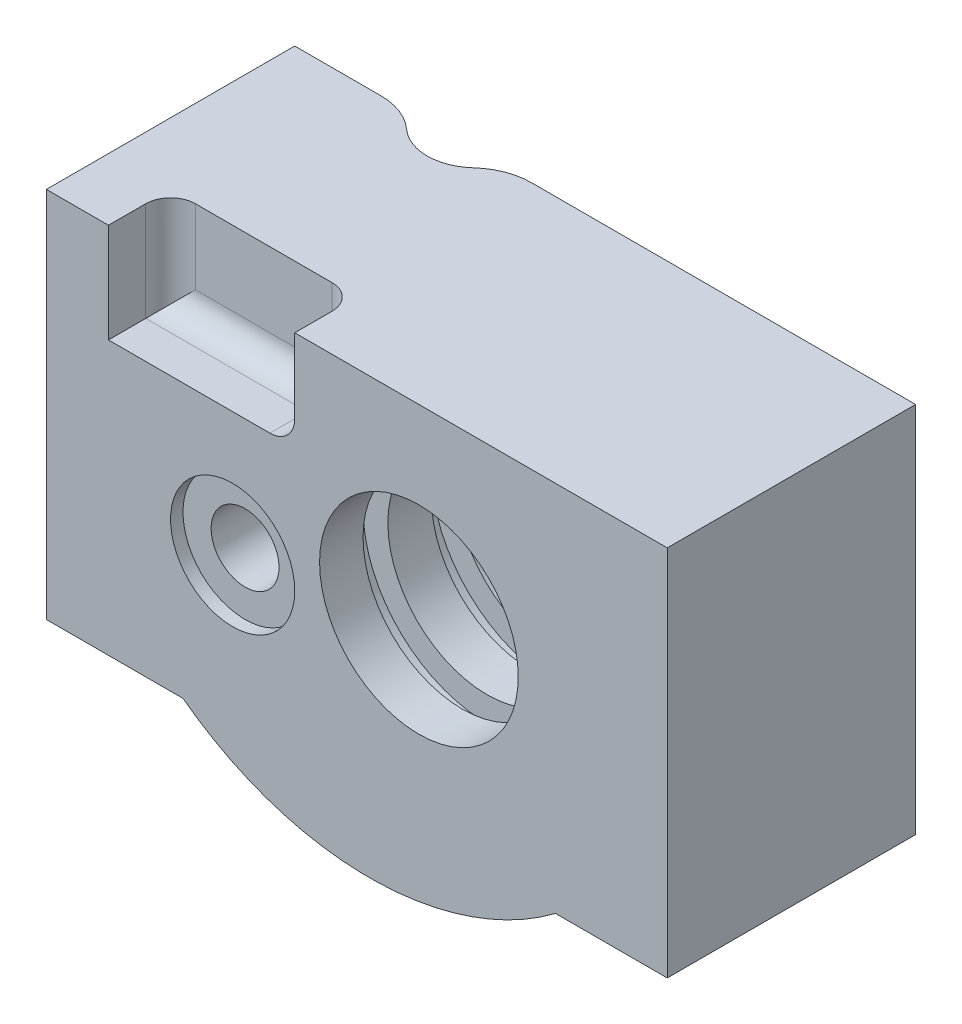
ISO-10303-21;
HEADER;
FILE_DESCRIPTION(('STEP AP214'),'2;1');
FILE_NAME('part.step','',(''),(''),'','','');
FILE_SCHEMA(('AUTOMOTIVE_DESIGN { 1 0 10303 214 1 1 1 1 }'));
ENDSEC;
DATA;
#1=APPLICATION_CONTEXT('core data for automotive mechanical design processes');
#2=APPLICATION_PROTOCOL_DEFINITION('international standard','automotive_design',2000,#1);
#3=PRODUCT_CONTEXT('',#1,'mechanical');
#4=PRODUCT('Part','Part','',(#3));
#5=PRODUCT_RELATED_PRODUCT_CATEGORY('part','',(#4));
#6=PRODUCT_DEFINITION_FORMATION('','',#4);
#7=PRODUCT_DEFINITION_CONTEXT('part definition',#1,'design');
#8=PRODUCT_DEFINITION('design','',#6,#7);
#9=PRODUCT_DEFINITION_SHAPE('','',#8);
#10=(LENGTH_UNIT() NAMED_UNIT(*) SI_UNIT(.MILLI.,.METRE.));
#11=(NAMED_UNIT(*) PLANE_ANGLE_UNIT() SI_UNIT($,.RADIAN.));
#12=(NAMED_UNIT(*) SI_UNIT($,.STERADIAN.) SOLID_ANGLE_UNIT());
#13=UNCERTAINTY_MEASURE_WITH_UNIT(LENGTH_MEASURE(1.E-05),#10,'distance_accuracy_value','');
#14=(GEOMETRIC_REPRESENTATION_CONTEXT(3) GLOBAL_UNCERTAINTY_ASSIGNED_CONTEXT((#13)) GLOBAL_UNIT_ASSIGNED_CONTEXT((#10,
#11,#12)) REPRESENTATION_CONTEXT('',''));
#15=CARTESIAN_POINT('',(0.,0.,0.));
#16=DIRECTION('',(0.,0.,1.));
#17=DIRECTION('',(1.,0.,0.));
#18=AXIS2_PLACEMENT_3D('',#15,#16,#17);
#19=CARTESIAN_POINT('',(0.,0.,0.));
#20=DIRECTION('',(0.,0.,-1.));
#21=DIRECTION('',(-1.,0.,0.));
#22=AXIS2_PLACEMENT_3D('',#19,#20,#21);
#23=CYLINDRICAL_SURFACE('',#22,10.);
#24=CARTESIAN_POINT('',(0.,0.,14.5));
#25=DIRECTION('',(0.,0.,-1.));
#26=DIRECTION('',(-1.,0.,0.));
#27=AXIS2_PLACEMENT_3D('',#24,#25,#26);
#28=CIRCLE('',#27,10.);
#29=CARTESIAN_POINT('',(-10.,0.,14.5));
#30=VERTEX_POINT('',#29);
#31=EDGE_CURVE('E571',#30,#30,#28,.T.);
#32=ORIENTED_EDGE('',*,*,#31,.T.);
#33=EDGE_LOOP('',(#32));
#34=FACE_BOUND('',#33,.T.);
#35=CARTESIAN_POINT('',(0.,0.,16.5));
#36=DIRECTION('',(0.,0.,-1.));
#37=DIRECTION('',(-1.,0.,0.));
#38=AXIS2_PLACEMENT_3D('',#35,#36,#37);
#39=CIRCLE('',#38,10.);
#40=CARTESIAN_POINT('',(-10.,0.,16.5));
#41=VERTEX_POINT('',#40);
#42=EDGE_CURVE('E570',#41,#41,#39,.T.);
#43=ORIENTED_EDGE('',*,*,#42,.F.);
#44=EDGE_LOOP('',(#43));
#45=FACE_BOUND('',#44,.T.);
#46=CARTESIAN_POINT('',(0.,0.,16.));
#47=DIRECTION('',(0.,0.,-1.));
#48=DIRECTION('',(-1.,0.,0.));
#49=AXIS2_PLACEMENT_3D('',#46,#47,#48);
#50=CIRCLE('',#49,10.);
#51=CARTESIAN_POINT('',(3.65612152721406,9.30767293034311,16.));
#52=VERTEX_POINT('',#51);
#53=CARTESIAN_POINT('',(-3.65612152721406,9.30767293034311,16.));
#54=VERTEX_POINT('',#53);
#55=EDGE_CURVE('E681',#52,#54,#50,.F.);
#56=ORIENTED_EDGE('',*,*,#55,.F.);
#57=DIRECTION('',(0.,0.,-1.));
#58=VECTOR('',#57,1.);
#59=CARTESIAN_POINT('',(3.65612152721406,9.30767293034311,0.));
#60=LINE('',#59,#58);
#61=CARTESIAN_POINT('',(3.65612152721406,9.30767293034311,15.));
#62=VERTEX_POINT('',#61);
#63=EDGE_CURVE('E678',#62,#52,#60,.F.);
#64=ORIENTED_EDGE('',*,*,#63,.F.);
#65=CARTESIAN_POINT('',(0.,0.,15.));
#66=DIRECTION('',(0.,0.,1.));
#67=DIRECTION('',(1.,0.,0.));
#68=AXIS2_PLACEMENT_3D('',#65,#66,#67);
#69=CIRCLE('',#68,10.);
#70=CARTESIAN_POINT('',(-3.65612152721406,9.30767293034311,15.));
#71=VERTEX_POINT('',#70);
#72=EDGE_CURVE('E671',#71,#62,#69,.F.);
#73=ORIENTED_EDGE('',*,*,#72,.F.);
#74=DIRECTION('',(0.,0.,-1.));
#75=VECTOR('',#74,1.);
#76=CARTESIAN_POINT('',(-3.65612152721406,9.30767293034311,0.));
#77=LINE('',#76,#75);
#78=EDGE_CURVE('E673',#54,#71,#77,.T.);
#79=ORIENTED_EDGE('',*,*,#78,.F.);
#80=EDGE_LOOP('',(#56,#64,#73,#79));
#81=FACE_BOUND('',#80,.T.);
#82=ADVANCED_FACE('F37',(#34,#45,#81),#23,.F.);
#83=CARTESIAN_POINT('',(-4.,5.,0.));
#84=DIRECTION('',(0.,0.,1.));
#85=DIRECTION('',(1.,0.,0.));
#86=AXIS2_PLACEMENT_3D('',#83,#84,#85);
#87=PLANE('',#86);
#88=CARTESIAN_POINT('',(0.,0.,0.));
#89=DIRECTION('',(0.,0.,-1.));
#90=DIRECTION('',(-1.,0.,0.));
#91=AXIS2_PLACEMENT_3D('',#88,#89,#90);
#92=CIRCLE('',#91,8.);
#93=CARTESIAN_POINT('',(-8.,0.,0.));
#94=VERTEX_POINT('',#93);
#95=EDGE_CURVE('E731',#94,#94,#92,.T.);
#96=ORIENTED_EDGE('',*,*,#95,.F.);
#97=EDGE_LOOP('',(#96));
#98=FACE_BOUND('',#97,.T.);
#99=CARTESIAN_POINT('',(-4.,5.,0.));
#100=DIRECTION('',(0.,0.,1.));
#101=DIRECTION('',(1.,0.,0.));
#102=AXIS2_PLACEMENT_3D('',#99,#100,#101);
#103=CIRCLE('',#102,25.);
#104=CARTESIAN_POINT('',(-10.9468960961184,-19.0154249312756,0.));
#105=VERTEX_POINT('',#104);
#106=CARTESIAN_POINT('',(11.,-15.,0.));
#107=VERTEX_POINT('',#106);
#108=EDGE_CURVE('E620',#105,#107,#103,.T.);
#109=ORIENTED_EDGE('',*,*,#108,.F.);
#110=DIRECTION('',(0.,1.,0.));
#111=VECTOR('',#110,1.);
#112=CARTESIAN_POINT('',(-10.9468960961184,5.,0.));
#113=LINE('',#112,#111);
#114=CARTESIAN_POINT('',(-10.9468960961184,15.,0.));
#115=VERTEX_POINT('',#114);
#116=EDGE_CURVE('E598',#105,#115,#113,.T.);
#117=ORIENTED_EDGE('',*,*,#116,.T.);
#118=DIRECTION('',(-1.,0.,0.));
#119=VECTOR('',#118,1.);
#120=CARTESIAN_POINT('',(-30.,15.,0.));
#121=LINE('',#120,#119);
#122=CARTESIAN_POINT('',(20.,15.,0.));
#123=VERTEX_POINT('',#122);
#124=EDGE_CURVE('E615',#123,#115,#121,.T.);
#125=ORIENTED_EDGE('',*,*,#124,.F.);
#126=DIRECTION('',(0.,1.,0.));
#127=VECTOR('',#126,1.);
#128=CARTESIAN_POINT('',(20.,15.,0.));
#129=LINE('',#128,#127);
#130=CARTESIAN_POINT('',(20.,-15.,0.));
#131=VERTEX_POINT('',#130);
#132=EDGE_CURVE('E624',#131,#123,#129,.T.);
#133=ORIENTED_EDGE('',*,*,#132,.F.);
#134=DIRECTION('',(1.,0.,0.));
#135=VECTOR('',#134,1.);
#136=CARTESIAN_POINT('',(11.,-15.,0.));
#137=LINE('',#136,#135);
#138=EDGE_CURVE('E621',#107,#131,#137,.T.);
#139=ORIENTED_EDGE('',*,*,#138,.F.);
#140=EDGE_LOOP('',(#109,#117,#125,#133,#139));
#141=FACE_BOUND('',#140,.T.);
#142=ADVANCED_FACE('F540',(#98,#141),#87,.F.);
#143=CARTESIAN_POINT('',(-30.,15.,20.));
#144=DIRECTION('',(1.,0.,0.));
#145=DIRECTION('',(0.,1.,0.));
#146=AXIS2_PLACEMENT_3D('',#143,#144,#145);
#147=PLANE('',#146);
#148=DIRECTION('',(0.,-1.,0.));
#149=VECTOR('',#148,1.);
#150=CARTESIAN_POINT('',(-30.,15.,0.));
#151=LINE('',#150,#149);
#152=CARTESIAN_POINT('',(-30.,15.,0.));
#153=VERTEX_POINT('',#152);
#154=CARTESIAN_POINT('',(-30.,-15.,0.));
#155=VERTEX_POINT('',#154);
#156=EDGE_CURVE('E234',#153,#155,#151,.T.);
#157=ORIENTED_EDGE('',*,*,#156,.T.);
#158=DIRECTION('',(0.,0.,-1.));
#159=VECTOR('',#158,1.);
#160=CARTESIAN_POINT('',(-30.,-15.,20.));
#161=LINE('',#160,#159);
#162=CARTESIAN_POINT('',(-30.,-15.,20.));
#163=VERTEX_POINT('',#162);
#164=EDGE_CURVE('E594',#163,#155,#161,.T.);
#165=ORIENTED_EDGE('',*,*,#164,.F.);
#166=DIRECTION('',(0.,-1.,0.));
#167=VECTOR('',#166,1.);
#168=CARTESIAN_POINT('',(-30.,15.,20.));
#169=LINE('',#168,#167);
#170=CARTESIAN_POINT('',(-30.,15.,20.));
#171=VERTEX_POINT('',#170);
#172=EDGE_CURVE('E237',#171,#163,#169,.T.);
#173=ORIENTED_EDGE('',*,*,#172,.F.);
#174=DIRECTION('',(0.,0.,-1.));
#175=VECTOR('',#174,1.);
#176=CARTESIAN_POINT('',(-30.,15.,20.));
#177=LINE('',#176,#175);
#178=EDGE_CURVE('E632',#171,#153,#177,.T.);
#179=ORIENTED_EDGE('',*,*,#178,.T.);
#180=EDGE_LOOP('',(#157,#165,#173,#179));
#181=FACE_BOUND('',#180,.T.);
#182=ADVANCED_FACE('F546',(#181),#147,.F.);
#183=CARTESIAN_POINT('',(-30.,-15.,20.));
#184=DIRECTION('',(0.,1.,0.));
#185=DIRECTION('',(0.,0.,1.));
#186=AXIS2_PLACEMENT_3D('',#183,#184,#185);
#187=PLANE('',#186);
#188=DIRECTION('',(1.,0.,0.));
#189=VECTOR('',#188,1.);
#190=CARTESIAN_POINT('',(-30.,-15.,0.));
#191=LINE('',#190,#189);
#192=CARTESIAN_POINT('',(-23.0531039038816,-15.,0.));
#193=VERTEX_POINT('',#192);
#194=EDGE_CURVE('E622',#155,#193,#191,.T.);
#195=ORIENTED_EDGE('',*,*,#194,.T.);
#196=CARTESIAN_POINT('',(-23.0531039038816,-15.,5.));
#197=DIRECTION('',(0.,1.,0.));
#198=DIRECTION('',(0.,0.,1.));
#199=AXIS2_PLACEMENT_3D('',#196,#197,#198);
#200=CIRCLE('',#199,5.);
#201=CARTESIAN_POINT('',(-19.6902684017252,-15.,1.29981927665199));
#202=VERTEX_POINT('',#201);
#203=EDGE_CURVE('E590',#193,#202,#200,.F.);
#204=ORIENTED_EDGE('',*,*,#203,.T.);
#205=CARTESIAN_POINT('',(-17.,-15.,-1.66032530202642));
#206=DIRECTION('',(0.,1.,0.));
#207=DIRECTION('',(0.,0.,1.));
#208=AXIS2_PLACEMENT_3D('',#205,#206,#207);
#209=CIRCLE('',#208,4.);
#210=CARTESIAN_POINT('',(-19.,-15.,1.80377631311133));
#211=VERTEX_POINT('',#210);
#212=EDGE_CURVE('E235',#202,#211,#209,.T.);
#213=ORIENTED_EDGE('',*,*,#212,.T.);
#214=DIRECTION('',(0.,0.,-1.));
#215=VECTOR('',#214,1.);
#216=CARTESIAN_POINT('',(-19.,-15.,20.));
#217=LINE('',#216,#215);
#218=CARTESIAN_POINT('',(-19.,-15.,20.));
#219=VERTEX_POINT('',#218);
#220=EDGE_CURVE('E587',#219,#211,#217,.T.);
#221=ORIENTED_EDGE('',*,*,#220,.F.);
#222=DIRECTION('',(1.,0.,0.));
#223=VECTOR('',#222,1.);
#224=CARTESIAN_POINT('',(-30.,-15.,20.));
#225=LINE('',#224,#223);
#226=EDGE_CURVE('E651',#163,#219,#225,.T.);
#227=ORIENTED_EDGE('',*,*,#226,.F.);
#228=ORIENTED_EDGE('',*,*,#164,.T.);
#229=EDGE_LOOP('',(#195,#204,#213,#221,#227,#228));
#230=FACE_BOUND('',#229,.T.);
#231=ADVANCED_FACE('F222',(#230),#187,.F.);
#232=CARTESIAN_POINT('',(-4.,5.,20.));
#233=DIRECTION('',(0.,0.,-1.));
#234=DIRECTION('',(-1.,0.,0.));
#235=AXIS2_PLACEMENT_3D('',#232,#233,#234);
#236=CYLINDRICAL_SURFACE('',#235,25.);
#237=CARTESIAN_POINT('',(-19.,-15.,1.80377631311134));
#238=CARTESIAN_POINT('',(-18.8766514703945,-15.092531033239,1.87496960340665));
#239=CARTESIAN_POINT('',(-18.7499284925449,-15.1857713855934,1.93937151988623));
#240=CARTESIAN_POINT('',(-18.4905979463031,-15.3727248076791,2.05427814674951));
#241=CARTESIAN_POINT('',(-18.3579886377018,-15.4664380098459,2.10477871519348));
#242=CARTESIAN_POINT('',(-18.0871607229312,-15.6537939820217,2.191738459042));
#243=CARTESIAN_POINT('',(-17.9489177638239,-15.7474341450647,2.22812744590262));
#244=CARTESIAN_POINT('',(-17.6684245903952,-15.9332856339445,2.28602914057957));
#245=CARTESIAN_POINT('',(-17.5261748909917,-16.0254971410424,2.30754375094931));
#246=CARTESIAN_POINT('',(-17.2473858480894,-16.2021780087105,2.33432278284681));
#247=CARTESIAN_POINT('',(-17.1110167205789,-16.2867797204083,2.3404856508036));
#248=CARTESIAN_POINT('',(-16.836738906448,-16.4532948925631,2.33869315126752));
#249=CARTESIAN_POINT('',(-16.6988303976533,-16.5352086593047,2.33073939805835));
#250=CARTESIAN_POINT('',(-16.4229333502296,-16.6955325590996,2.30025769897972));
#251=CARTESIAN_POINT('',(-16.2849454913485,-16.7739492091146,2.27775818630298));
#252=CARTESIAN_POINT('',(-16.010012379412,-16.926794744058,2.21778154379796));
#253=CARTESIAN_POINT('',(-15.873066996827,-17.0012241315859,2.18030630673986));
#254=CARTESIAN_POINT('',(-15.6141808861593,-17.1388866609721,2.09418933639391));
#255=CARTESIAN_POINT('',(-15.4920111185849,-17.202521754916,2.0468783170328));
#256=CARTESIAN_POINT('',(-15.2511730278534,-17.3255320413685,1.93953276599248));
#257=CARTESIAN_POINT('',(-15.1325040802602,-17.3849079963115,1.87950051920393));
#258=CARTESIAN_POINT('',(-14.9000796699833,-17.4990006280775,1.74676245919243));
#259=CARTESIAN_POINT('',(-14.7863247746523,-17.5537167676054,1.67405518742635));
#260=CARTESIAN_POINT('',(-14.5652885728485,-17.6581025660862,1.5162466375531));
#261=CARTESIAN_POINT('',(-14.4580058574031,-17.7077733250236,1.43114807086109));
#262=CARTESIAN_POINT('',(-14.2657805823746,-17.7952476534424,1.26168046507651));
#263=CARTESIAN_POINT('',(-14.1798010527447,-17.8337422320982,1.1788403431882));
#264=CARTESIAN_POINT('',(-14.0148134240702,-17.9065851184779,1.00482544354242));
#265=CARTESIAN_POINT('',(-13.9358040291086,-17.9409341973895,0.913652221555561));
#266=CARTESIAN_POINT('',(-13.7859206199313,-18.0052688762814,0.72384790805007));
#267=CARTESIAN_POINT('',(-13.7150254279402,-18.0352658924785,0.625237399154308));
#268=CARTESIAN_POINT('',(-13.5820659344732,-18.0908900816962,0.421149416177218));
#269=CARTESIAN_POINT('',(-13.519994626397,-18.1165207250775,0.315677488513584));
#270=CARTESIAN_POINT('',(-13.4447966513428,-18.1472717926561,0.173253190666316));
#271=CARTESIAN_POINT('',(-13.4273235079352,-18.1543928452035,0.138971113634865));
#272=CARTESIAN_POINT('',(-13.3933587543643,-18.1681925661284,0.0698820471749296));
#273=CARTESIAN_POINT('',(-13.3768661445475,-18.1748716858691,0.035075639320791));
#274=CARTESIAN_POINT('',(-13.3608627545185,-18.1813340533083,0.));
#275=B_SPLINE_CURVE_WITH_KNOTS('',3,(#237,#238,#239,#240,#241,#242,#243,#244,#245,#246,#247,
#248,#249,#250,#251,#252,#253,#254,#255,#256,#257,#258,#259,#260,#261,#262,#263,#264,#265,#266,
#267,#268,#269,#270,#271,#272,#273,#274),.UNSPECIFIED.,.F.,.F.,(4,2,2,2,2,2,2,2,2,2,2,2,2,2,2,2,
2,2,4),(0.,0.509334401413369,1.01882039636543,1.53080894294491,2.04273198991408,
2.52390640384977,3.00502579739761,3.48520755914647,3.96532865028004,4.40164585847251,
4.83788476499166,5.27417390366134,5.71036771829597,6.08619501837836,6.46195229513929,
6.83670534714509,7.21115914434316,7.32854097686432,7.44580101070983),.UNSPECIFIED.);
#276=CARTESIAN_POINT('',(-14.3097315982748,-17.7751933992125,1.299819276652));
#277=VERTEX_POINT('',#276);
#278=EDGE_CURVE('E227',#211,#277,#275,.T.);
#279=ORIENTED_EDGE('',*,*,#278,.T.);
#280=CARTESIAN_POINT('',(-14.3097315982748,-17.7751933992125,1.29981927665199));
#281=CARTESIAN_POINT('',(-14.1978751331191,-17.8258366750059,1.19815632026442));
#282=CARTESIAN_POINT('',(-14.0816547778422,-17.8774454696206,1.10179760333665));
#283=CARTESIAN_POINT('',(-13.8413583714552,-17.9818343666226,0.920201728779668));
#284=CARTESIAN_POINT('',(-13.7172839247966,-18.0346142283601,0.834962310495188));
#285=CARTESIAN_POINT('',(-13.4657670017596,-18.1390857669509,0.678356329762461));
#286=CARTESIAN_POINT('',(-13.338523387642,-18.1907652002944,0.606661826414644));
#287=CARTESIAN_POINT('',(-13.0781893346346,-18.2939063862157,0.474639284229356));
#288=CARTESIAN_POINT('',(-12.9450989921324,-18.3453681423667,0.414311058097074));
#289=CARTESIAN_POINT('',(-12.6652657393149,-18.4507335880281,0.301984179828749));
#290=CARTESIAN_POINT('',(-12.5181924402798,-18.5045849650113,0.250757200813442));
#291=CARTESIAN_POINT('',(-12.2193957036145,-18.6107325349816,0.162125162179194));
#292=CARTESIAN_POINT('',(-12.0676723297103,-18.6630287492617,0.12471991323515));
#293=CARTESIAN_POINT('',(-11.7558575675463,-18.7670874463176,0.0632397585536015));
#294=CARTESIAN_POINT('',(-11.5956530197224,-18.8187815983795,0.0396203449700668));
#295=CARTESIAN_POINT('',(-11.2727716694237,-18.9193577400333,0.00798840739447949));
#296=CARTESIAN_POINT('',(-11.1100938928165,-18.9682385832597,-1.77976235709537E-05));
#297=CARTESIAN_POINT('',(-10.9468960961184,-19.0154249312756,0.));
#298=B_SPLINE_CURVE_WITH_KNOTS('',3,(#280,#281,#282,#283,#284,#285,#286,#287,#288,#289,#290,
#291,#292,#293,#294,#295,#296,#297),.UNSPECIFIED.,.F.,.F.,(4,2,2,2,2,2,2,2,4),(0.,
0.478065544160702,0.956033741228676,1.42028420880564,1.8845270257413,2.37823435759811,
2.87193492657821,3.381138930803,3.89054897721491),.UNSPECIFIED.);
#299=EDGE_CURVE('E198',#277,#105,#298,.T.);
#300=ORIENTED_EDGE('',*,*,#299,.T.);
#301=ORIENTED_EDGE('',*,*,#108,.T.);
#302=DIRECTION('',(0.,0.,-1.));
#303=VECTOR('',#302,1.);
#304=CARTESIAN_POINT('',(11.,-15.,20.));
#305=LINE('',#304,#303);
#306=CARTESIAN_POINT('',(11.,-15.,20.));
#307=VERTEX_POINT('',#306);
#308=EDGE_CURVE('E595',#307,#107,#305,.T.);
#309=ORIENTED_EDGE('',*,*,#308,.F.);
#310=CARTESIAN_POINT('',(-4.,5.,20.));
#311=DIRECTION('',(0.,0.,1.));
#312=DIRECTION('',(1.,0.,0.));
#313=AXIS2_PLACEMENT_3D('',#310,#311,#312);
#314=CIRCLE('',#313,25.);
#315=EDGE_CURVE('E593',#219,#307,#314,.T.);
#316=ORIENTED_EDGE('',*,*,#315,.F.);
#317=ORIENTED_EDGE('',*,*,#220,.T.);
#318=EDGE_LOOP('',(#279,#300,#301,#309,#316,#317));
#319=FACE_BOUND('',#318,.T.);
#320=ADVANCED_FACE('F216',(#319),#236,.T.);
#321=CARTESIAN_POINT('',(11.,-15.,20.));
#322=DIRECTION('',(0.,1.,0.));
#323=DIRECTION('',(0.,0.,1.));
#324=AXIS2_PLACEMENT_3D('',#321,#322,#323);
#325=PLANE('',#324);
#326=ORIENTED_EDGE('',*,*,#138,.T.);
#327=DIRECTION('',(0.,0.,-1.));
#328=VECTOR('',#327,1.);
#329=CARTESIAN_POINT('',(20.,-15.,20.));
#330=LINE('',#329,#328);
#331=CARTESIAN_POINT('',(20.,-15.,20.));
#332=VERTEX_POINT('',#331);
#333=EDGE_CURVE('E601',#332,#131,#330,.T.);
#334=ORIENTED_EDGE('',*,*,#333,.F.);
#335=DIRECTION('',(1.,0.,0.));
#336=VECTOR('',#335,1.);
#337=CARTESIAN_POINT('',(11.,-15.,20.));
#338=LINE('',#337,#336);
#339=EDGE_CURVE('E646',#307,#332,#338,.T.);
#340=ORIENTED_EDGE('',*,*,#339,.F.);
#341=ORIENTED_EDGE('',*,*,#308,.T.);
#342=EDGE_LOOP('',(#326,#334,#340,#341));
#343=FACE_BOUND('',#342,.T.);
#344=ADVANCED_FACE('F221',(#343),#325,.F.);
#345=CARTESIAN_POINT('',(20.,15.,20.));
#346=DIRECTION('',(-1.,0.,0.));
#347=DIRECTION('',(0.,-1.,0.));
#348=AXIS2_PLACEMENT_3D('',#345,#346,#347);
#349=PLANE('',#348);
#350=ORIENTED_EDGE('',*,*,#132,.T.);
#351=DIRECTION('',(0.,0.,-1.));
#352=VECTOR('',#351,1.);
#353=CARTESIAN_POINT('',(20.,15.,20.));
#354=LINE('',#353,#352);
#355=CARTESIAN_POINT('',(20.,15.,20.));
#356=VERTEX_POINT('',#355);
#357=EDGE_CURVE('E635',#356,#123,#354,.T.);
#358=ORIENTED_EDGE('',*,*,#357,.F.);
#359=DIRECTION('',(0.,1.,0.));
#360=VECTOR('',#359,1.);
#361=CARTESIAN_POINT('',(20.,15.,20.));
#362=LINE('',#361,#360);
#363=EDGE_CURVE('E643',#332,#356,#362,.T.);
#364=ORIENTED_EDGE('',*,*,#363,.F.);
#365=ORIENTED_EDGE('',*,*,#333,.T.);
#366=EDGE_LOOP('',(#350,#358,#364,#365));
#367=FACE_BOUND('',#366,.T.);
#368=ADVANCED_FACE('F641',(#367),#349,.F.);
#369=CARTESIAN_POINT('',(-30.,15.,20.));
#370=DIRECTION('',(0.,-1.,0.));
#371=DIRECTION('',(0.,0.,-1.));
#372=AXIS2_PLACEMENT_3D('',#369,#370,#371);
#373=PLANE('',#372);
#374=DIRECTION('',(-1.,0.,0.));
#375=VECTOR('',#374,1.);
#376=CARTESIAN_POINT('',(-30.,15.,20.));
#377=LINE('',#376,#375);
#378=CARTESIAN_POINT('',(-25.,15.,20.));
#379=VERTEX_POINT('',#378);
#380=EDGE_CURVE('E649',#379,#171,#377,.T.);
#381=ORIENTED_EDGE('',*,*,#380,.F.);
#382=DIRECTION('',(0.,0.,1.));
#383=VECTOR('',#382,1.);
#384=CARTESIAN_POINT('',(-25.,15.,15.));
#385=LINE('',#384,#383);
#386=CARTESIAN_POINT('',(-25.,15.,17.));
#387=VERTEX_POINT('',#386);
#388=EDGE_CURVE('E721',#387,#379,#385,.T.);
#389=ORIENTED_EDGE('',*,*,#388,.F.);
#390=CARTESIAN_POINT('',(-23.,15.,17.));
#391=DIRECTION('',(0.,-1.,0.));
#392=DIRECTION('',(0.,0.,-1.));
#393=AXIS2_PLACEMENT_3D('',#390,#391,#392);
#394=CIRCLE('',#393,2.);
#395=CARTESIAN_POINT('',(-23.,15.,15.));
#396=VERTEX_POINT('',#395);
#397=EDGE_CURVE('E702',#387,#396,#394,.T.);
#398=ORIENTED_EDGE('',*,*,#397,.T.);
#399=DIRECTION('',(-1.,0.,0.));
#400=VECTOR('',#399,1.);
#401=CARTESIAN_POINT('',(-25.,15.,15.));
#402=LINE('',#401,#400);
#403=CARTESIAN_POINT('',(-12.,15.,15.));
#404=VERTEX_POINT('',#403);
#405=EDGE_CURVE('E257',#404,#396,#402,.T.);
#406=ORIENTED_EDGE('',*,*,#405,.F.);
#407=CARTESIAN_POINT('',(-12.,15.,17.));
#408=DIRECTION('',(0.,-1.,0.));
#409=DIRECTION('',(0.,0.,-1.));
#410=AXIS2_PLACEMENT_3D('',#407,#408,#409);
#411=CIRCLE('',#410,2.);
#412=CARTESIAN_POINT('',(-10.,15.,17.));
#413=VERTEX_POINT('',#412);
#414=EDGE_CURVE('E183',#404,#413,#411,.T.);
#415=ORIENTED_EDGE('',*,*,#414,.T.);
#416=DIRECTION('',(0.,0.,1.));
#417=VECTOR('',#416,1.);
#418=CARTESIAN_POINT('',(-10.,15.,15.));
#419=LINE('',#418,#417);
#420=CARTESIAN_POINT('',(-10.,15.,20.));
#421=VERTEX_POINT('',#420);
#422=EDGE_CURVE('E724',#413,#421,#419,.T.);
#423=ORIENTED_EDGE('',*,*,#422,.T.);
#424=EDGE_CURVE('E636',#356,#421,#377,.T.);
#425=ORIENTED_EDGE('',*,*,#424,.F.);
#426=ORIENTED_EDGE('',*,*,#357,.T.);
#427=ORIENTED_EDGE('',*,*,#124,.T.);
#428=CARTESIAN_POINT('',(-10.9468960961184,15.,5.));
#429=DIRECTION('',(0.,-1.,0.));
#430=DIRECTION('',(0.,0.,-1.));
#431=AXIS2_PLACEMENT_3D('',#428,#429,#430);
#432=CIRCLE('',#431,5.);
#433=CARTESIAN_POINT('',(-14.3097315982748,15.,1.29981927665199));
#434=VERTEX_POINT('',#433);
#435=EDGE_CURVE('E201',#115,#434,#432,.F.);
#436=ORIENTED_EDGE('',*,*,#435,.T.);
#437=CARTESIAN_POINT('',(-17.,15.,-1.66032530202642));
#438=DIRECTION('',(0.,1.,0.));
#439=DIRECTION('',(0.,0.,1.));
#440=AXIS2_PLACEMENT_3D('',#437,#438,#439);
#441=CIRCLE('',#440,4.);
#442=CARTESIAN_POINT('',(-19.6902684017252,15.,1.29981927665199));
#443=VERTEX_POINT('',#442);
#444=EDGE_CURVE('E580',#443,#434,#441,.T.);
#445=ORIENTED_EDGE('',*,*,#444,.F.);
#446=CARTESIAN_POINT('',(-23.0531039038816,15.,5.));
#447=DIRECTION('',(0.,-1.,0.));
#448=DIRECTION('',(0.,0.,-1.));
#449=AXIS2_PLACEMENT_3D('',#446,#447,#448);
#450=CIRCLE('',#449,5.);
#451=CARTESIAN_POINT('',(-23.0531039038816,15.,0.));
#452=VERTEX_POINT('',#451);
#453=EDGE_CURVE('E607',#443,#452,#450,.F.);
#454=ORIENTED_EDGE('',*,*,#453,.T.);
#455=EDGE_CURVE('E630',#452,#153,#121,.T.);
#456=ORIENTED_EDGE('',*,*,#455,.T.);
#457=ORIENTED_EDGE('',*,*,#178,.F.);
#458=EDGE_LOOP('',(#381,#389,#398,#406,#415,#423,#425,#426,#427,#436,#445,#454,#456,#457));
#459=FACE_BOUND('',#458,.T.);
#460=ADVANCED_FACE('F611',(#459),#373,.F.);
#461=CARTESIAN_POINT('',(-4.,5.,20.));
#462=DIRECTION('',(0.,0.,1.));
#463=DIRECTION('',(1.,0.,0.));
#464=AXIS2_PLACEMENT_3D('',#461,#462,#463);
#465=PLANE('',#464);
#466=CARTESIAN_POINT('',(-15.,-3.,20.));
#467=DIRECTION('',(0.,0.,1.));
#468=DIRECTION('',(1.,0.,0.));
#469=AXIS2_PLACEMENT_3D('',#466,#467,#468);
#470=CIRCLE('',#469,5.);
#471=CARTESIAN_POINT('',(-10.,-3.,20.));
#472=VERTEX_POINT('',#471);
#473=EDGE_CURVE('E255',#472,#472,#470,.T.);
#474=ORIENTED_EDGE('',*,*,#473,.F.);
#475=EDGE_LOOP('',(#474));
#476=FACE_BOUND('',#475,.T.);
#477=DIRECTION('',(1.,0.,0.));
#478=VECTOR('',#477,1.);
#479=CARTESIAN_POINT('',(-25.,7.,20.));
#480=LINE('',#479,#478);
#481=CARTESIAN_POINT('',(-25.,7.,20.));
#482=VERTEX_POINT('',#481);
#483=CARTESIAN_POINT('',(-12.,7.,20.));
#484=VERTEX_POINT('',#483);
#485=EDGE_CURVE('E713',#482,#484,#480,.T.);
#486=ORIENTED_EDGE('',*,*,#485,.F.);
#487=DIRECTION('',(0.,-1.,0.));
#488=VECTOR('',#487,1.);
#489=CARTESIAN_POINT('',(-25.,15.,20.));
#490=LINE('',#489,#488);
#491=EDGE_CURVE('E668',#379,#482,#490,.T.);
#492=ORIENTED_EDGE('',*,*,#491,.F.);
#493=ORIENTED_EDGE('',*,*,#380,.T.);
#494=ORIENTED_EDGE('',*,*,#172,.T.);
#495=ORIENTED_EDGE('',*,*,#226,.T.);
#496=ORIENTED_EDGE('',*,*,#315,.T.);
#497=ORIENTED_EDGE('',*,*,#339,.T.);
#498=ORIENTED_EDGE('',*,*,#363,.T.);
#499=ORIENTED_EDGE('',*,*,#424,.T.);
#500=DIRECTION('',(0.,1.,0.));
#501=VECTOR('',#500,1.);
#502=CARTESIAN_POINT('',(-10.,15.,20.));
#503=LINE('',#502,#501);
#504=CARTESIAN_POINT('',(-10.,9.,20.));
#505=VERTEX_POINT('',#504);
#506=EDGE_CURVE('E716',#505,#421,#503,.T.);
#507=ORIENTED_EDGE('',*,*,#506,.F.);
#508=CARTESIAN_POINT('',(-12.,9.,20.));
#509=DIRECTION('',(0.,0.,1.));
#510=DIRECTION('',(1.,0.,0.));
#511=AXIS2_PLACEMENT_3D('',#508,#509,#510);
#512=CIRCLE('',#511,2.);
#513=EDGE_CURVE('E699',#505,#484,#512,.F.);
#514=ORIENTED_EDGE('',*,*,#513,.T.);
#515=EDGE_LOOP('',(#486,#492,#493,#494,#495,#496,#497,#498,#499,#507,#514));
#516=FACE_BOUND('',#515,.T.);
#517=CARTESIAN_POINT('',(0.,0.,20.));
#518=DIRECTION('',(0.,0.,-1.));
#519=DIRECTION('',(-1.,0.,0.));
#520=AXIS2_PLACEMENT_3D('',#517,#518,#519);
#521=CIRCLE('',#520,8.);
#522=CARTESIAN_POINT('',(-8.,0.,20.));
#523=VERTEX_POINT('',#522);
#524=EDGE_CURVE('E573',#523,#523,#521,.T.);
#525=ORIENTED_EDGE('',*,*,#524,.T.);
#526=EDGE_LOOP('',(#525));
#527=FACE_BOUND('',#526,.T.);
#528=ADVANCED_FACE('F246',(#476,#516,#527),#465,.T.);
#529=DIRECTION('',(0.,1.,0.));
#530=VECTOR('',#529,1.);
#531=CARTESIAN_POINT('',(-23.0531039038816,5.,0.));
#532=LINE('',#531,#530);
#533=EDGE_CURVE('E211',#452,#193,#532,.F.);
#534=ORIENTED_EDGE('',*,*,#533,.T.);
#535=ORIENTED_EDGE('',*,*,#194,.F.);
#536=ORIENTED_EDGE('',*,*,#156,.F.);
#537=ORIENTED_EDGE('',*,*,#455,.F.);
#538=EDGE_LOOP('',(#534,#535,#536,#537));
#539=FACE_BOUND('',#538,.T.);
#540=ADVANCED_FACE('F243',(#539),#87,.F.);
#541=CARTESIAN_POINT('',(-17.,-20.,-1.66032530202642));
#542=DIRECTION('',(0.,1.,0.));
#543=DIRECTION('',(0.,0.,1.));
#544=AXIS2_PLACEMENT_3D('',#541,#542,#543);
#545=CYLINDRICAL_SURFACE('',#544,4.);
#546=DIRECTION('',(0.,1.,0.));
#547=VECTOR('',#546,1.);
#548=CARTESIAN_POINT('',(-14.3097315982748,-20.,1.29981927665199));
#549=LINE('',#548,#547);
#550=CARTESIAN_POINT('',(-14.3097315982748,-0.353846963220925,1.29981927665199));
#551=VERTEX_POINT('',#550);
#552=EDGE_CURVE('E191',#434,#551,#549,.F.);
#553=ORIENTED_EDGE('',*,*,#552,.T.);
#554=CARTESIAN_POINT('',(-14.3097315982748,-0.353846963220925,1.29981927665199));
#555=CARTESIAN_POINT('',(-14.3670238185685,-0.338899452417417,1.35189784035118));
#556=CARTESIAN_POINT('',(-14.4260795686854,-0.325484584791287,1.40252226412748));
#557=CARTESIAN_POINT('',(-14.5475407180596,-0.302278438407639,1.50061271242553));
#558=CARTESIAN_POINT('',(-14.6099497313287,-0.292491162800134,1.54807520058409));
#559=CARTESIAN_POINT('',(-14.7382636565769,-0.277079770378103,1.63979796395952));
#560=CARTESIAN_POINT('',(-14.8041901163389,-0.271485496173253,1.68403329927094));
#561=CARTESIAN_POINT('',(-14.9387163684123,-0.265155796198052,1.76858375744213));
#562=CARTESIAN_POINT('',(-15.0073152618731,-0.264418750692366,1.80890018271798));
#563=CARTESIAN_POINT('',(-15.1472146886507,-0.26836018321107,1.8856014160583));
#564=CARTESIAN_POINT('',(-15.218531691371,-0.273079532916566,1.92195429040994));
#565=CARTESIAN_POINT('',(-15.362683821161,-0.288485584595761,1.99009257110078));
#566=CARTESIAN_POINT('',(-15.4355187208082,-0.299171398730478,2.02187865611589));
#567=CARTESIAN_POINT('',(-15.581631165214,-0.326836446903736,2.08058365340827));
#568=CARTESIAN_POINT('',(-15.6549059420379,-0.343791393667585,2.10752076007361));
#569=CARTESIAN_POINT('',(-15.8012337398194,-0.384203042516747,2.1566011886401));
#570=CARTESIAN_POINT('',(-15.8742867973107,-0.407658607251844,2.17874534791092));
#571=CARTESIAN_POINT('',(-16.0719221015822,-0.480615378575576,2.23267052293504));
#572=CARTESIAN_POINT('',(-16.1954508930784,-0.536668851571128,2.2597931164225));
#573=CARTESIAN_POINT('',(-16.4343972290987,-0.667678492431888,2.30135074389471));
#574=CARTESIAN_POINT('',(-16.5498061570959,-0.742654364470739,2.31577248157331));
#575=CARTESIAN_POINT('',(-16.7652483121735,-0.907079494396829,2.33420169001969));
#576=CARTESIAN_POINT('',(-16.8656354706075,-0.996034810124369,2.33850470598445));
#577=CARTESIAN_POINT('',(-17.052307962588,-1.18767056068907,2.34042384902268));
#578=CARTESIAN_POINT('',(-17.138593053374,-1.29035123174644,2.33803986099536));
#579=CARTESIAN_POINT('',(-17.3018640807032,-1.51639719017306,2.32917815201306));
#580=CARTESIAN_POINT('',(-17.377423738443,-1.64078044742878,2.32236777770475));
#581=CARTESIAN_POINT('',(-17.5078867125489,-1.89992549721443,2.30784480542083));
#582=CARTESIAN_POINT('',(-17.5627823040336,-2.03469114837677,2.30013187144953));
#583=CARTESIAN_POINT('',(-17.653119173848,-2.31945723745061,2.28627724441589));
#584=CARTESIAN_POINT('',(-17.6872327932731,-2.46988767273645,2.28025402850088));
#585=CARTESIAN_POINT('',(-17.7297161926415,-2.7744344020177,2.27261145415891));
#586=CARTESIAN_POINT('',(-17.7380900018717,-2.92855011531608,2.27099140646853));
#587=CARTESIAN_POINT('',(-17.7288914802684,-3.23424374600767,2.27270573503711));
#588=CARTESIAN_POINT('',(-17.7116082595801,-3.38583076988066,2.27598490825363));
#589=CARTESIAN_POINT('',(-17.6521593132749,-3.68392755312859,2.28626611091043));
#590=CARTESIAN_POINT('',(-17.6099885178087,-3.8304362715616,2.29326889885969));
#591=CARTESIAN_POINT('',(-17.5018278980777,-4.11474201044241,2.30844530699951));
#592=CARTESIAN_POINT('',(-17.4357767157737,-4.25251550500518,2.31662191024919));
#593=CARTESIAN_POINT('',(-17.2815973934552,-4.5152935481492,2.33049846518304));
#594=CARTESIAN_POINT('',(-17.1934659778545,-4.64029619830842,2.33619804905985));
#595=CARTESIAN_POINT('',(-16.9968725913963,-4.87473564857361,2.34088673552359));
#596=CARTESIAN_POINT('',(-16.8882856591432,-4.984069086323,2.33983320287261));
#597=CARTESIAN_POINT('',(-16.6546900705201,-5.18266926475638,2.32645108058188));
#598=CARTESIAN_POINT('',(-16.5296931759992,-5.27195025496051,2.314130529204));
#599=CARTESIAN_POINT('',(-16.2779209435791,-5.42185541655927,2.27586437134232));
#600=CARTESIAN_POINT('',(-16.1519511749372,-5.48410322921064,2.2509864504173));
#601=CARTESIAN_POINT('',(-15.8954077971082,-5.58765255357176,2.18640349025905));
#602=CARTESIAN_POINT('',(-15.7648385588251,-5.62897340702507,2.14671220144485));
#603=CARTESIAN_POINT('',(-15.5132922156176,-5.6890003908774,2.05537025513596));
#604=CARTESIAN_POINT('',(-15.3922670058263,-5.70905410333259,2.00471723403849));
#605=CARTESIAN_POINT('',(-15.1543870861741,-5.73296343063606,1.89089172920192));
#606=CARTESIAN_POINT('',(-15.0375407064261,-5.73678830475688,1.82769572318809));
#607=CARTESIAN_POINT('',(-14.813734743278,-5.730594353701,1.69183596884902));
#608=CARTESIAN_POINT('',(-14.7066064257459,-5.72090162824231,1.61943224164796));
#609=CARTESIAN_POINT('',(-14.5525686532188,-5.69834871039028,1.50419421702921));
#610=CARTESIAN_POINT('',(-14.5024275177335,-5.68952157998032,1.46476339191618));
#611=CARTESIAN_POINT('',(-14.4043866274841,-5.66952032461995,1.38382079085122));
#612=CARTESIAN_POINT('',(-14.3564856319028,-5.65834751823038,1.34231019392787));
#613=CARTESIAN_POINT('',(-14.3097315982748,-5.64615303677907,1.29981927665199));
#614=B_SPLINE_CURVE_WITH_KNOTS('',3,(#554,#555,#556,#557,#558,#559,#560,#561,#562,#563,#564,
#565,#566,#567,#568,#569,#570,#571,#572,#573,#574,#575,#576,#577,#578,#579,#580,#581,#582,#583,
#584,#585,#586,#587,#588,#589,#590,#591,#592,#593,#594,#595,#596,#597,#598,#599,#600,#601,#602,
#603,#604,#605,#606,#607,#608,#609,#610,#611,#612,#613),.UNSPECIFIED.,.F.,.F.,(4,2,2,2,2,2,2,2,
2,2,2,2,2,2,2,2,2,2,2,2,2,2,2,2,2,2,2,2,2,4),(0.,0.236560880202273,0.473382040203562,
0.711873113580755,0.950284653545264,1.19049367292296,1.43066695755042,1.66991937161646,
1.90912995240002,2.32182800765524,2.73495759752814,3.13586206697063,3.53677343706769,
3.97196998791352,4.40732906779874,4.86818550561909,5.32896979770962,5.78460110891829,
6.24032526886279,6.69722878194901,7.15420011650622,7.61405933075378,8.07359072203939,
8.49935592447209,8.92472689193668,9.32115139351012,9.71832646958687,10.106084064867,
10.2991756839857,10.4921590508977),.UNSPECIFIED.);
#615=CARTESIAN_POINT('',(-14.3097315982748,-5.64615303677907,1.29981927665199));
#616=VERTEX_POINT('',#615);
#617=EDGE_CURVE('E178',#551,#616,#614,.T.);
#618=ORIENTED_EDGE('',*,*,#617,.T.);
#619=EDGE_CURVE('E188',#616,#277,#549,.F.);
#620=ORIENTED_EDGE('',*,*,#619,.T.);
#621=ORIENTED_EDGE('',*,*,#278,.F.);
#622=ORIENTED_EDGE('',*,*,#212,.F.);
#623=DIRECTION('',(0.,1.,0.));
#624=VECTOR('',#623,1.);
#625=CARTESIAN_POINT('',(-19.6902684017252,-20.,1.29981927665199));
#626=LINE('',#625,#624);
#627=EDGE_CURVE('E199',#202,#443,#626,.T.);
#628=ORIENTED_EDGE('',*,*,#627,.T.);
#629=ORIENTED_EDGE('',*,*,#444,.T.);
#630=EDGE_LOOP('',(#553,#618,#620,#621,#622,#628,#629));
#631=FACE_BOUND('',#630,.T.);
#632=ADVANCED_FACE('F186',(#631),#545,.F.);
#633=CARTESIAN_POINT('',(-10.9468960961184,-20.,5.));
#634=DIRECTION('',(0.,1.,0.));
#635=DIRECTION('',(0.,0.,1.));
#636=AXIS2_PLACEMENT_3D('',#633,#634,#635);
#637=CYLINDRICAL_SURFACE('',#636,5.);
#638=CARTESIAN_POINT('',(-14.3097315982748,-0.353846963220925,1.29981927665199));
#639=CARTESIAN_POINT('',(-14.2525353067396,-0.368760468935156,1.24781669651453));
#640=CARTESIAN_POINT('',(-14.1944120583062,-0.385909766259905,1.19743520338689));
#641=CARTESIAN_POINT('',(-14.076859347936,-0.425074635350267,1.10011331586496));
#642=CARTESIAN_POINT('',(-14.0174288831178,-0.44709406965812,1.05317569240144));
#643=CARTESIAN_POINT('',(-13.8977510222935,-0.496433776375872,0.962909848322));
#644=CARTESIAN_POINT('',(-13.8375019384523,-0.523767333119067,0.919591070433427));
#645=CARTESIAN_POINT('',(-13.7170788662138,-0.58396219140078,0.836898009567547));
#646=CARTESIAN_POINT('',(-13.6569048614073,-0.616821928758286,0.797522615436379));
#647=CARTESIAN_POINT('',(-13.5370757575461,-0.688431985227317,0.722618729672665));
#648=CARTESIAN_POINT('',(-13.4774254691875,-0.727214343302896,0.687113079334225));
#649=CARTESIAN_POINT('',(-13.3598545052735,-0.810545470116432,0.620250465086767));
#650=CARTESIAN_POINT('',(-13.3019337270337,-0.855093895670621,0.588893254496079));
#651=CARTESIAN_POINT('',(-13.18880539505,-0.949733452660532,0.530336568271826));
#652=CARTESIAN_POINT('',(-13.1335922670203,-0.999812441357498,0.503128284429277));
#653=CARTESIAN_POINT('',(-13.0265936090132,-1.10529180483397,0.452653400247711));
#654=CARTESIAN_POINT('',(-12.9748077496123,-1.16069166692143,0.429386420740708));
#655=CARTESIAN_POINT('',(-12.8344798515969,-1.32416998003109,0.368935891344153));
#656=CARTESIAN_POINT('',(-12.7507455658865,-1.43809325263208,0.336049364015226));
#657=CARTESIAN_POINT('',(-12.6010621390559,-1.67942623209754,0.280873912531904));
#658=CARTESIAN_POINT('',(-12.535127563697,-1.80684686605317,0.2585936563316));
#659=CARTESIAN_POINT('',(-12.4241609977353,-2.07050977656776,0.222859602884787));
#660=CARTESIAN_POINT('',(-12.3789786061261,-2.20668015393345,0.20934199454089));
#661=CARTESIAN_POINT('',(-12.3104350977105,-2.4848632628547,0.189382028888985));
#662=CARTESIAN_POINT('',(-12.2870707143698,-2.6268751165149,0.182938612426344));
#663=CARTESIAN_POINT('',(-12.2626192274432,-2.91648713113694,0.176200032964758));
#664=CARTESIAN_POINT('',(-12.2620956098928,-3.06413874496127,0.17606038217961));
#665=CARTESIAN_POINT('',(-12.2847754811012,-3.35748969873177,0.182302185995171));
#666=CARTESIAN_POINT('',(-12.3079824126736,-3.5031887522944,0.188684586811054));
#667=CARTESIAN_POINT('',(-12.3775659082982,-3.78947891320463,0.208914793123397));
#668=CARTESIAN_POINT('',(-12.4240989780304,-3.93002854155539,0.22281307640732));
#669=CARTESIAN_POINT('',(-12.5386456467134,-4.20080315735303,0.259753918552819));
#670=CARTESIAN_POINT('',(-12.6066570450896,-4.33102920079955,0.282795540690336));
#671=CARTESIAN_POINT('',(-12.7599982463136,-4.57525843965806,0.339612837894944));
#672=CARTESIAN_POINT('',(-12.8450321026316,-4.68948875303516,0.373210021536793));
#673=CARTESIAN_POINT('',(-13.029039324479,-4.90092889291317,0.453056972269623));
#674=CARTESIAN_POINT('',(-13.128003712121,-4.9981495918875,0.499298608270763));
#675=CARTESIAN_POINT('',(-13.332630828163,-5.17165682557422,0.604412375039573));
#676=CARTESIAN_POINT('',(-13.4380995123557,-5.2483550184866,0.662985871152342));
#677=CARTESIAN_POINT('',(-13.6526986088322,-5.38315984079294,0.793529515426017));
#678=CARTESIAN_POINT('',(-13.761832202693,-5.44124982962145,0.865511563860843));
#679=CARTESIAN_POINT('',(-13.9450508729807,-5.52436763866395,0.997554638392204));
#680=CARTESIAN_POINT('',(-14.0194593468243,-5.55405727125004,1.05433974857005));
#681=CARTESIAN_POINT('',(-14.1662950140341,-5.60568092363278,1.17319528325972));
#682=CARTESIAN_POINT('',(-14.2387280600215,-5.62764084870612,1.23524717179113));
#683=CARTESIAN_POINT('',(-14.3097315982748,-5.64615303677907,1.29981927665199));
#684=B_SPLINE_CURVE_WITH_KNOTS('',3,(#638,#639,#640,#641,#642,#643,#644,#645,#646,#647,#648,
#649,#650,#651,#652,#653,#654,#655,#656,#657,#658,#659,#660,#661,#662,#663,#664,#665,#666,#667,
#668,#669,#670,#671,#672,#673,#674,#675,#676,#677,#678,#679,#680,#681,#682,#683),.UNSPECIFIED.,
.F.,.F.,(4,2,2,2,2,2,2,2,2,2,2,2,2,2,2,2,2,2,2,2,2,2,4),(0.,0.236170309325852,0.472528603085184,
0.709485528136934,0.946375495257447,1.18459557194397,1.4228014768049,1.66049440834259,
1.89816445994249,2.33134880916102,2.7648865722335,3.19523067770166,3.62551034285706,
4.06639923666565,4.50735210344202,4.95130393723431,5.39521030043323,5.83198135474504,
6.26847219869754,6.69540839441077,7.12272532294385,7.41687160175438,7.71002247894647),.UNSPECIFIED.);
#685=EDGE_CURVE('E175',#551,#616,#684,.T.);
#686=ORIENTED_EDGE('',*,*,#685,.F.);
#687=ORIENTED_EDGE('',*,*,#552,.F.);
#688=ORIENTED_EDGE('',*,*,#435,.F.);
#689=ORIENTED_EDGE('',*,*,#116,.F.);
#690=ORIENTED_EDGE('',*,*,#299,.F.);
#691=ORIENTED_EDGE('',*,*,#619,.F.);
#692=EDGE_LOOP('',(#686,#687,#688,#689,#690,#691));
#693=FACE_BOUND('',#692,.T.);
#694=ADVANCED_FACE('F196',(#693),#637,.T.);
#695=CARTESIAN_POINT('',(-23.0531039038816,-20.,5.));
#696=DIRECTION('',(0.,1.,0.));
#697=DIRECTION('',(0.,0.,1.));
#698=AXIS2_PLACEMENT_3D('',#695,#696,#697);
#699=CYLINDRICAL_SURFACE('',#698,5.);
#700=ORIENTED_EDGE('',*,*,#203,.F.);
#701=ORIENTED_EDGE('',*,*,#533,.F.);
#702=ORIENTED_EDGE('',*,*,#453,.F.);
#703=ORIENTED_EDGE('',*,*,#627,.F.);
#704=EDGE_LOOP('',(#700,#701,#702,#703));
#705=FACE_BOUND('',#704,.T.);
#706=ADVANCED_FACE('F562',(#705),#699,.T.);
#707=CARTESIAN_POINT('',(0.,0.,0.));
#708=DIRECTION('',(0.,0.,-1.));
#709=DIRECTION('',(-1.,0.,0.));
#710=AXIS2_PLACEMENT_3D('',#707,#708,#709);
#711=CYLINDRICAL_SURFACE('',#710,8.);
#712=ORIENTED_EDGE('',*,*,#524,.F.);
#713=EDGE_LOOP('',(#712));
#714=FACE_BOUND('',#713,.T.);
#715=CARTESIAN_POINT('',(0.,0.,16.5));
#716=DIRECTION('',(0.,0.,-1.));
#717=DIRECTION('',(-1.,0.,0.));
#718=AXIS2_PLACEMENT_3D('',#715,#716,#717);
#719=CIRCLE('',#718,8.);
#720=CARTESIAN_POINT('',(-8.,0.,16.5));
#721=VERTEX_POINT('',#720);
#722=EDGE_CURVE('E567',#721,#721,#719,.T.);
#723=ORIENTED_EDGE('',*,*,#722,.T.);
#724=EDGE_LOOP('',(#723));
#725=FACE_BOUND('',#724,.T.);
#726=ADVANCED_FACE('F244',(#714,#725),#711,.F.);
#727=CARTESIAN_POINT('',(-10.,0.,16.5));
#728=DIRECTION('',(0.,0.,1.));
#729=DIRECTION('',(1.,0.,0.));
#730=AXIS2_PLACEMENT_3D('',#727,#728,#729);
#731=PLANE('',#730);
#732=ORIENTED_EDGE('',*,*,#722,.F.);
#733=EDGE_LOOP('',(#732));
#734=FACE_BOUND('',#733,.T.);
#735=ORIENTED_EDGE('',*,*,#42,.T.);
#736=EDGE_LOOP('',(#735));
#737=FACE_BOUND('',#736,.T.);
#738=ADVANCED_FACE('F553',(#734,#737),#731,.F.);
#739=CARTESIAN_POINT('',(-10.,0.,14.5));
#740=DIRECTION('',(0.,0.,-1.));
#741=DIRECTION('',(-1.,0.,0.));
#742=AXIS2_PLACEMENT_3D('',#739,#740,#741);
#743=PLANE('',#742);
#744=ORIENTED_EDGE('',*,*,#31,.F.);
#745=EDGE_LOOP('',(#744));
#746=FACE_BOUND('',#745,.T.);
#747=CARTESIAN_POINT('',(0.,0.,14.5));
#748=DIRECTION('',(0.,0.,-1.));
#749=DIRECTION('',(-1.,0.,0.));
#750=AXIS2_PLACEMENT_3D('',#747,#748,#749);
#751=CIRCLE('',#750,8.);
#752=CARTESIAN_POINT('',(-8.,0.,14.5));
#753=VERTEX_POINT('',#752);
#754=EDGE_CURVE('E575',#753,#753,#751,.T.);
#755=ORIENTED_EDGE('',*,*,#754,.T.);
#756=EDGE_LOOP('',(#755));
#757=FACE_BOUND('',#756,.T.);
#758=ADVANCED_FACE('F551',(#746,#757),#743,.F.);
#759=CARTESIAN_POINT('',(0.,0.,0.));
#760=DIRECTION('',(0.,0.,-1.));
#761=DIRECTION('',(-1.,0.,0.));
#762=AXIS2_PLACEMENT_3D('',#759,#760,#761);
#763=CYLINDRICAL_SURFACE('',#762,8.);
#764=ORIENTED_EDGE('',*,*,#754,.F.);
#765=EDGE_LOOP('',(#764));
#766=FACE_BOUND('',#765,.T.);
#767=CARTESIAN_POINT('',(0.,0.,11.));
#768=DIRECTION('',(0.,0.,-1.));
#769=DIRECTION('',(-1.,0.,0.));
#770=AXIS2_PLACEMENT_3D('',#767,#768,#769);
#771=CIRCLE('',#770,8.);
#772=CARTESIAN_POINT('',(-8.,0.,11.));
#773=VERTEX_POINT('',#772);
#774=EDGE_CURVE('E755',#773,#773,#771,.T.);
#775=ORIENTED_EDGE('',*,*,#774,.T.);
#776=EDGE_LOOP('',(#775));
#777=FACE_BOUND('',#776,.T.);
#778=ADVANCED_FACE('F560',(#766,#777),#763,.F.);
#779=CARTESIAN_POINT('',(-10.,0.,11.));
#780=DIRECTION('',(0.,0.,1.));
#781=DIRECTION('',(1.,0.,0.));
#782=AXIS2_PLACEMENT_3D('',#779,#780,#781);
#783=PLANE('',#782);
#784=ORIENTED_EDGE('',*,*,#774,.F.);
#785=EDGE_LOOP('',(#784));
#786=FACE_BOUND('',#785,.T.);
#787=CARTESIAN_POINT('',(0.,0.,11.));
#788=DIRECTION('',(0.,0.,-1.));
#789=DIRECTION('',(-1.,0.,0.));
#790=AXIS2_PLACEMENT_3D('',#787,#788,#789);
#791=CIRCLE('',#790,10.);
#792=CARTESIAN_POINT('',(-10.,0.,11.));
#793=VERTEX_POINT('',#792);
#794=EDGE_CURVE('E752',#793,#793,#791,.T.);
#795=ORIENTED_EDGE('',*,*,#794,.T.);
#796=EDGE_LOOP('',(#795));
#797=FACE_BOUND('',#796,.T.);
#798=ADVANCED_FACE('F763',(#786,#797),#783,.F.);
#799=CARTESIAN_POINT('',(0.,0.,0.));
#800=DIRECTION('',(0.,0.,-1.));
#801=DIRECTION('',(-1.,0.,0.));
#802=AXIS2_PLACEMENT_3D('',#799,#800,#801);
#803=CYLINDRICAL_SURFACE('',#802,10.);
#804=ORIENTED_EDGE('',*,*,#794,.F.);
#805=EDGE_LOOP('',(#804));
#806=FACE_BOUND('',#805,.T.);
#807=CARTESIAN_POINT('',(0.,0.,9.));
#808=DIRECTION('',(0.,0.,-1.));
#809=DIRECTION('',(-1.,0.,0.));
#810=AXIS2_PLACEMENT_3D('',#807,#808,#809);
#811=CIRCLE('',#810,10.);
#812=CARTESIAN_POINT('',(-10.,0.,9.));
#813=VERTEX_POINT('',#812);
#814=EDGE_CURVE('E749',#813,#813,#811,.T.);
#815=ORIENTED_EDGE('',*,*,#814,.T.);
#816=EDGE_LOOP('',(#815));
#817=FACE_BOUND('',#816,.T.);
#818=ADVANCED_FACE('F768',(#806,#817),#803,.F.);
#819=CARTESIAN_POINT('',(-10.,0.,9.));
#820=DIRECTION('',(0.,0.,-1.));
#821=DIRECTION('',(-1.,0.,0.));
#822=AXIS2_PLACEMENT_3D('',#819,#820,#821);
#823=PLANE('',#822);
#824=ORIENTED_EDGE('',*,*,#814,.F.);
#825=EDGE_LOOP('',(#824));
#826=FACE_BOUND('',#825,.T.);
#827=CARTESIAN_POINT('',(0.,0.,9.));
#828=DIRECTION('',(0.,0.,-1.));
#829=DIRECTION('',(-1.,0.,0.));
#830=AXIS2_PLACEMENT_3D('',#827,#828,#829);
#831=CIRCLE('',#830,8.);
#832=CARTESIAN_POINT('',(-8.,0.,9.));
#833=VERTEX_POINT('',#832);
#834=EDGE_CURVE('E746',#833,#833,#831,.T.);
#835=ORIENTED_EDGE('',*,*,#834,.T.);
#836=EDGE_LOOP('',(#835));
#837=FACE_BOUND('',#836,.T.);
#838=ADVANCED_FACE('F774',(#826,#837),#823,.F.);
#839=CARTESIAN_POINT('',(0.,0.,0.));
#840=DIRECTION('',(0.,0.,-1.));
#841=DIRECTION('',(-1.,0.,0.));
#842=AXIS2_PLACEMENT_3D('',#839,#840,#841);
#843=CYLINDRICAL_SURFACE('',#842,8.);
#844=ORIENTED_EDGE('',*,*,#834,.F.);
#845=EDGE_LOOP('',(#844));
#846=FACE_BOUND('',#845,.T.);
#847=CARTESIAN_POINT('',(0.,0.,5.5));
#848=DIRECTION('',(0.,0.,-1.));
#849=DIRECTION('',(-1.,0.,0.));
#850=AXIS2_PLACEMENT_3D('',#847,#848,#849);
#851=CIRCLE('',#850,8.);
#852=CARTESIAN_POINT('',(-8.,0.,5.5));
#853=VERTEX_POINT('',#852);
#854=EDGE_CURVE('E743',#853,#853,#851,.T.);
#855=ORIENTED_EDGE('',*,*,#854,.T.);
#856=EDGE_LOOP('',(#855));
#857=FACE_BOUND('',#856,.T.);
#858=ADVANCED_FACE('F780',(#846,#857),#843,.F.);
#859=CARTESIAN_POINT('',(-10.,0.,5.5));
#860=DIRECTION('',(0.,0.,1.));
#861=DIRECTION('',(1.,0.,0.));
#862=AXIS2_PLACEMENT_3D('',#859,#860,#861);
#863=PLANE('',#862);
#864=ORIENTED_EDGE('',*,*,#854,.F.);
#865=EDGE_LOOP('',(#864));
#866=FACE_BOUND('',#865,.T.);
#867=CARTESIAN_POINT('',(0.,0.,5.5));
#868=DIRECTION('',(0.,0.,-1.));
#869=DIRECTION('',(-1.,0.,0.));
#870=AXIS2_PLACEMENT_3D('',#867,#868,#869);
#871=CIRCLE('',#870,10.);
#872=CARTESIAN_POINT('',(-10.,0.,5.5));
#873=VERTEX_POINT('',#872);
#874=EDGE_CURVE('E740',#873,#873,#871,.T.);
#875=ORIENTED_EDGE('',*,*,#874,.T.);
#876=EDGE_LOOP('',(#875));
#877=FACE_BOUND('',#876,.T.);
#878=ADVANCED_FACE('F786',(#866,#877),#863,.F.);
#879=CARTESIAN_POINT('',(0.,0.,0.));
#880=DIRECTION('',(0.,0.,-1.));
#881=DIRECTION('',(-1.,0.,0.));
#882=AXIS2_PLACEMENT_3D('',#879,#880,#881);
#883=CYLINDRICAL_SURFACE('',#882,10.);
#884=ORIENTED_EDGE('',*,*,#874,.F.);
#885=EDGE_LOOP('',(#884));
#886=FACE_BOUND('',#885,.T.);
#887=CARTESIAN_POINT('',(0.,0.,3.5));
#888=DIRECTION('',(0.,0.,-1.));
#889=DIRECTION('',(-1.,0.,0.));
#890=AXIS2_PLACEMENT_3D('',#887,#888,#889);
#891=CIRCLE('',#890,10.);
#892=CARTESIAN_POINT('',(-10.,0.,3.5));
#893=VERTEX_POINT('',#892);
#894=EDGE_CURVE('E737',#893,#893,#891,.T.);
#895=ORIENTED_EDGE('',*,*,#894,.T.);
#896=EDGE_LOOP('',(#895));
#897=FACE_BOUND('',#896,.T.);
#898=ADVANCED_FACE('F792',(#886,#897),#883,.F.);
#899=CARTESIAN_POINT('',(-10.,0.,3.5));
#900=DIRECTION('',(0.,0.,-1.));
#901=DIRECTION('',(-1.,0.,0.));
#902=AXIS2_PLACEMENT_3D('',#899,#900,#901);
#903=PLANE('',#902);
#904=ORIENTED_EDGE('',*,*,#894,.F.);
#905=EDGE_LOOP('',(#904));
#906=FACE_BOUND('',#905,.T.);
#907=CARTESIAN_POINT('',(0.,0.,3.5));
#908=DIRECTION('',(0.,0.,-1.));
#909=DIRECTION('',(-1.,0.,0.));
#910=AXIS2_PLACEMENT_3D('',#907,#908,#909);
#911=CIRCLE('',#910,8.);
#912=CARTESIAN_POINT('',(-8.,0.,3.5));
#913=VERTEX_POINT('',#912);
#914=EDGE_CURVE('E734',#913,#913,#911,.T.);
#915=ORIENTED_EDGE('',*,*,#914,.T.);
#916=EDGE_LOOP('',(#915));
#917=FACE_BOUND('',#916,.T.);
#918=ADVANCED_FACE('F798',(#906,#917),#903,.F.);
#919=CARTESIAN_POINT('',(0.,0.,0.));
#920=DIRECTION('',(0.,0.,-1.));
#921=DIRECTION('',(-1.,0.,0.));
#922=AXIS2_PLACEMENT_3D('',#919,#920,#921);
#923=CYLINDRICAL_SURFACE('',#922,8.);
#924=ORIENTED_EDGE('',*,*,#914,.F.);
#925=EDGE_LOOP('',(#924));
#926=FACE_BOUND('',#925,.T.);
#927=ORIENTED_EDGE('',*,*,#95,.T.);
#928=EDGE_LOOP('',(#927));
#929=FACE_BOUND('',#928,.T.);
#930=ADVANCED_FACE('F804',(#926,#929),#923,.F.);
#931=CARTESIAN_POINT('',(20.,10.6872453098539,16.));
#932=DIRECTION('',(0.,0.,-1.));
#933=DIRECTION('',(-1.,0.,0.));
#934=AXIS2_PLACEMENT_3D('',#931,#932,#933);
#935=PLANE('',#934);
#936=DIRECTION('',(-1.,0.,0.));
#937=VECTOR('',#936,1.);
#938=CARTESIAN_POINT('',(20.,9.30767293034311,16.));
#939=LINE('',#938,#937);
#940=EDGE_CURVE('E728',#52,#54,#939,.T.);
#941=ORIENTED_EDGE('',*,*,#940,.F.);
#942=ORIENTED_EDGE('',*,*,#55,.T.);
#943=EDGE_LOOP('',(#941,#942));
#944=FACE_BOUND('',#943,.T.);
#945=ADVANCED_FACE('F810',(#944),#935,.F.);
#946=CARTESIAN_POINT('',(20.,9.30767293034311,16.));
#947=DIRECTION('',(0.,1.,0.));
#948=DIRECTION('',(0.,0.,1.));
#949=AXIS2_PLACEMENT_3D('',#946,#947,#948);
#950=PLANE('',#949);
#951=DIRECTION('',(-1.,0.,0.));
#952=VECTOR('',#951,1.);
#953=CARTESIAN_POINT('',(20.,9.30767293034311,15.));
#954=LINE('',#953,#952);
#955=EDGE_CURVE('E723',#62,#71,#954,.T.);
#956=ORIENTED_EDGE('',*,*,#955,.F.);
#957=ORIENTED_EDGE('',*,*,#63,.T.);
#958=ORIENTED_EDGE('',*,*,#940,.T.);
#959=ORIENTED_EDGE('',*,*,#78,.T.);
#960=EDGE_LOOP('',(#956,#957,#958,#959));
#961=FACE_BOUND('',#960,.T.);
#962=ADVANCED_FACE('F816',(#961),#950,.F.);
#963=CARTESIAN_POINT('',(20.,10.6872453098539,15.));
#964=DIRECTION('',(0.,0.,1.));
#965=DIRECTION('',(1.,0.,0.));
#966=AXIS2_PLACEMENT_3D('',#963,#964,#965);
#967=PLANE('',#966);
#968=ORIENTED_EDGE('',*,*,#955,.T.);
#969=ORIENTED_EDGE('',*,*,#72,.T.);
#970=EDGE_LOOP('',(#968,#969));
#971=FACE_BOUND('',#970,.T.);
#972=ADVANCED_FACE('F822',(#971),#967,.F.);
#973=CARTESIAN_POINT('',(-25.,15.,15.));
#974=DIRECTION('',(-1.,0.,0.));
#975=DIRECTION('',(0.,-1.,0.));
#976=AXIS2_PLACEMENT_3D('',#973,#974,#975);
#977=PLANE('',#976);
#978=ORIENTED_EDGE('',*,*,#491,.T.);
#979=DIRECTION('',(0.,0.,-1.));
#980=VECTOR('',#979,1.);
#981=CARTESIAN_POINT('',(-25.,7.,15.));
#982=LINE('',#981,#980);
#983=CARTESIAN_POINT('',(-25.,7.,17.));
#984=VERTEX_POINT('',#983);
#985=EDGE_CURVE('E45',#482,#984,#982,.T.);
#986=ORIENTED_EDGE('',*,*,#985,.T.);
#987=DIRECTION('',(0.,-1.,0.));
#988=VECTOR('',#987,1.);
#989=CARTESIAN_POINT('',(-25.,15.,17.));
#990=LINE('',#989,#988);
#991=EDGE_CURVE('E692',#984,#387,#990,.F.);
#992=ORIENTED_EDGE('',*,*,#991,.T.);
#993=ORIENTED_EDGE('',*,*,#388,.T.);
#994=EDGE_LOOP('',(#978,#986,#992,#993));
#995=FACE_BOUND('',#994,.T.);
#996=ADVANCED_FACE('F826',(#995),#977,.F.);
#997=CARTESIAN_POINT('',(-10.,15.,15.));
#998=DIRECTION('',(1.,0.,0.));
#999=DIRECTION('',(0.,1.,0.));
#1000=AXIS2_PLACEMENT_3D('',#997,#998,#999);
#1001=PLANE('',#1000);
#1002=DIRECTION('',(0.,1.,0.));
#1003=VECTOR('',#1002,1.);
#1004=CARTESIAN_POINT('',(-10.,15.,17.));
#1005=LINE('',#1004,#1003);
#1006=CARTESIAN_POINT('',(-10.,9.,17.));
#1007=VERTEX_POINT('',#1006);
#1008=EDGE_CURVE('E684',#413,#1007,#1005,.F.);
#1009=ORIENTED_EDGE('',*,*,#1008,.T.);
#1010=DIRECTION('',(0.,0.,1.));
#1011=VECTOR('',#1010,1.);
#1012=CARTESIAN_POINT('',(-10.,9.,20.));
#1013=LINE('',#1012,#1011);
#1014=EDGE_CURVE('E686',#1007,#505,#1013,.T.);
#1015=ORIENTED_EDGE('',*,*,#1014,.T.);
#1016=ORIENTED_EDGE('',*,*,#506,.T.);
#1017=ORIENTED_EDGE('',*,*,#422,.F.);
#1018=EDGE_LOOP('',(#1009,#1015,#1016,#1017));
#1019=FACE_BOUND('',#1018,.T.);
#1020=ADVANCED_FACE('F830',(#1019),#1001,.F.);
#1021=CARTESIAN_POINT('',(-25.,7.,15.));
#1022=DIRECTION('',(0.,-1.,0.));
#1023=DIRECTION('',(0.,0.,-1.));
#1024=AXIS2_PLACEMENT_3D('',#1021,#1022,#1023);
#1025=PLANE('',#1024);
#1026=DIRECTION('',(1.,0.,0.));
#1027=VECTOR('',#1026,1.);
#1028=CARTESIAN_POINT('',(-25.,7.,17.));
#1029=LINE('',#1028,#1027);
#1030=CARTESIAN_POINT('',(-12.,7.,17.));
#1031=VERTEX_POINT('',#1030);
#1032=EDGE_CURVE('E60',#1031,#984,#1029,.F.);
#1033=ORIENTED_EDGE('',*,*,#1032,.T.);
#1034=ORIENTED_EDGE('',*,*,#985,.F.);
#1035=ORIENTED_EDGE('',*,*,#485,.T.);
#1036=DIRECTION('',(0.,0.,1.));
#1037=VECTOR('',#1036,1.);
#1038=CARTESIAN_POINT('',(-12.,7.,15.));
#1039=LINE('',#1038,#1037);
#1040=EDGE_CURVE('E690',#484,#1031,#1039,.F.);
#1041=ORIENTED_EDGE('',*,*,#1040,.T.);
#1042=EDGE_LOOP('',(#1033,#1034,#1035,#1041));
#1043=FACE_BOUND('',#1042,.T.);
#1044=ADVANCED_FACE('F831',(#1043),#1025,.F.);
#1045=CARTESIAN_POINT('',(0.,0.,15.));
#1046=DIRECTION('',(0.,0.,1.));
#1047=DIRECTION('',(1.,0.,0.));
#1048=AXIS2_PLACEMENT_3D('',#1045,#1046,#1047);
#1049=PLANE('',#1048);
#1050=DIRECTION('',(0.,-1.,0.));
#1051=VECTOR('',#1050,1.);
#1052=CARTESIAN_POINT('',(-23.,0.,15.));
#1053=LINE('',#1052,#1051);
#1054=CARTESIAN_POINT('',(-23.,9.,15.));
#1055=VERTEX_POINT('',#1054);
#1056=EDGE_CURVE('E697',#396,#1055,#1053,.T.);
#1057=ORIENTED_EDGE('',*,*,#1056,.T.);
#1058=DIRECTION('',(1.,0.,0.));
#1059=VECTOR('',#1058,1.);
#1060=CARTESIAN_POINT('',(0.,9.,15.));
#1061=LINE('',#1060,#1059);
#1062=CARTESIAN_POINT('',(-12.,9.,15.));
#1063=VERTEX_POINT('',#1062);
#1064=EDGE_CURVE('E52',#1055,#1063,#1061,.T.);
#1065=ORIENTED_EDGE('',*,*,#1064,.T.);
#1066=DIRECTION('',(0.,1.,0.));
#1067=VECTOR('',#1066,1.);
#1068=CARTESIAN_POINT('',(-12.,0.,15.));
#1069=LINE('',#1068,#1067);
#1070=EDGE_CURVE('E694',#1063,#404,#1069,.T.);
#1071=ORIENTED_EDGE('',*,*,#1070,.T.);
#1072=ORIENTED_EDGE('',*,*,#405,.T.);
#1073=EDGE_LOOP('',(#1057,#1065,#1071,#1072));
#1074=FACE_BOUND('',#1073,.T.);
#1075=ADVANCED_FACE('F268',(#1074),#1049,.T.);
#1076=CARTESIAN_POINT('',(-23.,0.,17.));
#1077=DIRECTION('',(0.,-1.,0.));
#1078=DIRECTION('',(1.,0.,0.));
#1079=AXIS2_PLACEMENT_3D('',#1076,#1077,#1078);
#1080=CYLINDRICAL_SURFACE('',#1079,2.);
#1081=ORIENTED_EDGE('',*,*,#991,.F.);
#1082=CARTESIAN_POINT('',(-23.,9.,17.));
#1083=DIRECTION('',(0.707106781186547,-0.707106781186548,0.));
#1084=DIRECTION('',(0.707106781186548,0.707106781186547,0.));
#1085=AXIS2_PLACEMENT_3D('',#1082,#1083,#1084);
#1086=ELLIPSE('',#1085,2.82842712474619,2.);
#1087=EDGE_CURVE('E11',#984,#1055,#1086,.T.);
#1088=ORIENTED_EDGE('',*,*,#1087,.T.);
#1089=ORIENTED_EDGE('',*,*,#1056,.F.);
#1090=ORIENTED_EDGE('',*,*,#397,.F.);
#1091=EDGE_LOOP('',(#1081,#1088,#1089,#1090));
#1092=FACE_BOUND('',#1091,.T.);
#1093=ADVANCED_FACE('F39',(#1092),#1080,.F.);
#1094=CARTESIAN_POINT('',(0.,9.,17.));
#1095=DIRECTION('',(1.,0.,0.));
#1096=DIRECTION('',(0.,0.,-1.));
#1097=AXIS2_PLACEMENT_3D('',#1094,#1095,#1096);
#1098=CYLINDRICAL_SURFACE('',#1097,2.);
#1099=ORIENTED_EDGE('',*,*,#1064,.F.);
#1100=ORIENTED_EDGE('',*,*,#1087,.F.);
#1101=ORIENTED_EDGE('',*,*,#1032,.F.);
#1102=CARTESIAN_POINT('',(-12.,9.,17.));
#1103=DIRECTION('',(-1.,0.,0.));
#1104=DIRECTION('',(0.,0.,1.));
#1105=AXIS2_PLACEMENT_3D('',#1102,#1103,#1104);
#1106=CIRCLE('',#1105,2.);
#1107=EDGE_CURVE('E709',#1063,#1031,#1106,.T.);
#1108=ORIENTED_EDGE('',*,*,#1107,.F.);
#1109=EDGE_LOOP('',(#1099,#1100,#1101,#1108));
#1110=FACE_BOUND('',#1109,.T.);
#1111=ADVANCED_FACE('F856',(#1110),#1098,.F.);
#1112=CARTESIAN_POINT('',(-12.,0.,17.));
#1113=DIRECTION('',(0.,1.,0.));
#1114=DIRECTION('',(-1.,0.,0.));
#1115=AXIS2_PLACEMENT_3D('',#1112,#1113,#1114);
#1116=CYLINDRICAL_SURFACE('',#1115,2.);
#1117=ORIENTED_EDGE('',*,*,#414,.F.);
#1118=ORIENTED_EDGE('',*,*,#1070,.F.);
#1119=CARTESIAN_POINT('',(-12.,9.,17.));
#1120=DIRECTION('',(0.,1.,0.));
#1121=DIRECTION('',(0.,0.,1.));
#1122=AXIS2_PLACEMENT_3D('',#1119,#1120,#1121);
#1123=CIRCLE('',#1122,2.);
#1124=EDGE_CURVE('E707',#1007,#1063,#1123,.T.);
#1125=ORIENTED_EDGE('',*,*,#1124,.F.);
#1126=ORIENTED_EDGE('',*,*,#1008,.F.);
#1127=EDGE_LOOP('',(#1117,#1118,#1125,#1126));
#1128=FACE_BOUND('',#1127,.T.);
#1129=ADVANCED_FACE('F845',(#1128),#1116,.F.);
#1130=CARTESIAN_POINT('',(-12.,9.,17.));
#1131=DIRECTION('',(0.,0.,1.));
#1132=DIRECTION('',(1.,0.,0.));
#1133=AXIS2_PLACEMENT_3D('',#1130,#1131,#1132);
#1134=SPHERICAL_SURFACE('',#1133,2.);
#1135=ORIENTED_EDGE('',*,*,#1124,.T.);
#1136=ORIENTED_EDGE('',*,*,#1107,.T.);
#1137=CARTESIAN_POINT('',(-12.,9.,17.));
#1138=DIRECTION('',(0.,0.,1.));
#1139=DIRECTION('',(1.,0.,0.));
#1140=AXIS2_PLACEMENT_3D('',#1137,#1138,#1139);
#1141=CIRCLE('',#1140,2.);
#1142=EDGE_CURVE('E192',#1007,#1031,#1141,.F.);
#1143=ORIENTED_EDGE('',*,*,#1142,.F.);
#1144=EDGE_LOOP('',(#1135,#1136,#1143));
#1145=FACE_BOUND('',#1144,.T.);
#1146=ADVANCED_FACE('F846',(#1145),#1134,.F.);
#1147=CARTESIAN_POINT('',(-12.,9.,15.));
#1148=DIRECTION('',(0.,0.,-1.));
#1149=DIRECTION('',(-1.,0.,0.));
#1150=AXIS2_PLACEMENT_3D('',#1147,#1148,#1149);
#1151=CYLINDRICAL_SURFACE('',#1150,2.);
#1152=ORIENTED_EDGE('',*,*,#1142,.T.);
#1153=ORIENTED_EDGE('',*,*,#1040,.F.);
#1154=ORIENTED_EDGE('',*,*,#513,.F.);
#1155=ORIENTED_EDGE('',*,*,#1014,.F.);
#1156=EDGE_LOOP('',(#1152,#1153,#1154,#1155));
#1157=FACE_BOUND('',#1156,.T.);
#1158=ADVANCED_FACE('F264',(#1157),#1151,.F.);
#1159=CARTESIAN_POINT('',(-15.,-3.,0.));
#1160=DIRECTION('',(0.,0.,1.));
#1161=DIRECTION('',(1.,0.,0.));
#1162=AXIS2_PLACEMENT_3D('',#1159,#1160,#1161);
#1163=CYLINDRICAL_SURFACE('',#1162,2.73470224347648);
#1164=CARTESIAN_POINT('',(-17.2139503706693,-4.60530997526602,11.1087118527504));
#1165=CARTESIAN_POINT('',(-17.18842546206,-4.64051257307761,11.1325103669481));
#1166=CARTESIAN_POINT('',(-17.1635008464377,-4.67311875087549,11.160791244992));
#1167=CARTESIAN_POINT('',(-17.1156748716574,-4.73320487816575,11.2237756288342));
#1168=CARTESIAN_POINT('',(-17.0927787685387,-4.76067170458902,11.2584951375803));
#1169=CARTESIAN_POINT('',(-17.0498820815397,-4.81042709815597,11.3324951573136));
#1170=CARTESIAN_POINT('',(-17.0298581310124,-4.83275846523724,11.3717335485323));
#1171=CARTESIAN_POINT('',(-16.9932194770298,-4.87253936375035,11.4540551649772));
#1172=CARTESIAN_POINT('',(-16.9766035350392,-4.88999066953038,11.497136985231));
#1173=CARTESIAN_POINT('',(-16.9453426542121,-4.92219179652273,11.5935490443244));
#1174=CARTESIAN_POINT('',(-16.9314327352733,-4.9360691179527,11.6474188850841));
#1175=CARTESIAN_POINT('',(-16.9109331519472,-4.95630930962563,11.7579320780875));
#1176=CARTESIAN_POINT('',(-16.904338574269,-4.96267722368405,11.8145735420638));
#1177=CARTESIAN_POINT('',(-16.9000166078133,-4.96686058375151,11.9226026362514));
#1178=CARTESIAN_POINT('',(-16.9014346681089,-4.96550016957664,11.9739208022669));
#1179=CARTESIAN_POINT('',(-16.9115940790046,-4.95562176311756,12.075116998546));
#1180=CARTESIAN_POINT('',(-16.9203265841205,-4.94711241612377,12.1249966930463));
#1181=CARTESIAN_POINT('',(-16.9428254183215,-4.92463802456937,12.213779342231));
#1182=CARTESIAN_POINT('',(-16.9556194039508,-4.91170454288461,12.2531953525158));
#1183=CARTESIAN_POINT('',(-16.9854731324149,-4.88067928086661,12.3281962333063));
#1184=CARTESIAN_POINT('',(-17.0025319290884,-4.8625886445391,12.3637819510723));
#1185=CARTESIAN_POINT('',(-17.0390470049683,-4.82252020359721,12.4284466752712));
#1186=CARTESIAN_POINT('',(-17.058347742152,-4.80077227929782,12.4577568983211));
#1187=CARTESIAN_POINT('',(-17.0989938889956,-4.75322490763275,12.5112156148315));
#1188=CARTESIAN_POINT('',(-17.120339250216,-4.72742555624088,12.5353642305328));
#1189=CARTESIAN_POINT('',(-17.1643651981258,-4.67194105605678,12.5781932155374));
#1190=CARTESIAN_POINT('',(-17.1870585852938,-4.6422135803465,12.5968055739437));
#1191=CARTESIAN_POINT('',(-17.2325911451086,-4.5797550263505,12.6277577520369));
#1192=CARTESIAN_POINT('',(-17.2554303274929,-4.54702374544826,12.6400971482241));
#1193=CARTESIAN_POINT('',(-17.3006513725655,-4.47894802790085,12.6583352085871));
#1194=CARTESIAN_POINT('',(-17.3230250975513,-4.44357813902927,12.6641591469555));
#1195=CARTESIAN_POINT('',(-17.3662971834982,-4.37149592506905,12.6689838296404));
#1196=CARTESIAN_POINT('',(-17.3871955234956,-4.33478358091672,12.6679844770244));
#1197=CARTESIAN_POINT('',(-17.4269750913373,-4.26101046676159,12.6591779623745));
#1198=CARTESIAN_POINT('',(-17.4458532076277,-4.22394925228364,12.6513604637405));
#1199=CARTESIAN_POINT('',(-17.4811704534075,-4.15067140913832,12.6290773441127));
#1200=CARTESIAN_POINT('',(-17.4976095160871,-4.11445480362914,12.6146115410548));
#1201=CARTESIAN_POINT('',(-17.527846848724,-4.04405712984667,12.5793605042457));
#1202=CARTESIAN_POINT('',(-17.5416454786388,-4.00987578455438,12.5585761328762));
#1203=CARTESIAN_POINT('',(-17.5665716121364,-3.94473507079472,12.511172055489));
#1204=CARTESIAN_POINT('',(-17.5776992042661,-3.91377559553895,12.4845525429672));
#1205=CARTESIAN_POINT('',(-17.5973206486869,-3.85640941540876,12.4263262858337));
#1206=CARTESIAN_POINT('',(-17.6058309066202,-3.8299748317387,12.3947525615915));
#1207=CARTESIAN_POINT('',(-17.6204995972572,-3.78243172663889,12.327342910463));
#1208=CARTESIAN_POINT('',(-17.6266585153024,-3.76132210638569,12.2915078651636));
#1209=CARTESIAN_POINT('',(-17.6367774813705,-3.7254956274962,12.2171931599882));
#1210=CARTESIAN_POINT('',(-17.6407703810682,-3.71068404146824,12.1787635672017));
#1211=CARTESIAN_POINT('',(-17.6469218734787,-3.68742041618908,12.0998952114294));
#1212=CARTESIAN_POINT('',(-17.6490805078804,-3.6789682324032,12.0594564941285));
#1213=CARTESIAN_POINT('',(-17.6517582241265,-3.66843452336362,11.9772936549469));
#1214=CARTESIAN_POINT('',(-17.6522601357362,-3.66641972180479,11.9355605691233));
#1215=CARTESIAN_POINT('',(-17.6516982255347,-3.66864999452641,11.8522860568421));
#1216=CARTESIAN_POINT('',(-17.6506339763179,-3.67289677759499,11.8107446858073));
#1217=CARTESIAN_POINT('',(-17.6468260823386,-3.6877290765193,11.7251409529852));
#1218=CARTESIAN_POINT('',(-17.6439435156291,-3.69883717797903,11.6811764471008));
#1219=CARTESIAN_POINT('',(-17.6363429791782,-3.72698187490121,11.5953483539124));
#1220=CARTESIAN_POINT('',(-17.6316234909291,-3.74402337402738,11.5534865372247));
#1221=CARTESIAN_POINT('',(-17.6193238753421,-3.7863189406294,11.466159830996));
#1222=CARTESIAN_POINT('',(-17.6114107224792,-3.81244281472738,11.4211627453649));
#1223=CARTESIAN_POINT('',(-17.5926082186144,-3.8705819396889,11.3357945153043));
#1224=CARTESIAN_POINT('',(-17.5817177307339,-3.9025994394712,11.2954251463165));
#1225=CARTESIAN_POINT('',(-17.5586550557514,-3.96582057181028,11.2271319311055));
#1226=CARTESIAN_POINT('',(-17.5470321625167,-3.99620346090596,11.1982637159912));
#1227=CARTESIAN_POINT('',(-17.5210632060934,-4.06019990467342,11.1458114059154));
#1228=CARTESIAN_POINT('',(-17.5067222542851,-4.09380733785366,11.1222175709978));
#1229=CARTESIAN_POINT('',(-17.4789882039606,-4.15500768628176,11.0871110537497));
#1230=CARTESIAN_POINT('',(-17.4662533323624,-4.18200570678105,11.0740527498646));
#1231=CARTESIAN_POINT('',(-17.4390967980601,-4.23706964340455,11.0528746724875));
#1232=CARTESIAN_POINT('',(-17.424677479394,-4.26513403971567,11.0447481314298));
#1233=CARTESIAN_POINT('',(-17.3942674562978,-4.32178597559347,11.0342165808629));
#1234=CARTESIAN_POINT('',(-17.3782661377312,-4.35037583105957,11.0318533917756));
#1235=CARTESIAN_POINT('',(-17.3453065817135,-4.40684128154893,11.0332725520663));
#1236=CARTESIAN_POINT('',(-17.328348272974,-4.43471682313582,11.0370553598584));
#1237=CARTESIAN_POINT('',(-17.2950205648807,-4.48741399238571,11.0499422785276));
#1238=CARTESIAN_POINT('',(-17.2786671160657,-4.51231913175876,11.0587559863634));
#1239=CARTESIAN_POINT('',(-17.2461141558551,-4.56025957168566,11.0806958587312));
#1240=CARTESIAN_POINT('',(-17.2299148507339,-4.58329261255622,11.0938271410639));
#1241=CARTESIAN_POINT('',(-17.2139503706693,-4.60530997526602,11.1087118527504));
#1242=B_SPLINE_CURVE_WITH_KNOTS('',3,(#1164,#1165,#1166,#1167,#1168,#1169,#1170,#1171,#1172,
#1173,#1174,#1175,#1176,#1177,#1178,#1179,#1180,#1181,#1182,#1183,#1184,#1185,#1186,#1187,#1188,
#1189,#1190,#1191,#1192,#1193,#1194,#1195,#1196,#1197,#1198,#1199,#1200,#1201,#1202,#1203,#1204,
#1205,#1206,#1207,#1208,#1209,#1210,#1211,#1212,#1213,#1214,#1215,#1216,#1217,#1218,#1219,#1220,
#1221,#1222,#1223,#1224,#1225,#1226,#1227,#1228,#1229,#1230,#1231,#1232,#1233,#1234,#1235,#1236,
#1237,#1238,#1239,#1240,#1241),.UNSPECIFIED.,.T.,.F.,(4,2,2,2,2,2,2,2,2,2,2,2,2,2,2,2,2,2,2,2,2,
2,2,2,2,2,2,2,2,2,2,2,2,2,2,2,2,2,4),(0.,0.148561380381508,0.297497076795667,0.445142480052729,
0.592734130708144,0.763824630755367,0.934800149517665,1.08791000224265,1.24083496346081,
1.37040708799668,1.49995049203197,1.62323863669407,1.74652386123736,1.87126636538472,
1.99601729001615,2.12218476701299,2.24835403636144,2.37471491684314,2.50107925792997,
2.6274263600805,2.75376927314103,2.87930331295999,3.00481142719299,3.128358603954,
3.25190297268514,3.37672379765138,3.50157869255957,3.63736867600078,3.77327115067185,
3.93053357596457,4.08785613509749,4.21791150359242,4.34772468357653,4.44510792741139,
4.54235723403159,4.64031013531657,4.73827034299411,4.83107722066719,4.92399450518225),.UNSPECIFIED.);
#1243=CARTESIAN_POINT('',(-17.2139503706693,-4.60530997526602,11.1087118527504));
#1244=VERTEX_POINT('',#1243);
#1245=EDGE_CURVE('E345',#1244,#1244,#1242,.T.);
#1246=ORIENTED_EDGE('',*,*,#1245,.T.);
#1247=EDGE_LOOP('',(#1246));
#1248=FACE_BOUND('',#1247,.T.);
#1249=CARTESIAN_POINT('',(-17.357313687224,-1.61375740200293,11.0328293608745));
#1250=CARTESIAN_POINT('',(-17.3745187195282,-1.64301604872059,11.0315261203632));
#1251=CARTESIAN_POINT('',(-17.3912438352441,-1.67271997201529,11.0335312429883));
#1252=CARTESIAN_POINT('',(-17.4231304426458,-1.73186372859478,11.0438989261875));
#1253=CARTESIAN_POINT('',(-17.4382898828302,-1.76130317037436,11.0522697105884));
#1254=CARTESIAN_POINT('',(-17.4666030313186,-1.81869456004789,11.07430157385));
#1255=CARTESIAN_POINT('',(-17.4797748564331,-1.84665821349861,11.0879102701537));
#1256=CARTESIAN_POINT('',(-17.5043019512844,-1.90092889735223,11.1193703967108));
#1257=CARTESIAN_POINT('',(-17.5156556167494,-1.92723445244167,11.1372255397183));
#1258=CARTESIAN_POINT('',(-17.5420924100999,-1.99099452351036,11.1863593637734));
#1259=CARTESIAN_POINT('',(-17.556088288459,-2.02722057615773,11.2198176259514));
#1260=CARTESIAN_POINT('',(-17.5807902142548,-2.0947845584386,11.2924067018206));
#1261=CARTESIAN_POINT('',(-17.5914904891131,-2.12611386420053,11.3315472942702));
#1262=CARTESIAN_POINT('',(-17.6102534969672,-2.18384315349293,11.4151696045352));
#1263=CARTESIAN_POINT('',(-17.6182554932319,-2.2101245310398,11.4597469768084));
#1264=CARTESIAN_POINT('',(-17.6316423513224,-2.25593998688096,11.5526087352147));
#1265=CARTESIAN_POINT('',(-17.6370278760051,-2.27547577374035,11.6008921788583));
#1266=CARTESIAN_POINT('',(-17.6457068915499,-2.30780227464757,11.7040951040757));
#1267=CARTESIAN_POINT('',(-17.6488044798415,-2.31994815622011,11.7592384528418));
#1268=CARTESIAN_POINT('',(-17.6522148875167,-2.33335993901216,11.8709314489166));
#1269=CARTESIAN_POINT('',(-17.6525313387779,-2.33464002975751,11.9274791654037));
#1270=CARTESIAN_POINT('',(-17.6503476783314,-2.32600858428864,12.0311957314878));
#1271=CARTESIAN_POINT('',(-17.64825912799,-2.31773188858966,12.0785095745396));
#1272=CARTESIAN_POINT('',(-17.6416451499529,-2.29255656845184,12.1706055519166));
#1273=CARTESIAN_POINT('',(-17.6371214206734,-2.2756639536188,12.2153894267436));
#1274=CARTESIAN_POINT('',(-17.6260244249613,-2.23648873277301,12.2954647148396));
#1275=CARTESIAN_POINT('',(-17.619767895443,-2.21511321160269,12.3312479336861));
#1276=CARTESIAN_POINT('',(-17.6048850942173,-2.16705287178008,12.3984917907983));
#1277=CARTESIAN_POINT('',(-17.5962592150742,-2.14036893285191,12.4299531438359));
#1278=CARTESIAN_POINT('',(-17.5766339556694,-2.08324088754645,12.4871848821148));
#1279=CARTESIAN_POINT('',(-17.5656806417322,-2.05287407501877,12.5130484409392));
#1280=CARTESIAN_POINT('',(-17.5412209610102,-1.98908060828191,12.5591914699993));
#1281=CARTESIAN_POINT('',(-17.5277144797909,-1.95565381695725,12.5794706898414));
#1282=CARTESIAN_POINT('',(-17.4979528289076,-1.88632537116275,12.6142554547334));
#1283=CARTESIAN_POINT('',(-17.4816587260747,-1.85039365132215,12.6286678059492));
#1284=CARTESIAN_POINT('',(-17.446663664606,-1.77768226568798,12.6509468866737));
#1285=CARTESIAN_POINT('',(-17.4279626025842,-1.74090256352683,12.6588133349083));
#1286=CARTESIAN_POINT('',(-17.3883875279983,-1.6673495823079,12.667859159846));
#1287=CARTESIAN_POINT('',(-17.3674990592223,-1.63057819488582,12.6689907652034));
#1288=CARTESIAN_POINT('',(-17.3242308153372,-1.55836217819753,12.6644137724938));
#1289=CARTESIAN_POINT('',(-17.3018510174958,-1.52291756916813,12.6587050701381));
#1290=CARTESIAN_POINT('',(-17.2563366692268,-1.4542839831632,12.6405709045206));
#1291=CARTESIAN_POINT('',(-17.2332018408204,-1.42109585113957,12.628142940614));
#1292=CARTESIAN_POINT('',(-17.1870755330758,-1.35779667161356,12.5968466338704));
#1293=CARTESIAN_POINT('',(-17.1640840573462,-1.32768570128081,12.5779781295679));
#1294=CARTESIAN_POINT('',(-17.1192641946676,-1.27123899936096,12.5342585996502));
#1295=CARTESIAN_POINT('',(-17.0974345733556,-1.24489920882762,12.5094140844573));
#1296=CARTESIAN_POINT('',(-17.0559540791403,-1.19648474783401,12.4543346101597));
#1297=CARTESIAN_POINT('',(-17.0363029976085,-1.17440966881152,12.4241001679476));
#1298=CARTESIAN_POINT('',(-17.0003867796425,-1.13512679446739,12.3593847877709));
#1299=CARTESIAN_POINT('',(-16.9840873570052,-1.11786899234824,12.3249532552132));
#1300=CARTESIAN_POINT('',(-16.955465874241,-1.08814816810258,12.2525580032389));
#1301=CARTESIAN_POINT('',(-16.9431429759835,-1.07568413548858,12.2145950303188));
#1302=CARTESIAN_POINT('',(-16.9232077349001,-1.05576088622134,12.1367713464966));
#1303=CARTESIAN_POINT('',(-16.9155357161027,-1.04823815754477,12.0969420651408));
#1304=CARTESIAN_POINT('',(-16.9049029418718,-1.03785919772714,12.0160741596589));
#1305=CARTESIAN_POINT('',(-16.9019428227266,-1.03500359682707,11.9750353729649));
#1306=CARTESIAN_POINT('',(-16.9006248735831,-1.03372887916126,11.8914993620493));
#1307=CARTESIAN_POINT('',(-16.9024193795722,-1.03545661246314,11.8489979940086));
#1308=CARTESIAN_POINT('',(-16.9105258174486,-1.04334020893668,11.7648635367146));
#1309=CARTESIAN_POINT('',(-16.9168389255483,-1.04949722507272,11.7232306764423));
#1310=CARTESIAN_POINT('',(-16.934370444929,-1.06687384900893,11.636800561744));
#1311=CARTESIAN_POINT('',(-16.9460779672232,-1.07860319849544,11.5922060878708));
#1312=CARTESIAN_POINT('',(-16.9735358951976,-1.10681784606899,11.5058141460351));
#1313=CARTESIAN_POINT('',(-16.9892919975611,-1.12330984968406,11.4640207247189));
#1314=CARTESIAN_POINT('',(-17.0267936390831,-1.16381275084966,11.3775959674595));
#1315=CARTESIAN_POINT('',(-17.0490928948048,-1.18860158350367,11.3335670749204));
#1316=CARTESIAN_POINT('',(-17.0969893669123,-1.24427249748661,11.2515440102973));
#1317=CARTESIAN_POINT('',(-17.12258321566,-1.27514837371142,11.2135437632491));
#1318=CARTESIAN_POINT('',(-17.1675386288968,-1.33229598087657,11.1566651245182));
#1319=CARTESIAN_POINT('',(-17.1862609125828,-1.35686024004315,11.1355655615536));
#1320=CARTESIAN_POINT('',(-17.2244498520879,-1.40894495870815,11.0982693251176));
#1321=CARTESIAN_POINT('',(-17.2439148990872,-1.43645923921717,11.0820626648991));
#1322=CARTESIAN_POINT('',(-17.2792673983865,-1.48860118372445,11.0584502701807));
#1323=CARTESIAN_POINT('',(-17.2951162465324,-1.51275318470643,11.0499470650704));
#1324=CARTESIAN_POINT('',(-17.326539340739,-1.5624074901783,11.0377142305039));
#1325=CARTESIAN_POINT('',(-17.3421138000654,-1.5879086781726,11.0339807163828));
#1326=CARTESIAN_POINT('',(-17.357313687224,-1.61375740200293,11.0328293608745));
#1327=B_SPLINE_CURVE_WITH_KNOTS('',3,(#1249,#1250,#1251,#1252,#1253,#1254,#1255,#1256,#1257,
#1258,#1259,#1260,#1261,#1262,#1263,#1264,#1265,#1266,#1267,#1268,#1269,#1270,#1271,#1272,#1273,
#1274,#1275,#1276,#1277,#1278,#1279,#1280,#1281,#1282,#1283,#1284,#1285,#1286,#1287,#1288,#1289,
#1290,#1291,#1292,#1293,#1294,#1295,#1296,#1297,#1298,#1299,#1300,#1301,#1302,#1303,#1304,#1305,
#1306,#1307,#1308,#1309,#1310,#1311,#1312,#1313,#1314,#1315,#1316,#1317,#1318,#1319,#1320,#1321,
#1322,#1323,#1324,#1325,#1326),.UNSPECIFIED.,.T.,.F.,(4,2,2,2,2,2,2,2,2,2,2,2,2,2,2,2,2,2,2,2,2,
2,2,2,2,2,2,2,2,2,2,2,2,2,2,2,2,2,4),(0.,0.101763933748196,0.203659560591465,0.304561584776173,
0.405552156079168,0.558510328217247,0.711734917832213,0.868208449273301,1.02464231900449,
1.19327581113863,1.36168905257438,1.50507559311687,1.64836225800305,1.77419693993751,
1.90001078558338,2.02353428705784,2.14706332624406,2.27248447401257,2.39791101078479,
2.52422616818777,2.65054325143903,2.77690737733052,2.90327467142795,3.02950491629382,
3.15572306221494,3.28057762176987,3.40540584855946,3.52859648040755,3.6518037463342,
3.77900586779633,3.9062411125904,4.04842271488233,4.1908054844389,4.35578746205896,
4.52060211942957,4.6324688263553,4.74410563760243,4.83408291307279,4.92398685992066),.UNSPECIFIED.);
#1328=CARTESIAN_POINT('',(-17.357313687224,-1.61375740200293,11.0328293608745));
#1329=VERTEX_POINT('',#1328);
#1330=EDGE_CURVE('E340',#1329,#1329,#1327,.T.);
#1331=ORIENTED_EDGE('',*,*,#1330,.T.);
#1332=EDGE_LOOP('',(#1331));
#1333=FACE_BOUND('',#1332,.T.);
#1334=CARTESIAN_POINT('',(-15.367288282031,-0.290074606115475,11.1626288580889));
#1335=CARTESIAN_POINT('',(-15.4102180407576,-0.295893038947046,11.194246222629));
#1336=CARTESIAN_POINT('',(-15.4500267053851,-0.302325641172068,11.2300583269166));
#1337=CARTESIAN_POINT('',(-15.5232127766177,-0.315556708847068,11.307844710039));
#1338=CARTESIAN_POINT('',(-15.556560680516,-0.322356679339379,11.3498457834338));
#1339=CARTESIAN_POINT('',(-15.6161449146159,-0.335438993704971,11.4384328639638));
#1340=CARTESIAN_POINT('',(-15.6424117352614,-0.341723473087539,11.4849979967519));
#1341=CARTESIAN_POINT('',(-15.6871810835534,-0.352942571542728,11.5817912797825));
#1342=CARTESIAN_POINT('',(-15.7056997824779,-0.357879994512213,11.63201154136));
#1343=CARTESIAN_POINT('',(-15.7321371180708,-0.365093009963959,11.7284293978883));
#1344=CARTESIAN_POINT('',(-15.7411112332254,-0.367628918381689,11.7743159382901));
#1345=CARTESIAN_POINT('',(-15.7516121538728,-0.370606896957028,11.8670265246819));
#1346=CARTESIAN_POINT('',(-15.7531411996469,-0.371049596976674,11.913850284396));
#1347=CARTESIAN_POINT('',(-15.7481328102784,-0.369619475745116,12.0073175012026));
#1348=CARTESIAN_POINT('',(-15.741550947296,-0.367733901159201,12.0539585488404));
#1349=CARTESIAN_POINT('',(-15.720015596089,-0.361762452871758,12.1451273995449));
#1350=CARTESIAN_POINT('',(-15.7050651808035,-0.357677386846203,12.1896559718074));
#1351=CARTESIAN_POINT('',(-15.6690009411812,-0.348332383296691,12.2706350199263));
#1352=CARTESIAN_POINT('',(-15.6486546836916,-0.343231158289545,12.3074478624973));
#1353=CARTESIAN_POINT('',(-15.6019650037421,-0.332265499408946,12.3769191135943));
#1354=CARTESIAN_POINT('',(-15.5756224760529,-0.326401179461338,12.4095781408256));
#1355=CARTESIAN_POINT('',(-15.5184225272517,-0.314732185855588,12.4690997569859));
#1356=CARTESIAN_POINT('',(-15.4876922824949,-0.308929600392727,12.496085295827));
#1357=CARTESIAN_POINT('',(-15.4221104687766,-0.297866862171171,12.5446080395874));
#1358=CARTESIAN_POINT('',(-15.3872587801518,-0.292606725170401,12.5661450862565));
#1359=CARTESIAN_POINT('',(-15.3138413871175,-0.28311044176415,12.6035648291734));
#1360=CARTESIAN_POINT('',(-15.2752277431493,-0.278890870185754,12.6193576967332));
#1361=CARTESIAN_POINT('',(-15.1958183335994,-0.272026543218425,12.6444783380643));
#1362=CARTESIAN_POINT('',(-15.1550224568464,-0.269381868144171,12.6538057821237));
#1363=CARTESIAN_POINT('',(-15.0720322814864,-0.265928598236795,12.6658414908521));
#1364=CARTESIAN_POINT('',(-15.0298290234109,-0.265135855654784,12.668492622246));
#1365=CARTESIAN_POINT('',(-14.9455564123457,-0.265515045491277,12.6669508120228));
#1366=CARTESIAN_POINT('',(-14.9034870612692,-0.266687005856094,12.6627577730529));
#1367=CARTESIAN_POINT('',(-14.8206489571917,-0.270869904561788,12.6476159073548));
#1368=CARTESIAN_POINT('',(-14.7798810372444,-0.273881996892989,12.6366628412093));
#1369=CARTESIAN_POINT('',(-14.7008301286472,-0.28142108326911,12.6082416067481));
#1370=CARTESIAN_POINT('',(-14.6625472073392,-0.285948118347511,12.5907732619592));
#1371=CARTESIAN_POINT('',(-14.5895834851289,-0.296019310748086,12.5497336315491));
#1372=CARTESIAN_POINT('',(-14.5549003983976,-0.301562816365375,12.5261662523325));
#1373=CARTESIAN_POINT('',(-14.4901119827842,-0.313051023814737,12.4734873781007));
#1374=CARTESIAN_POINT('',(-14.4600063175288,-0.31899569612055,12.4443762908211));
#1375=CARTESIAN_POINT('',(-14.4055039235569,-0.330554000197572,12.3816511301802));
#1376=CARTESIAN_POINT('',(-14.3810569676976,-0.336170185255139,12.3480811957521));
#1377=CARTESIAN_POINT('',(-14.3382059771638,-0.346490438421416,12.2771650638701));
#1378=CARTESIAN_POINT('',(-14.3198006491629,-0.351194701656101,12.2398196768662));
#1379=CARTESIAN_POINT('',(-14.2896844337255,-0.359112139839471,12.1630036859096));
#1380=CARTESIAN_POINT('',(-14.2778813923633,-0.362345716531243,12.1235712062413));
#1381=CARTESIAN_POINT('',(-14.2606937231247,-0.367111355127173,12.0432413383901));
#1382=CARTESIAN_POINT('',(-14.255309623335,-0.368643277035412,12.0023438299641));
#1383=CARTESIAN_POINT('',(-14.2507372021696,-0.369941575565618,11.9191763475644));
#1384=CARTESIAN_POINT('',(-14.251705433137,-0.369663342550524,11.8768974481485));
#1385=CARTESIAN_POINT('',(-14.2597726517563,-0.367382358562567,11.7929923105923));
#1386=CARTESIAN_POINT('',(-14.2668733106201,-0.36537913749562,11.7513662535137));
#1387=CARTESIAN_POINT('',(-14.287719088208,-0.359662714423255,11.6651475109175));
#1388=CARTESIAN_POINT('',(-14.3020991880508,-0.355788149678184,11.6207201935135));
#1389=CARTESIAN_POINT('',(-14.3369659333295,-0.346831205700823,11.5344313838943));
#1390=CARTESIAN_POINT('',(-14.3574598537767,-0.341747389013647,11.4925730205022));
#1391=CARTESIAN_POINT('',(-14.4076645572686,-0.330074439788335,11.4056758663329));
#1392=CARTESIAN_POINT('',(-14.4383252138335,-0.323374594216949,11.3611990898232));
#1393=CARTESIAN_POINT('',(-14.5064665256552,-0.309976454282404,11.2777836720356));
#1394=CARTESIAN_POINT('',(-14.5439438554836,-0.303278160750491,11.2388423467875));
#1395=CARTESIAN_POINT('',(-14.6140783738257,-0.292502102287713,11.178200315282));
#1396=CARTESIAN_POINT('',(-14.6451646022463,-0.288214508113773,11.1547202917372));
#1397=CARTESIAN_POINT('',(-14.710633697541,-0.280451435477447,11.1127549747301));
#1398=CARTESIAN_POINT('',(-14.745010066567,-0.276974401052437,11.0942601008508));
#1399=CARTESIAN_POINT('',(-14.8094376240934,-0.271794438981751,11.0668355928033));
#1400=CARTESIAN_POINT('',(-14.8389658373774,-0.269875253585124,11.0567297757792));
#1401=CARTESIAN_POINT('',(-14.8993212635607,-0.266985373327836,11.0414962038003));
#1402=CARTESIAN_POINT('',(-14.9301468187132,-0.266013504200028,11.0363622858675));
#1403=CARTESIAN_POINT('',(-14.9923700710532,-0.265130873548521,11.0315975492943));
#1404=CARTESIAN_POINT('',(-15.0237695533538,-0.265224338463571,11.0319886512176));
#1405=CARTESIAN_POINT('',(-15.0860032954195,-0.266472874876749,11.0382827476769));
#1406=CARTESIAN_POINT('',(-15.1168370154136,-0.267628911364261,11.0441907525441));
#1407=CARTESIAN_POINT('',(-15.1755486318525,-0.270787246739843,11.0604761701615));
#1408=CARTESIAN_POINT('',(-15.2034972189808,-0.272744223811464,11.070614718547));
#1409=CARTESIAN_POINT('',(-15.2576710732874,-0.277328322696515,11.0945660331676));
#1410=CARTESIAN_POINT('',(-15.2838974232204,-0.279955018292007,11.1083764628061));
#1411=CARTESIAN_POINT('',(-15.3291385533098,-0.285102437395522,11.1357740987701));
#1412=CARTESIAN_POINT('',(-15.3485119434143,-0.287529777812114,11.1488002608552));
#1413=CARTESIAN_POINT('',(-15.367288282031,-0.290074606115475,11.1626288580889));
#1414=B_SPLINE_CURVE_WITH_KNOTS('',3,(#1334,#1335,#1336,#1337,#1338,#1339,#1340,#1341,#1342,
#1343,#1344,#1345,#1346,#1347,#1348,#1349,#1350,#1351,#1352,#1353,#1354,#1355,#1356,#1357,#1358,
#1359,#1360,#1361,#1362,#1363,#1364,#1365,#1366,#1367,#1368,#1369,#1370,#1371,#1372,#1373,#1374,
#1375,#1376,#1377,#1378,#1379,#1380,#1381,#1382,#1383,#1384,#1385,#1386,#1387,#1388,#1389,#1390,
#1391,#1392,#1393,#1394,#1395,#1396,#1397,#1398,#1399,#1400,#1401,#1402,#1403,#1404,#1405,#1406,
#1407,#1408,#1409,#1410,#1411,#1412,#1413),.UNSPECIFIED.,.T.,.F.,(4,2,2,2,2,2,2,2,2,2,2,2,2,2,2,
2,2,2,2,2,2,2,2,2,2,2,2,2,2,2,2,2,2,2,2,2,2,2,2,4),(0.,0.160816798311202,0.322351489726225,
0.4831790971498,0.643669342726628,0.783559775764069,0.923408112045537,1.0640258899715,
1.20459206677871,1.33107519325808,1.45753945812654,1.58088903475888,1.70424219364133,
1.82944893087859,1.95466205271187,2.08094311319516,2.20722596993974,2.33358810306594,
2.45995365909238,2.58623847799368,2.71251401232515,2.8376216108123,2.9627024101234,
3.08599075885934,3.20928924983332,3.33563763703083,3.46202046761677,3.60205762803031,
3.74226209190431,3.90488977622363,4.06743833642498,4.18465093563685,4.30163664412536,
4.39506519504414,4.48837778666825,4.58206070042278,4.67582877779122,4.76489689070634,
4.85390846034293,4.92424546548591),.UNSPECIFIED.);
#1415=CARTESIAN_POINT('',(-15.367288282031,-0.290074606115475,11.1626288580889));
#1416=VERTEX_POINT('',#1415);
#1417=EDGE_CURVE('E335',#1416,#1416,#1414,.T.);
#1418=ORIENTED_EDGE('',*,*,#1417,.T.);
#1419=EDGE_LOOP('',(#1418));
#1420=FACE_BOUND('',#1419,.T.);
#1421=CARTESIAN_POINT('',(-12.641150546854,-1.61637229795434,11.032833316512));
#1422=CARTESIAN_POINT('',(-12.6590902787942,-1.58578789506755,11.0342047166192));
#1423=CARTESIAN_POINT('',(-12.6775603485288,-1.5556813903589,11.0391942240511));
#1424=CARTESIAN_POINT('',(-12.714776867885,-1.49748486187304,11.0557078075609));
#1425=CARTESIAN_POINT('',(-12.7335237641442,-1.46939865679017,11.0672439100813));
#1426=CARTESIAN_POINT('',(-12.7704175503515,-1.41614443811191,11.0954507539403));
#1427=CARTESIAN_POINT('',(-12.7885688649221,-1.39094652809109,11.1120607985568));
#1428=CARTESIAN_POINT('',(-12.8241117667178,-1.34319765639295,11.1493435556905));
#1429=CARTESIAN_POINT('',(-12.8415030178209,-1.32064785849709,11.1700180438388));
#1430=CARTESIAN_POINT('',(-12.8842563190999,-1.26680738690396,11.2264578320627));
#1431=CARTESIAN_POINT('',(-12.9089359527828,-1.23724977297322,11.2643995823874));
#1432=CARTESIAN_POINT('',(-12.9550723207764,-1.18392948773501,11.3459421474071));
#1433=CARTESIAN_POINT('',(-12.9765226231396,-1.16017832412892,11.3895539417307));
#1434=CARTESIAN_POINT('',(-13.0154399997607,-1.11825991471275,11.4818682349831));
#1435=CARTESIAN_POINT('',(-13.0328494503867,-1.10017229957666,11.530631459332));
#1436=CARTESIAN_POINT('',(-13.0620193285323,-1.07042362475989,11.6316389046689));
#1437=CARTESIAN_POINT('',(-13.0737892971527,-1.05875170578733,11.6838770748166));
#1438=CARTESIAN_POINT('',(-13.0889997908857,-1.04378734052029,11.7816444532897));
#1439=CARTESIAN_POINT('',(-13.0935006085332,-1.03942355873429,11.826843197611));
#1440=CARTESIAN_POINT('',(-13.0970399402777,-1.03598676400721,11.9176702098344));
#1441=CARTESIAN_POINT('',(-13.096081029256,-1.03691125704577,11.9632982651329));
#1442=CARTESIAN_POINT('',(-13.0883773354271,-1.04441199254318,12.0538324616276));
#1443=CARTESIAN_POINT('',(-13.0816053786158,-1.05101477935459,12.0987342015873));
#1444=CARTESIAN_POINT('',(-13.0624234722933,-1.07008435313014,12.1860277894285));
#1445=CARTESIAN_POINT('',(-13.0500145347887,-1.08255008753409,12.2284200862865));
#1446=CARTESIAN_POINT('',(-13.0215314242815,-1.11197514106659,12.3057533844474));
#1447=CARTESIAN_POINT('',(-13.0058558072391,-1.12846546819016,12.3410213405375));
#1448=CARTESIAN_POINT('',(-12.971204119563,-1.16608737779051,12.4071852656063));
#1449=CARTESIAN_POINT('',(-12.9522284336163,-1.18721841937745,12.438081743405));
#1450=CARTESIAN_POINT('',(-12.9122257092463,-1.23344559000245,12.4943060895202));
#1451=CARTESIAN_POINT('',(-12.8912300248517,-1.25848398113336,12.5197038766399));
#1452=CARTESIAN_POINT('',(-12.8479514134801,-1.31225799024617,12.5648623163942));
#1453=CARTESIAN_POINT('',(-12.8256684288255,-1.34099377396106,12.5846227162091));
#1454=CARTESIAN_POINT('',(-12.7804130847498,-1.40203430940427,12.6183232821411));
#1455=CARTESIAN_POINT('',(-12.7574353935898,-1.43438720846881,12.6321691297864));
#1456=CARTESIAN_POINT('',(-12.712025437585,-1.50153050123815,12.6532858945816));
#1457=CARTESIAN_POINT('',(-12.6895931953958,-1.53632099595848,12.660556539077));
#1458=CARTESIAN_POINT('',(-12.6458969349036,-1.60767949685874,12.6683882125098));
#1459=CARTESIAN_POINT('',(-12.6246415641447,-1.64425768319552,12.6689048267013));
#1460=CARTESIAN_POINT('',(-12.5840733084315,-1.7179454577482,12.6631019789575));
#1461=CARTESIAN_POINT('',(-12.5647604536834,-1.75505505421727,12.6567824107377));
#1462=CARTESIAN_POINT('',(-12.5284977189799,-1.82869370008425,12.6374447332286));
#1463=CARTESIAN_POINT('',(-12.5115485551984,-1.86522257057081,12.624424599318));
#1464=CARTESIAN_POINT('',(-12.4802573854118,-1.93651045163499,12.5919763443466));
#1465=CARTESIAN_POINT('',(-12.46591544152,-1.97126942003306,12.572548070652));
#1466=CARTESIAN_POINT('',(-12.4399215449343,-2.03777889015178,12.5277611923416));
#1467=CARTESIAN_POINT('',(-12.4282661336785,-2.06953322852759,12.5024102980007));
#1468=CARTESIAN_POINT('',(-12.4075471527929,-2.12892270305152,12.4463834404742));
#1469=CARTESIAN_POINT('',(-12.3984833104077,-2.15655827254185,12.4157080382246));
#1470=CARTESIAN_POINT('',(-12.382860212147,-2.20636810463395,12.3502162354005));
#1471=CARTESIAN_POINT('',(-12.3762736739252,-2.22860084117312,12.3154508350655));
#1472=CARTESIAN_POINT('',(-12.365239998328,-2.26716945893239,12.2424882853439));
#1473=CARTESIAN_POINT('',(-12.3607924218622,-2.28350655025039,12.204291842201));
#1474=CARTESIAN_POINT('',(-12.3538486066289,-2.30959402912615,12.1260811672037));
#1475=CARTESIAN_POINT('',(-12.3513289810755,-2.31942315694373,12.0860951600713));
#1476=CARTESIAN_POINT('',(-12.3479604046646,-2.3326701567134,12.0050153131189));
#1477=CARTESIAN_POINT('',(-12.3471117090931,-2.33608704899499,11.9639213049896));
#1478=CARTESIAN_POINT('',(-12.3469505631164,-2.33673163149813,11.8802266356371));
#1479=CARTESIAN_POINT('',(-12.347694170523,-2.33373347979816,11.8376246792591));
#1480=CARTESIAN_POINT('',(-12.3507652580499,-2.32162790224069,11.753374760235));
#1481=CARTESIAN_POINT('',(-12.3530931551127,-2.31251886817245,11.7117270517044));
#1482=CARTESIAN_POINT('',(-12.3597256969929,-2.28744431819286,11.6251933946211));
#1483=CARTESIAN_POINT('',(-12.3642355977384,-2.27078203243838,11.5805261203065));
#1484=CARTESIAN_POINT('',(-12.375396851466,-2.23158027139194,11.4940861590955));
#1485=CARTESIAN_POINT('',(-12.3820514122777,-2.20903200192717,11.4523179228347));
#1486=CARTESIAN_POINT('',(-12.3989690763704,-2.15491910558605,11.3661267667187));
#1487=CARTESIAN_POINT('',(-12.4096352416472,-2.12249400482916,11.3223203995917));
#1488=CARTESIAN_POINT('',(-12.4346893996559,-2.05174669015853,11.2409647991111));
#1489=CARTESIAN_POINT('',(-12.4490724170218,-2.01343238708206,11.2034073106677));
#1490=CARTESIAN_POINT('',(-12.4766508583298,-1.94541003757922,11.1481256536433));
#1491=CARTESIAN_POINT('',(-12.4886078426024,-1.9171635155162,11.1279863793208));
#1492=CARTESIAN_POINT('',(-12.5146479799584,-1.85866628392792,11.0925670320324));
#1493=CARTESIAN_POINT('',(-12.5287279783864,-1.82841858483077,11.077279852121));
#1494=CARTESIAN_POINT('',(-12.5583626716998,-1.76789468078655,11.0534345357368));
#1495=CARTESIAN_POINT('',(-12.5738213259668,-1.73768218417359,11.0446022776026));
#1496=CARTESIAN_POINT('',(-12.6064009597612,-1.67694971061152,11.0336323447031));
#1497=CARTESIAN_POINT('',(-12.6235196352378,-1.64643021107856,11.031485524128));
#1498=CARTESIAN_POINT('',(-12.641150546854,-1.61637229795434,11.032833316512));
#1499=B_SPLINE_CURVE_WITH_KNOTS('',3,(#1421,#1422,#1423,#1424,#1425,#1426,#1427,#1428,#1429,
#1430,#1431,#1432,#1433,#1434,#1435,#1436,#1437,#1438,#1439,#1440,#1441,#1442,#1443,#1444,#1445,
#1446,#1447,#1448,#1449,#1450,#1451,#1452,#1453,#1454,#1455,#1456,#1457,#1458,#1459,#1460,#1461,
#1462,#1463,#1464,#1465,#1466,#1467,#1468,#1469,#1470,#1471,#1472,#1473,#1474,#1475,#1476,#1477,
#1478,#1479,#1480,#1481,#1482,#1483,#1484,#1485,#1486,#1487,#1488,#1489,#1490,#1491,#1492,#1493,
#1494,#1495,#1496,#1497,#1498),.UNSPECIFIED.,.T.,.F.,(4,2,2,2,2,2,2,2,2,2,2,2,2,2,2,2,2,2,2,2,2,
2,2,2,2,2,2,2,2,2,2,2,2,2,2,2,2,2,4),(0.,0.106281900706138,0.212759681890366,0.318010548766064,
0.423307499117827,0.584629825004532,0.746269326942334,0.910088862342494,1.0736302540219,
1.20995200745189,1.3462094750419,1.48310739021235,1.61998073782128,1.74528257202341,
1.8705698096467,1.99415578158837,2.11774729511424,2.24324212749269,2.36874216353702,
2.49506708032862,2.62139396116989,2.74775903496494,2.87412711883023,3.00033160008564,
3.12652279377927,3.25128045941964,3.37601250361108,3.49920640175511,3.622419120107,
3.75004073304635,3.87769594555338,4.02081118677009,4.1641414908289,4.33002654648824,
4.49569068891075,4.60542497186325,4.71499777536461,4.81959325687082,4.92404558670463),.UNSPECIFIED.);
#1500=CARTESIAN_POINT('',(-12.641150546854,-1.61637229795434,11.032833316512));
#1501=VERTEX_POINT('',#1500);
#1502=EDGE_CURVE('E330',#1501,#1501,#1499,.T.);
#1503=ORIENTED_EDGE('',*,*,#1502,.T.);
#1504=EDGE_LOOP('',(#1503));
#1505=FACE_BOUND('',#1504,.T.);
#1506=CARTESIAN_POINT('',(-15.367288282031,-5.70992539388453,11.1626288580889));
#1507=CARTESIAN_POINT('',(-15.3395154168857,-5.71368936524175,11.142175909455));
#1508=CARTESIAN_POINT('',(-15.3104264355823,-5.71719797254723,11.123467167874));
#1509=CARTESIAN_POINT('',(-15.2497501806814,-5.72344423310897,11.0904821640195));
#1510=CARTESIAN_POINT('',(-15.2181659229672,-5.72618279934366,11.076200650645));
#1511=CARTESIAN_POINT('',(-15.1525414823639,-5.73064425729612,11.05306474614));
#1512=CARTESIAN_POINT('',(-15.1184774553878,-5.73235524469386,11.0442739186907));
#1513=CARTESIAN_POINT('',(-15.0492587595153,-5.73447656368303,11.033462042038));
#1514=CARTESIAN_POINT('',(-15.0141057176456,-5.73488874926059,11.0314313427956));
#1515=CARTESIAN_POINT('',(-14.9486596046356,-5.7343907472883,11.0342096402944));
#1516=CARTESIAN_POINT('',(-14.9183252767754,-5.73364448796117,11.0381690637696));
#1517=CARTESIAN_POINT('',(-14.8587463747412,-5.73121492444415,11.0509870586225));
#1518=CARTESIAN_POINT('',(-14.8295028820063,-5.72953071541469,11.0598503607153));
#1519=CARTESIAN_POINT('',(-14.7642790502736,-5.72477434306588,11.0849805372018));
#1520=CARTESIAN_POINT('',(-14.7288678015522,-5.72143887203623,11.1026625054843));
#1521=CARTESIAN_POINT('',(-14.6613731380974,-5.71386970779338,11.1433810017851));
#1522=CARTESIAN_POINT('',(-14.6292973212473,-5.70963402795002,11.1664293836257));
#1523=CARTESIAN_POINT('',(-14.557840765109,-5.6990404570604,11.2255679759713));
#1524=CARTESIAN_POINT('',(-14.5199206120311,-5.69246364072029,11.263380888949));
#1525=CARTESIAN_POINT('',(-14.4507119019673,-5.67920165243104,11.3446253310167));
#1526=CARTESIAN_POINT('',(-14.4194302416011,-5.67251637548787,11.3880626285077));
#1527=CARTESIAN_POINT('',(-14.3635946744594,-5.65977743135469,11.4800972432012));
#1528=CARTESIAN_POINT('',(-14.3391514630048,-5.65373504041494,11.5287635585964));
#1529=CARTESIAN_POINT('',(-14.2986207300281,-5.64331327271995,11.629595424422));
#1530=CARTESIAN_POINT('',(-14.282520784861,-5.63893142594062,11.6817556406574));
#1531=CARTESIAN_POINT('',(-14.2617150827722,-5.63317823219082,11.7794757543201));
#1532=CARTESIAN_POINT('',(-14.2555677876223,-5.63142949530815,11.8247049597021));
#1533=CARTESIAN_POINT('',(-14.2505922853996,-5.63001780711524,11.9156116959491));
#1534=CARTESIAN_POINT('',(-14.2517604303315,-5.63035381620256,11.9612889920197));
#1535=CARTESIAN_POINT('',(-14.2618956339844,-5.6332159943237,12.0519438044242));
#1536=CARTESIAN_POINT('',(-14.2708996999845,-5.63575255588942,12.0969169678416));
#1537=CARTESIAN_POINT('',(-14.296824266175,-5.64278614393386,12.1843688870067));
#1538=CARTESIAN_POINT('',(-14.3137433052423,-5.64728280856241,12.2268481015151));
#1539=CARTESIAN_POINT('',(-14.3533216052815,-5.65721278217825,12.3043306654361));
#1540=CARTESIAN_POINT('',(-14.3753691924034,-5.66253368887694,12.3396625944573));
#1541=CARTESIAN_POINT('',(-14.4251473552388,-5.67372201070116,12.4059632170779));
#1542=CARTESIAN_POINT('',(-14.4528772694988,-5.67958936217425,12.436932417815));
#1543=CARTESIAN_POINT('',(-14.5127989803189,-5.69112381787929,12.4932943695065));
#1544=CARTESIAN_POINT('',(-14.5449228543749,-5.69679257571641,12.5187591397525));
#1545=CARTESIAN_POINT('',(-14.6130276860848,-5.70740377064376,12.5640590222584));
#1546=CARTESIAN_POINT('',(-14.6490088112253,-5.71234617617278,12.5838938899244));
#1547=CARTESIAN_POINT('',(-14.7244185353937,-5.7210498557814,12.6177501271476));
#1548=CARTESIAN_POINT('',(-14.7638916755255,-5.72479177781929,12.6316773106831));
#1549=CARTESIAN_POINT('',(-14.8446904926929,-5.73058882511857,12.6529608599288));
#1550=CARTESIAN_POINT('',(-14.8860162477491,-5.73264387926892,12.6603169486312));
#1551=CARTESIAN_POINT('',(-14.9696410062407,-5.73485561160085,12.6683226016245));
#1552=CARTESIAN_POINT('',(-15.011944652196,-5.73499958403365,12.6689272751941));
#1553=CARTESIAN_POINT('',(-15.0960563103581,-5.73333848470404,12.6632998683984));
#1554=CARTESIAN_POINT('',(-15.1378643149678,-5.73153338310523,12.6570676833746));
#1555=CARTESIAN_POINT('',(-15.2198115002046,-5.72616333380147,12.6379020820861));
#1556=CARTESIAN_POINT('',(-15.2599501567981,-5.72259783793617,12.6249665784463));
#1557=CARTESIAN_POINT('',(-15.3374054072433,-5.7140878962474,12.5926828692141));
#1558=CARTESIAN_POINT('',(-15.3747219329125,-5.70914341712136,12.5733345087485));
#1559=CARTESIAN_POINT('',(-15.4454187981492,-5.698421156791,12.5286998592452));
#1560=CARTESIAN_POINT('',(-15.4788040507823,-5.6926444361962,12.5034211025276));
#1561=CARTESIAN_POINT('',(-15.5407227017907,-5.68089728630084,12.4475290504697));
#1562=CARTESIAN_POINT('',(-15.5692566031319,-5.67492687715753,12.4169163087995));
#1563=CARTESIAN_POINT('',(-15.6203529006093,-5.66353869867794,12.3515345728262));
#1564=CARTESIAN_POINT('',(-15.6429790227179,-5.65811545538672,12.3168163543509));
#1565=CARTESIAN_POINT('',(-15.682059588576,-5.64835777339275,12.2439338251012));
#1566=CARTESIAN_POINT('',(-15.6985153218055,-5.64402310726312,12.2057702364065));
#1567=CARTESIAN_POINT('',(-15.7247452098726,-5.63695359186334,12.1276143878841));
#1568=CARTESIAN_POINT('',(-15.7346000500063,-5.63419948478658,12.0876508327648));
#1569=CARTESIAN_POINT('',(-15.7479209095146,-5.63044837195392,12.006600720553));
#1570=CARTESIAN_POINT('',(-15.7513858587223,-5.62945166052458,11.9655139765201));
#1571=CARTESIAN_POINT('',(-15.7521855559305,-5.62922292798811,11.8818396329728));
#1572=CARTESIAN_POINT('',(-15.7492994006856,-5.63005449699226,11.8392502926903));
#1573=CARTESIAN_POINT('',(-15.7374428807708,-5.63340281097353,11.7550170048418));
#1574=CARTESIAN_POINT('',(-15.7284714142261,-5.63591986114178,11.7133732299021));
#1575=CARTESIAN_POINT('',(-15.7036175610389,-5.6426697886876,11.6268637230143));
#1576=CARTESIAN_POINT('',(-15.6870329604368,-5.64707280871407,11.5822140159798));
#1577=CARTESIAN_POINT('',(-15.6477015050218,-5.65696992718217,11.495780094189));
#1578=CARTESIAN_POINT('',(-15.6249433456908,-5.662466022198,11.4540013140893));
#1579=CARTESIAN_POINT('',(-15.5684996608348,-5.67514677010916,11.3656808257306));
#1580=CARTESIAN_POINT('',(-15.5335237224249,-5.68244395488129,11.319974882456));
#1581=CARTESIAN_POINT('',(-15.4559972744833,-5.69670408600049,11.2354574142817));
#1582=CARTESIAN_POINT('',(-15.413461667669,-5.7036676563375,11.1966326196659));
#1583=CARTESIAN_POINT('',(-15.367288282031,-5.70992539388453,11.1626288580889));
#1584=B_SPLINE_CURVE_WITH_KNOTS('',3,(#1506,#1507,#1508,#1509,#1510,#1511,#1512,#1513,#1514,
#1515,#1516,#1517,#1518,#1519,#1520,#1521,#1522,#1523,#1524,#1525,#1526,#1527,#1528,#1529,#1530,
#1531,#1532,#1533,#1534,#1535,#1536,#1537,#1538,#1539,#1540,#1541,#1542,#1543,#1544,#1545,#1546,
#1547,#1548,#1549,#1550,#1551,#1552,#1553,#1554,#1555,#1556,#1557,#1558,#1559,#1560,#1561,#1562,
#1563,#1564,#1565,#1566,#1567,#1568,#1569,#1570,#1571,#1572,#1573,#1574,#1575,#1576,#1577,#1578,
#1579,#1580,#1581,#1582,#1583),.UNSPECIFIED.,.T.,.F.,(4,2,2,2,2,2,2,2,2,2,2,2,2,2,2,2,2,2,2,2,2,
2,2,2,2,2,2,2,2,2,2,2,2,2,2,2,2,2,4),(0.,0.103988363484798,0.207852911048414,0.312898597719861,
0.41779426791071,0.509141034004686,0.600576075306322,0.719084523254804,0.837857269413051,
0.998882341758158,1.16007389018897,1.32374085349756,1.48716340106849,1.62362611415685,
1.76002078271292,1.89706312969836,2.03408018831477,2.15942671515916,2.28475865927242,
2.40833545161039,2.53191761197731,2.65740205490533,2.78289178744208,2.90921541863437,
3.03554098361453,3.16190590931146,3.28827388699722,3.414482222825,3.54067746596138,
3.66544927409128,3.79019499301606,3.9133866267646,4.03659889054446,4.16416420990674,
4.29175263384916,4.43470783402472,4.57792659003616,4.7511487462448,4.92403313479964),.UNSPECIFIED.);
#1585=CARTESIAN_POINT('',(-15.367288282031,-5.70992539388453,11.1626288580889));
#1586=VERTEX_POINT('',#1585);
#1587=EDGE_CURVE('E324',#1586,#1586,#1584,.T.);
#1588=ORIENTED_EDGE('',*,*,#1587,.T.);
#1589=EDGE_LOOP('',(#1588));
#1590=FACE_BOUND('',#1589,.T.);
#1591=CARTESIAN_POINT('',(-12.9427557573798,-4.80175941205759,11.3245967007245));
#1592=CARTESIAN_POINT('',(-12.9231693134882,-4.77939428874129,11.2884045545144));
#1593=CARTESIAN_POINT('',(-12.9022713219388,-4.75480184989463,11.2542230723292));
#1594=CARTESIAN_POINT('',(-12.8584326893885,-4.70102728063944,11.1910291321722));
#1595=CARTESIAN_POINT('',(-12.8354895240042,-4.67183944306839,11.1620231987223));
#1596=CARTESIAN_POINT('',(-12.7943112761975,-4.61690643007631,11.117667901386));
#1597=CARTESIAN_POINT('',(-12.7763917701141,-4.59222091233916,11.1007264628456));
#1598=CARTESIAN_POINT('',(-12.7401628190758,-4.54036631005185,11.0718205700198));
#1599=CARTESIAN_POINT('',(-12.7218541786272,-4.5132020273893,11.0598467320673));
#1600=CARTESIAN_POINT('',(-12.6851726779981,-4.45647526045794,11.0419071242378));
#1601=CARTESIAN_POINT('',(-12.6668013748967,-4.42688942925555,11.0360097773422));
#1602=CARTESIAN_POINT('',(-12.6309927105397,-4.36661106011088,11.0312768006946));
#1603=CARTESIAN_POINT('',(-12.6135546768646,-4.33591934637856,11.0324360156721));
#1604=CARTESIAN_POINT('',(-12.5828763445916,-4.27944625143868,11.0409067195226));
#1605=CARTESIAN_POINT('',(-12.5694030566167,-4.25363618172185,11.0472438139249));
#1606=CARTESIAN_POINT('',(-12.5438333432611,-4.20276911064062,11.064233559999));
#1607=CARTESIAN_POINT('',(-12.5317380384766,-4.17771273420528,11.0748896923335));
#1608=CARTESIAN_POINT('',(-12.5041341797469,-4.11836063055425,11.1050973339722));
#1609=CARTESIAN_POINT('',(-12.4893630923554,-4.0846699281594,11.126504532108));
#1610=CARTESIAN_POINT('',(-12.4625009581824,-4.02025498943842,11.1747837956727));
#1611=CARTESIAN_POINT('',(-12.4504166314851,-3.98953829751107,11.2016692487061));
#1612=CARTESIAN_POINT('',(-12.4251993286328,-3.92231085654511,11.2686973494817));
#1613=CARTESIAN_POINT('',(-12.4129198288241,-3.88699134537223,11.3103567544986));
#1614=CARTESIAN_POINT('',(-12.3917951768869,-3.82280375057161,11.3991521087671));
#1615=CARTESIAN_POINT('',(-12.3829524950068,-3.79394031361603,11.4462919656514));
#1616=CARTESIAN_POINT('',(-12.3682071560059,-3.74360983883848,11.5452871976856));
#1617=CARTESIAN_POINT('',(-12.3623274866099,-3.72220101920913,11.5971758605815));
#1618=CARTESIAN_POINT('',(-12.3533706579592,-3.68866372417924,11.7040683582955));
#1619=CARTESIAN_POINT('',(-12.3502880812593,-3.67651731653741,11.7590659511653));
#1620=CARTESIAN_POINT('',(-12.3472482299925,-3.66447795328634,11.858419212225));
#1621=CARTESIAN_POINT('',(-12.3467597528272,-3.66250511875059,11.9025078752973));
#1622=CARTESIAN_POINT('',(-12.3475676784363,-3.66573583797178,11.9904168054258));
#1623=CARTESIAN_POINT('',(-12.3488631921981,-3.6709358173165,12.0342371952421));
#1624=CARTESIAN_POINT('',(-12.3534255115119,-3.68871136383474,12.1204246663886));
#1625=CARTESIAN_POINT('',(-12.3566992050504,-3.7013126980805,12.1627861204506));
#1626=CARTESIAN_POINT('',(-12.3654758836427,-3.73359135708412,12.2444835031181));
#1627=CARTESIAN_POINT('',(-12.3709788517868,-3.75326862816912,12.2838194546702));
#1628=CARTESIAN_POINT('',(-12.3840655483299,-3.79748241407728,12.3558413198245));
#1629=CARTESIAN_POINT('',(-12.3914979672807,-3.82163898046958,12.3887890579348));
#1630=CARTESIAN_POINT('',(-12.4087666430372,-3.87457365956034,12.4500051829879));
#1631=CARTESIAN_POINT('',(-12.4186027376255,-3.90335146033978,12.4782738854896));
#1632=CARTESIAN_POINT('',(-12.440812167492,-3.96447356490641,12.5294287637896));
#1633=CARTESIAN_POINT('',(-12.4531850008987,-3.99681716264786,12.5523160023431));
#1634=CARTESIAN_POINT('',(-12.4804977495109,-4.06396302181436,12.5921923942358));
#1635=CARTESIAN_POINT('',(-12.4954378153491,-4.0987654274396,12.6091812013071));
#1636=CARTESIAN_POINT('',(-12.5280145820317,-4.17023428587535,12.6370938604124));
#1637=CARTESIAN_POINT('',(-12.5456883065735,-4.20692084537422,12.6479231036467));
#1638=CARTESIAN_POINT('',(-12.5832701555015,-4.28051554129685,12.6628788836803));
#1639=CARTESIAN_POINT('',(-12.6031783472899,-4.31742368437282,12.6670052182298));
#1640=CARTESIAN_POINT('',(-12.6448366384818,-4.39053198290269,12.6684669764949));
#1641=CARTESIAN_POINT('',(-12.6665941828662,-4.42672847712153,12.6657735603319));
#1642=CARTESIAN_POINT('',(-12.7112081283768,-4.49725407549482,12.6535944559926));
#1643=CARTESIAN_POINT('',(-12.7340645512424,-4.53158314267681,12.6441086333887));
#1644=CARTESIAN_POINT('',(-12.7800486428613,-4.5975069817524,12.6185549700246));
#1645=CARTESIAN_POINT('',(-12.8031763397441,-4.6291014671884,12.6024864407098));
#1646=CARTESIAN_POINT('',(-12.8487474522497,-4.68882239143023,12.5641314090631));
#1647=CARTESIAN_POINT('',(-12.871190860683,-4.71694879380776,12.5418448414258));
#1648=CARTESIAN_POINT('',(-12.9143050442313,-4.76907195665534,12.491649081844));
#1649=CARTESIAN_POINT('',(-12.9349804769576,-4.79307974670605,12.4637553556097));
#1650=CARTESIAN_POINT('',(-12.9735935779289,-4.83660607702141,12.4030131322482));
#1651=CARTESIAN_POINT('',(-12.9915316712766,-4.85612531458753,12.3701654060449));
#1652=CARTESIAN_POINT('',(-13.0235031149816,-4.89013118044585,12.3008959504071));
#1653=CARTESIAN_POINT('',(-13.0375868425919,-4.90468342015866,12.264529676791));
#1654=CARTESIAN_POINT('',(-13.0614539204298,-4.92897051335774,12.1889011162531));
#1655=CARTESIAN_POINT('',(-13.0712377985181,-4.93870595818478,12.1496391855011));
#1656=CARTESIAN_POINT('',(-13.0860456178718,-4.95332624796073,12.0696180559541));
#1657=CARTESIAN_POINT('',(-13.0910978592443,-4.95823994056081,12.028869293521));
#1658=CARTESIAN_POINT('',(-13.0964872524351,-4.96347883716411,11.9467866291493));
#1659=CARTESIAN_POINT('',(-13.0968241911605,-4.96380383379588,11.9054527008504));
#1660=CARTESIAN_POINT('',(-13.0929393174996,-4.96003144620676,11.8209616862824));
#1661=CARTESIAN_POINT('',(-13.0884686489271,-4.95569265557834,11.7778276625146));
#1662=CARTESIAN_POINT('',(-13.0751298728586,-4.9425645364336,11.6929149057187));
#1663=CARTESIAN_POINT('',(-13.0662564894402,-4.93376986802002,11.6511378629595));
#1664=CARTESIAN_POINT('',(-13.0432833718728,-4.91053888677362,11.5639835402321));
#1665=CARTESIAN_POINT('',(-13.0286263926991,-4.8954857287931,11.5189195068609));
#1666=CARTESIAN_POINT('',(-12.9954615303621,-4.86037750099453,11.4323912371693));
#1667=CARTESIAN_POINT('',(-12.9769613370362,-4.84033240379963,11.3909200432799));
#1668=CARTESIAN_POINT('',(-12.9523129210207,-4.81262826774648,11.3425249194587));
#1669=CARTESIAN_POINT('',(-12.9475740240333,-4.80726123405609,11.3334999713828));
#1670=CARTESIAN_POINT('',(-12.9427557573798,-4.80175941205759,11.3245967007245));
#1671=B_SPLINE_CURVE_WITH_KNOTS('',3,(#1591,#1592,#1593,#1594,#1595,#1596,#1597,#1598,#1599,
#1600,#1601,#1602,#1603,#1604,#1605,#1606,#1607,#1608,#1609,#1610,#1611,#1612,#1613,#1614,#1615,
#1616,#1617,#1618,#1619,#1620,#1621,#1622,#1623,#1624,#1625,#1626,#1627,#1628,#1629,#1630,#1631,
#1632,#1633,#1634,#1635,#1636,#1637,#1638,#1639,#1640,#1641,#1642,#1643,#1644,#1645,#1646,#1647,
#1648,#1649,#1650,#1651,#1652,#1653,#1654,#1655,#1656,#1657,#1658,#1659,#1660,#1661,#1662,#1663,
#1664,#1665,#1666,#1667,#1668,#1669,#1670),.UNSPECIFIED.,.T.,.F.,(4,2,2,2,2,2,2,2,2,2,2,2,2,2,2,
2,2,2,2,2,2,2,2,2,2,2,2,2,2,2,2,2,2,2,2,2,2,2,2,4),(0.,0.14048867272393,0.281153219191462,
0.385465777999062,0.489580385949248,0.594854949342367,0.700052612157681,0.789058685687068,
0.878136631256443,1.00511654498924,1.13241057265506,1.29950490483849,1.46671911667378,
1.63521137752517,1.80337659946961,1.9352220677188,2.06700185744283,2.19924316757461,
2.3314834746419,2.45546994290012,2.57944804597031,2.70340164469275,2.82736251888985,
2.95317926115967,3.07899979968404,3.20535330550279,3.33170931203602,3.45807853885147,
3.58444909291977,3.71047575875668,3.83648283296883,3.96075441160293,4.08501073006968,
4.2085190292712,4.33203291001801,4.46226226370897,4.59264805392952,4.74126286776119,
4.88958313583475,4.92414335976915),.UNSPECIFIED.);
#1672=CARTESIAN_POINT('',(-12.9427557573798,-4.80175941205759,11.3245967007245));
#1673=VERTEX_POINT('',#1672);
#1674=EDGE_CURVE('E318',#1673,#1673,#1671,.T.);
#1675=ORIENTED_EDGE('',*,*,#1674,.T.);
#1676=EDGE_LOOP('',(#1675));
#1677=FACE_BOUND('',#1676,.T.);
#1678=CARTESIAN_POINT('',(-15.4894960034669,-0.309462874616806,13.5068995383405));
#1679=CARTESIAN_POINT('',(-15.5207820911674,-0.315155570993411,13.5331121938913));
#1680=CARTESIAN_POINT('',(-15.5498921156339,-0.321018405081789,13.5619935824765));
#1681=CARTESIAN_POINT('',(-15.6028737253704,-0.332439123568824,13.6243566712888));
#1682=CARTESIAN_POINT('',(-15.6267321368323,-0.337996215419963,13.6578496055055));
#1683=CARTESIAN_POINT('',(-15.6684862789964,-0.348173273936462,13.7284730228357));
#1684=CARTESIAN_POINT('',(-15.6863862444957,-0.352793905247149,13.7656008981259));
#1685=CARTESIAN_POINT('',(-15.7158130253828,-0.360598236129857,13.8424062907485));
#1686=CARTESIAN_POINT('',(-15.7273441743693,-0.363782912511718,13.8820820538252));
#1687=CARTESIAN_POINT('',(-15.7439392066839,-0.368417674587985,13.9628505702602));
#1688=CARTESIAN_POINT('',(-15.7490029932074,-0.369867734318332,14.0039433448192));
#1689=CARTESIAN_POINT('',(-15.7528504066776,-0.370966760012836,14.0864391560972));
#1690=CARTESIAN_POINT('',(-15.7516317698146,-0.370615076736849,14.1278422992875));
#1691=CARTESIAN_POINT('',(-15.7430501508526,-0.368176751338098,14.2127033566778));
#1692=CARTESIAN_POINT('',(-15.7352870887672,-0.365977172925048,14.2561166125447));
#1693=CARTESIAN_POINT('',(-15.7137297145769,-0.360055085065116,14.3413024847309));
#1694=CARTESIAN_POINT('',(-15.6999321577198,-0.356331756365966,14.3830742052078));
#1695=CARTESIAN_POINT('',(-15.6645049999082,-0.347188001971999,14.4702783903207));
#1696=CARTESIAN_POINT('',(-15.6420220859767,-0.341598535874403,14.5153459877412));
#1697=CARTESIAN_POINT('',(-15.5906791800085,-0.329721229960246,14.6016356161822));
#1698=CARTESIAN_POINT('',(-15.561813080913,-0.323432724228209,14.6428539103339));
#1699=CARTESIAN_POINT('',(-15.4997681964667,-0.311175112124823,14.7185165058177));
#1700=CARTESIAN_POINT('',(-15.4668775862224,-0.305205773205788,14.7531965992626));
#1701=CARTESIAN_POINT('',(-15.3959406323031,-0.293874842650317,14.8169395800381));
#1702=CARTESIAN_POINT('',(-15.3579030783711,-0.288512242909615,14.8460118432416));
#1703=CARTESIAN_POINT('',(-15.2886324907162,-0.280418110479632,14.8891946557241));
#1704=CARTESIAN_POINT('',(-15.2586224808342,-0.277374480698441,14.905199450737));
#1705=CARTESIAN_POINT('',(-15.1963933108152,-0.272180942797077,14.932320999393));
#1706=CARTESIAN_POINT('',(-15.1641773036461,-0.270029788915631,14.9434445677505));
#1707=CARTESIAN_POINT('',(-15.097843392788,-0.266845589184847,14.9598234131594));
#1708=CARTESIAN_POINT('',(-15.0637096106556,-0.265824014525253,14.9650185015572));
#1709=CARTESIAN_POINT('',(-14.9950744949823,-0.265087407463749,14.9686356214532));
#1710=CARTESIAN_POINT('',(-14.9605734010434,-0.265371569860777,14.9670618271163));
#1711=CARTESIAN_POINT('',(-14.8972658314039,-0.267069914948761,14.9580524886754));
#1712=CARTESIAN_POINT('',(-14.8683293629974,-0.268323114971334,14.951453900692));
#1713=CARTESIAN_POINT('',(-14.8118206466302,-0.271632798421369,14.9340049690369));
#1714=CARTESIAN_POINT('',(-14.7842495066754,-0.273689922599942,14.9231512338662));
#1715=CARTESIAN_POINT('',(-14.7191049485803,-0.279488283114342,14.8923584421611));
#1716=CARTESIAN_POINT('',(-14.6824613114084,-0.283572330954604,14.8705229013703));
#1717=CARTESIAN_POINT('',(-14.6131488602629,-0.292571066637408,14.8213796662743));
#1718=CARTESIAN_POINT('',(-14.5804902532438,-0.297487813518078,14.7940583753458));
#1719=CARTESIAN_POINT('',(-14.5098934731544,-0.309268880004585,14.7261985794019));
#1720=CARTESIAN_POINT('',(-14.473403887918,-0.316268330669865,14.6841753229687));
#1721=CARTESIAN_POINT('',(-14.4077921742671,-0.329979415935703,14.5946872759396));
#1722=CARTESIAN_POINT('',(-14.3786749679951,-0.336690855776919,14.54721888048));
#1723=CARTESIAN_POINT('',(-14.3284213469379,-0.348914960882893,14.4476343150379));
#1724=CARTESIAN_POINT('',(-14.3073417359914,-0.354418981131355,14.3954881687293));
#1725=CARTESIAN_POINT('',(-14.2747127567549,-0.36317475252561,14.2881460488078));
#1726=CARTESIAN_POINT('',(-14.2631447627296,-0.366430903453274,14.2329562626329));
#1727=CARTESIAN_POINT('',(-14.2521740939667,-0.36952965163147,14.1335169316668));
#1728=CARTESIAN_POINT('',(-14.2506629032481,-0.36996340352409,14.0895167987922));
#1729=CARTESIAN_POINT('',(-14.2547346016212,-0.368805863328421,14.0018613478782));
#1730=CARTESIAN_POINT('',(-14.2603139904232,-0.367215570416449,13.9582058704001));
#1731=CARTESIAN_POINT('',(-14.2788098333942,-0.362089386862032,13.8724274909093));
#1732=CARTESIAN_POINT('',(-14.2917510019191,-0.358546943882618,13.8303102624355));
#1733=CARTESIAN_POINT('',(-14.3248163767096,-0.349903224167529,13.7491590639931));
#1734=CARTESIAN_POINT('',(-14.3449406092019,-0.344801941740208,13.7101251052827));
#1735=CARTESIAN_POINT('',(-14.3903990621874,-0.334011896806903,13.6386415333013));
#1736=CARTESIAN_POINT('',(-14.415346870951,-0.328376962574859,13.6059370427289));
#1737=CARTESIAN_POINT('',(-14.470401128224,-0.316921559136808,13.5452476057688));
#1738=CARTESIAN_POINT('',(-14.5005072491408,-0.311101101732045,13.5172623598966));
#1739=CARTESIAN_POINT('',(-14.5650540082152,-0.299909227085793,13.4666814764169));
#1740=CARTESIAN_POINT('',(-14.5994977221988,-0.294538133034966,13.4440896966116));
#1741=CARTESIAN_POINT('',(-14.6717466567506,-0.284825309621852,13.4048369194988));
#1742=CARTESIAN_POINT('',(-14.7095521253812,-0.28048365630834,13.388176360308));
#1743=CARTESIAN_POINT('',(-14.7880556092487,-0.273234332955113,13.3609563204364));
#1744=CARTESIAN_POINT('',(-14.8287878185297,-0.270348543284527,13.3504895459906));
#1745=CARTESIAN_POINT('',(-14.9114899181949,-0.266417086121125,13.3362741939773));
#1746=CARTESIAN_POINT('',(-14.9534596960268,-0.265371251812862,13.3325250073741));
#1747=CARTESIAN_POINT('',(-15.0376127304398,-0.26523154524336,13.3318234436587));
#1748=CARTESIAN_POINT('',(-15.0797962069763,-0.266144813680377,13.3348959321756));
#1749=CARTESIAN_POINT('',(-15.1630555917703,-0.269844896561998,13.3478272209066));
#1750=CARTESIAN_POINT('',(-15.2041307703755,-0.272632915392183,13.3576903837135));
#1751=CARTESIAN_POINT('',(-15.2840153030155,-0.279789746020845,13.3839938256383));
#1752=CARTESIAN_POINT('',(-15.3228220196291,-0.284160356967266,13.4004415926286));
#1753=CARTESIAN_POINT('',(-15.396944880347,-0.294002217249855,13.4395190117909));
#1754=CARTESIAN_POINT('',(-15.432270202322,-0.299470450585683,13.4621317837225));
#1755=CARTESIAN_POINT('',(-15.473527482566,-0.30659353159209,13.4938079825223));
#1756=CARTESIAN_POINT('',(-15.4815813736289,-0.308022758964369,13.5002683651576));
#1757=CARTESIAN_POINT('',(-15.4894960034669,-0.309462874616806,13.5068995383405));
#1758=B_SPLINE_CURVE_WITH_KNOTS('',3,(#1678,#1679,#1680,#1681,#1682,#1683,#1684,#1685,#1686,
#1687,#1688,#1689,#1690,#1691,#1692,#1693,#1694,#1695,#1696,#1697,#1698,#1699,#1700,#1701,#1702,
#1703,#1704,#1705,#1706,#1707,#1708,#1709,#1710,#1711,#1712,#1713,#1714,#1715,#1716,#1717,#1718,
#1719,#1720,#1721,#1722,#1723,#1724,#1725,#1726,#1727,#1728,#1729,#1730,#1731,#1732,#1733,#1734,
#1735,#1736,#1737,#1738,#1739,#1740,#1741,#1742,#1743,#1744,#1745,#1746,#1747,#1748,#1749,#1750,
#1751,#1752,#1753,#1754,#1755,#1756,#1757),.UNSPECIFIED.,.T.,.F.,(4,2,2,2,2,2,2,2,2,2,2,2,2,2,2,
2,2,2,2,2,2,2,2,2,2,2,2,2,2,2,2,2,2,2,2,2,2,2,2,4),(0.,0.123605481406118,0.247517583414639,
0.37134142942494,0.495080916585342,0.618822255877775,0.742608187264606,0.874561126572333,
1.00658510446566,1.15802198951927,1.30960439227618,1.45359976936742,1.5973522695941,
1.69944127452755,1.80138729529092,1.90435935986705,2.00726793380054,2.09600678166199,
2.18481650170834,2.31265892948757,2.44082221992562,2.60825670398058,2.77580268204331,
2.94451172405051,3.11288960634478,3.24441351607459,3.37587252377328,3.50777548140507,
3.63967892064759,3.76364454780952,3.88760230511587,4.01164846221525,4.13570378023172,
4.26157179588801,4.38742839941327,4.51374451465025,4.64014185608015,4.7666833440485,
4.89288177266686,4.92415099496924),.UNSPECIFIED.);
#1759=CARTESIAN_POINT('',(-15.4894960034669,-0.309462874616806,13.5068995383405));
#1760=VERTEX_POINT('',#1759);
#1761=EDGE_CURVE('E312',#1760,#1760,#1758,.T.);
#1762=ORIENTED_EDGE('',*,*,#1761,.T.);
#1763=EDGE_LOOP('',(#1762));
#1764=FACE_BOUND('',#1763,.T.);
#1765=CARTESIAN_POINT('',(-12.3848270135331,-2.20033343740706,13.6429615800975));
#1766=CARTESIAN_POINT('',(-12.3920073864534,-2.17685327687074,13.6092109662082));
#1767=CARTESIAN_POINT('',(-12.4003442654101,-2.15071714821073,13.577572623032));
#1768=CARTESIAN_POINT('',(-12.4195206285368,-2.09412310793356,13.519336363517));
#1769=CARTESIAN_POINT('',(-12.4303592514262,-2.06366668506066,13.4927367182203));
#1770=CARTESIAN_POINT('',(-12.4546381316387,-1.99954895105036,13.4452302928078));
#1771=CARTESIAN_POINT('',(-12.4680773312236,-1.96588894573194,13.4243212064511));
#1772=CARTESIAN_POINT('',(-12.4975396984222,-1.89650174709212,13.3886555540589));
#1773=CARTESIAN_POINT('',(-12.5135630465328,-1.86077440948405,13.3738994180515));
#1774=CARTESIAN_POINT('',(-12.5481625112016,-1.78809159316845,13.3507693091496));
#1775=CARTESIAN_POINT('',(-12.566759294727,-1.75112822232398,13.3424510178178));
#1776=CARTESIAN_POINT('',(-12.6060329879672,-1.67740311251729,13.3325913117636));
#1777=CARTESIAN_POINT('',(-12.6267099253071,-1.64064137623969,13.3310499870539));
#1778=CARTESIAN_POINT('',(-12.6696476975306,-1.56827749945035,13.3347834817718));
#1779=CARTESIAN_POINT('',(-12.6919126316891,-1.53267873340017,13.3400765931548));
#1780=CARTESIAN_POINT('',(-12.7372429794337,-1.4636956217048,13.3573931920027));
#1781=CARTESIAN_POINT('',(-12.7603084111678,-1.43031132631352,13.3694168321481));
#1782=CARTESIAN_POINT('',(-12.8063580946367,-1.36657463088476,13.3999254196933));
#1783=CARTESIAN_POINT('',(-12.829342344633,-1.33622229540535,13.418410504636));
#1784=CARTESIAN_POINT('',(-12.8742406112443,-1.27922662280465,13.4614177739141));
#1785=CARTESIAN_POINT('',(-12.896154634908,-1.25258326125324,13.4859399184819));
#1786=CARTESIAN_POINT('',(-12.937778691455,-1.20365123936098,13.5403081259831));
#1787=CARTESIAN_POINT('',(-12.9574979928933,-1.18134394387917,13.5701303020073));
#1788=CARTESIAN_POINT('',(-12.9938333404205,-1.14133808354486,13.6343941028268));
#1789=CARTESIAN_POINT('',(-13.0104499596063,-1.12363866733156,13.6688348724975));
#1790=CARTESIAN_POINT('',(-13.039479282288,-1.093329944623,13.7408148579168));
#1791=CARTESIAN_POINT('',(-13.0519519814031,-1.08064743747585,13.7782990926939));
#1792=CARTESIAN_POINT('',(-13.0724274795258,-1.06008438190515,13.8557154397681));
#1793=CARTESIAN_POINT('',(-13.0804307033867,-1.05220337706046,13.8956473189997));
#1794=CARTESIAN_POINT('',(-13.0916942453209,-1.04116661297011,13.9768459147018));
#1795=CARTESIAN_POINT('',(-13.0949491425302,-1.03801625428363,14.0181141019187));
#1796=CARTESIAN_POINT('',(-13.0967733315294,-1.03624716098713,14.1008389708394));
#1797=CARTESIAN_POINT('',(-13.095341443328,-1.03762956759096,14.1422956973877));
#1798=CARTESIAN_POINT('',(-13.0878954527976,-1.04488336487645,14.2273753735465));
#1799=CARTESIAN_POINT('',(-13.0815628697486,-1.0510668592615,14.2709428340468));
#1800=CARTESIAN_POINT('',(-13.0645913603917,-1.06792061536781,14.3563312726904));
#1801=CARTESIAN_POINT('',(-13.0539497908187,-1.07859363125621,14.3981511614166));
#1802=CARTESIAN_POINT('',(-13.0272149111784,-1.10602664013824,14.4854577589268));
#1803=CARTESIAN_POINT('',(-13.010543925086,-1.12345870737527,14.5305560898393));
#1804=CARTESIAN_POINT('',(-12.9734493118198,-1.16358086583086,14.6167341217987));
#1805=CARTESIAN_POINT('',(-12.9530225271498,-1.18627538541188,14.6578103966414));
#1806=CARTESIAN_POINT('',(-12.9110305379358,-1.23485113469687,14.7317742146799));
#1807=CARTESIAN_POINT('',(-12.8896905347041,-1.26032693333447,14.76505518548));
#1808=CARTESIAN_POINT('',(-12.8451175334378,-1.31585600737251,14.8260802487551));
#1809=CARTESIAN_POINT('',(-12.8218878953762,-1.34590123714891,14.8538338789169));
#1810=CARTESIAN_POINT('',(-12.780897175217,-1.40155899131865,14.8950749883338));
#1811=CARTESIAN_POINT('',(-12.7634368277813,-1.42603951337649,14.9103792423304));
#1812=CARTESIAN_POINT('',(-12.7282452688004,-1.4772759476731,14.936089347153));
#1813=CARTESIAN_POINT('',(-12.7105144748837,-1.50402859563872,14.9465020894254));
#1814=CARTESIAN_POINT('',(-12.6751470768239,-1.5596018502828,14.9614917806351));
#1815=CARTESIAN_POINT('',(-12.65751292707,-1.58843954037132,14.9660129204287));
#1816=CARTESIAN_POINT('',(-12.6232297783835,-1.64696355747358,14.9684351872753));
#1817=CARTESIAN_POINT('',(-12.606580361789,-1.67664951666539,14.9663391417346));
#1818=CARTESIAN_POINT('',(-12.5769182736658,-1.73188035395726,14.9565151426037));
#1819=CARTESIAN_POINT('',(-12.5637136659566,-1.7574646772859,14.9495498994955));
#1820=CARTESIAN_POINT('',(-12.5386827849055,-1.80781461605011,14.9314532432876));
#1821=CARTESIAN_POINT('',(-12.5268575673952,-1.83257959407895,14.9203186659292));
#1822=CARTESIAN_POINT('',(-12.4994826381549,-1.89206448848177,14.8886557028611));
#1823=CARTESIAN_POINT('',(-12.4847324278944,-1.92610447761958,14.8661635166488));
#1824=CARTESIAN_POINT('',(-12.4579775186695,-1.99106024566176,14.815682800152));
#1825=CARTESIAN_POINT('',(-12.4459799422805,-2.02196780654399,14.7876803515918));
#1826=CARTESIAN_POINT('',(-12.4211921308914,-2.08897231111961,14.7185206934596));
#1827=CARTESIAN_POINT('',(-12.4092220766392,-2.12388977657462,14.6759251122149));
#1828=CARTESIAN_POINT('',(-12.3887056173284,-2.18707820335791,14.5853264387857));
#1829=CARTESIAN_POINT('',(-12.3801612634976,-2.21534517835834,14.5373201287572));
#1830=CARTESIAN_POINT('',(-12.3660292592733,-2.26417087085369,14.4367417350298));
#1831=CARTESIAN_POINT('',(-12.3604592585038,-2.28468336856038,14.3841445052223));
#1832=CARTESIAN_POINT('',(-12.3521337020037,-2.31613393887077,14.2759833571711));
#1833=CARTESIAN_POINT('',(-12.3493723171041,-2.32709183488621,14.2204258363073));
#1834=CARTESIAN_POINT('',(-12.3469545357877,-2.33670443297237,14.1208613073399));
#1835=CARTESIAN_POINT('',(-12.3467376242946,-2.33757929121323,14.0770802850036));
#1836=CARTESIAN_POINT('',(-12.3480821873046,-2.33221448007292,13.9899634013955));
#1837=CARTESIAN_POINT('',(-12.3496433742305,-2.32597596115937,13.9466274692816));
#1838=CARTESIAN_POINT('',(-12.3549992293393,-2.30523739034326,13.857269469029));
#1839=CARTESIAN_POINT('',(-12.3590107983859,-2.28994012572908,13.8114417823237));
#1840=CARTESIAN_POINT('',(-12.3697756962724,-2.25105554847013,13.72378954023));
#1841=CARTESIAN_POINT('',(-12.3765290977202,-2.22746801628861,13.6819650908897));
#1842=CARTESIAN_POINT('',(-12.3848270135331,-2.20033343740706,13.6429615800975));
#1843=B_SPLINE_CURVE_WITH_KNOTS('',3,(#1765,#1766,#1767,#1768,#1769,#1770,#1771,#1772,#1773,
#1774,#1775,#1776,#1777,#1778,#1779,#1780,#1781,#1782,#1783,#1784,#1785,#1786,#1787,#1788,#1789,
#1790,#1791,#1792,#1793,#1794,#1795,#1796,#1797,#1798,#1799,#1800,#1801,#1802,#1803,#1804,#1805,
#1806,#1807,#1808,#1809,#1810,#1811,#1812,#1813,#1814,#1815,#1816,#1817,#1818,#1819,#1820,#1821,
#1822,#1823,#1824,#1825,#1826,#1827,#1828,#1829,#1830,#1831,#1832,#1833,#1834,#1835,#1836,#1837,
#1838,#1839,#1840,#1841,#1842),.UNSPECIFIED.,.T.,.F.,(4,2,2,2,2,2,2,2,2,2,2,2,2,2,2,2,2,2,2,2,2,
2,2,2,2,2,2,2,2,2,2,2,2,2,2,2,2,2,4),(0.,0.125036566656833,0.250030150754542,0.374973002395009,
0.499924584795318,0.625945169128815,0.751967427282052,0.878327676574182,1.00469079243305,
1.13105659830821,1.25742157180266,1.38323083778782,1.50901684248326,1.63289310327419,
1.75675758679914,1.88076336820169,2.00480037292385,2.13765424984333,2.27058974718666,
2.42342739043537,2.57639411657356,2.71700602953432,2.85737316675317,2.95823868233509,
3.05896166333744,3.16063198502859,3.26225887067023,3.35075425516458,3.43931693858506,
3.56874876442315,3.69851181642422,3.86675926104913,4.03510729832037,4.20444350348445,
4.3734275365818,4.50423681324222,4.63502493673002,4.77951818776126,4.9240152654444),.UNSPECIFIED.);
#1844=CARTESIAN_POINT('',(-12.3848270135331,-2.20033343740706,13.6429615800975));
#1845=VERTEX_POINT('',#1844);
#1846=EDGE_CURVE('E306',#1845,#1845,#1843,.T.);
#1847=ORIENTED_EDGE('',*,*,#1846,.T.);
#1848=EDGE_LOOP('',(#1847));
#1849=FACE_BOUND('',#1848,.T.);
#1850=CARTESIAN_POINT('',(-13.0180406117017,-4.88425936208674,13.6881528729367));
#1851=CARTESIAN_POINT('',(-13.0029405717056,-4.86837567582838,13.6527933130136));
#1852=CARTESIAN_POINT('',(-12.9859477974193,-4.85012221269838,13.619309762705));
#1853=CARTESIAN_POINT('',(-12.9490593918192,-4.80914258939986,13.5570030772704));
#1854=CARTESIAN_POINT('',(-12.9291635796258,-4.78641615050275,13.5281802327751));
#1855=CARTESIAN_POINT('',(-12.8874706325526,-4.73691127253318,13.4759387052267));
#1856=CARTESIAN_POINT('',(-12.8656746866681,-4.71013535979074,13.4525166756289));
#1857=CARTESIAN_POINT('',(-12.8211652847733,-4.65305300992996,13.4115982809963));
#1858=CARTESIAN_POINT('',(-12.7984518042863,-4.62274647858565,13.3941020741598));
#1859=CARTESIAN_POINT('',(-12.7528253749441,-4.5589591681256,13.365286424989));
#1860=CARTESIAN_POINT('',(-12.7299126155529,-4.52545058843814,13.3540281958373));
#1861=CARTESIAN_POINT('',(-12.6849636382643,-4.45633170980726,13.3381996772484));
#1862=CARTESIAN_POINT('',(-12.6629274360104,-4.42072137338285,13.3336295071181));
#1863=CARTESIAN_POINT('',(-12.6203432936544,-4.34818643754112,13.3312727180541));
#1864=CARTESIAN_POINT('',(-12.5998024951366,-4.31125664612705,13.333516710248));
#1865=CARTESIAN_POINT('',(-12.5608586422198,-4.23730860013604,13.3448052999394));
#1866=CARTESIAN_POINT('',(-12.542455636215,-4.20029034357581,13.3538500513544));
#1867=CARTESIAN_POINT('',(-12.5081349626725,-4.12731186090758,13.378540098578));
#1868=CARTESIAN_POINT('',(-12.4922175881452,-4.09135175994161,13.394186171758));
#1869=CARTESIAN_POINT('',(-12.4630359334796,-4.02168359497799,13.4317253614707));
#1870=CARTESIAN_POINT('',(-12.4497716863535,-3.98797555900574,13.4536185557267));
#1871=CARTESIAN_POINT('',(-12.4259311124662,-3.924081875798,13.5030738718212));
#1872=CARTESIAN_POINT('',(-12.4153480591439,-3.89388751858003,13.5306214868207));
#1873=CARTESIAN_POINT('',(-12.3967068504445,-3.83805104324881,13.5907269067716));
#1874=CARTESIAN_POINT('',(-12.3886483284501,-3.81240826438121,13.6232839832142));
#1875=CARTESIAN_POINT('',(-12.3749466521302,-3.76697387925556,13.6920479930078));
#1876=CARTESIAN_POINT('',(-12.3692720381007,-3.74710720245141,13.7281990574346));
#1877=CARTESIAN_POINT('',(-12.3599534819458,-3.71348234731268,13.8034713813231));
#1878=CARTESIAN_POINT('',(-12.356309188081,-3.69972311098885,13.8425921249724));
#1879=CARTESIAN_POINT('',(-12.3508517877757,-3.67876899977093,13.9223529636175));
#1880=CARTESIAN_POINT('',(-12.3490252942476,-3.67152617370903,13.9629796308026));
#1881=CARTESIAN_POINT('',(-12.3469859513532,-3.6634227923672,14.044895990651));
#1882=CARTESIAN_POINT('',(-12.3467735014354,-3.66256381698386,14.0861858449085));
#1883=CARTESIAN_POINT('',(-12.3478865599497,-3.66700511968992,14.1705460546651));
#1884=CARTESIAN_POINT('',(-12.3492924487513,-3.67262732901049,14.2135976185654));
#1885=CARTESIAN_POINT('',(-12.3537384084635,-3.68990830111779,14.2983626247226));
#1886=CARTESIAN_POINT('',(-12.3567788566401,-3.70156845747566,14.3400757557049));
#1887=CARTESIAN_POINT('',(-12.3650702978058,-3.73213762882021,14.4270128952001));
#1888=CARTESIAN_POINT('',(-12.3705658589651,-3.75181732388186,14.4719418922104));
#1889=CARTESIAN_POINT('',(-12.3839245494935,-3.79705793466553,14.5584426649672));
#1890=CARTESIAN_POINT('',(-12.3917923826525,-3.82263051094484,14.6000075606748));
#1891=CARTESIAN_POINT('',(-12.411538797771,-3.88295978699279,14.6846671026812));
#1892=CARTESIAN_POINT('',(-12.4238347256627,-3.91851174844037,14.7271022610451));
#1893=CARTESIAN_POINT('',(-12.452586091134,-3.99546887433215,14.8046198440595));
#1894=CARTESIAN_POINT('',(-12.4690304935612,-4.03685838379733,14.8397213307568));
#1895=CARTESIAN_POINT('',(-12.4992704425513,-4.10714598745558,14.8875344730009));
#1896=CARTESIAN_POINT('',(-12.5115052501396,-4.13443955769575,14.9035916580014));
#1897=CARTESIAN_POINT('',(-12.5378290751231,-4.19048943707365,14.9309103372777));
#1898=CARTESIAN_POINT('',(-12.5519150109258,-4.21924326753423,14.9421796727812));
#1899=CARTESIAN_POINT('',(-12.5819951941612,-4.27786617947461,14.9589656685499));
#1900=CARTESIAN_POINT('',(-12.5980072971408,-4.30774359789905,14.9644230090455));
#1901=CARTESIAN_POINT('',(-12.6313621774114,-4.36722739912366,14.9686596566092));
#1902=CARTESIAN_POINT('',(-12.648704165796,-4.39683393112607,14.9674428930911));
#1903=CARTESIAN_POINT('',(-12.6816834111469,-4.4508183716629,14.9591089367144));
#1904=CARTESIAN_POINT('',(-12.6972452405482,-4.47537213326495,14.9527880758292));
#1905=CARTESIAN_POINT('',(-12.7284065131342,-4.52291463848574,14.9358394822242));
#1906=CARTESIAN_POINT('',(-12.7440059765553,-4.54590210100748,14.9252082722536));
#1907=CARTESIAN_POINT('',(-12.7814804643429,-4.59945088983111,14.8950681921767));
#1908=CARTESIAN_POINT('',(-12.803201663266,-4.62907336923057,14.8737066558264));
#1909=CARTESIAN_POINT('',(-12.8454213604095,-4.68452043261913,14.8255245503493));
#1910=CARTESIAN_POINT('',(-12.8659166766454,-4.71033536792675,14.7986905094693));
#1911=CARTESIAN_POINT('',(-12.9113995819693,-4.76578618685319,14.7317717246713));
#1912=CARTESIAN_POINT('',(-12.9357836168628,-4.79408640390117,14.6901691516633));
#1913=CARTESIAN_POINT('',(-12.9806955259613,-4.84449063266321,14.6014942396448));
#1914=CARTESIAN_POINT('',(-13.0012206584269,-4.86659024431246,14.5544180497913));
#1915=CARTESIAN_POINT('',(-13.0373591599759,-4.90455489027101,14.4555530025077));
#1916=CARTESIAN_POINT('',(-13.0529332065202,-4.92037024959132,14.4037304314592));
#1917=CARTESIAN_POINT('',(-13.0774771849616,-4.94494496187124,14.296972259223));
#1918=CARTESIAN_POINT('',(-13.0864595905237,-4.95371764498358,14.2420427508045));
#1919=CARTESIAN_POINT('',(-13.0954174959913,-4.96244461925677,14.1427111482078));
#1920=CARTESIAN_POINT('',(-13.0969104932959,-4.96388564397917,14.0985752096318));
#1921=CARTESIAN_POINT('',(-13.0945740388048,-4.96162010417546,14.010569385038));
#1922=CARTESIAN_POINT('',(-13.0907479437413,-4.95791678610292,13.9666993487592));
#1923=CARTESIAN_POINT('',(-13.0779463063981,-4.94534876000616,13.8820635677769));
#1924=CARTESIAN_POINT('',(-13.0691546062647,-4.93666816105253,13.8412429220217));
#1925=CARTESIAN_POINT('',(-13.0469138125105,-4.91423574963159,13.7623466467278));
#1926=CARTESIAN_POINT('',(-13.0334646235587,-4.90048383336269,13.7242710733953));
#1927=CARTESIAN_POINT('',(-13.0180406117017,-4.88425936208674,13.6881528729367));
#1928=B_SPLINE_CURVE_WITH_KNOTS('',3,(#1850,#1851,#1852,#1853,#1854,#1855,#1856,#1857,#1858,
#1859,#1860,#1861,#1862,#1863,#1864,#1865,#1866,#1867,#1868,#1869,#1870,#1871,#1872,#1873,#1874,
#1875,#1876,#1877,#1878,#1879,#1880,#1881,#1882,#1883,#1884,#1885,#1886,#1887,#1888,#1889,#1890,
#1891,#1892,#1893,#1894,#1895,#1896,#1897,#1898,#1899,#1900,#1901,#1902,#1903,#1904,#1905,#1906,
#1907,#1908,#1909,#1910,#1911,#1912,#1913,#1914,#1915,#1916,#1917,#1918,#1919,#1920,#1921,#1922,
#1923,#1924,#1925,#1926,#1927),.UNSPECIFIED.,.T.,.F.,(4,2,2,2,2,2,2,2,2,2,2,2,2,2,2,2,2,2,2,2,2,
2,2,2,2,2,2,2,2,2,2,2,2,2,2,2,2,2,4),(0.,0.124647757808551,0.249303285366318,0.373881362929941,
0.498462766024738,0.624245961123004,0.750031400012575,0.876382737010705,1.00273693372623,
1.12910601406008,1.25547666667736,1.38152706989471,1.50755915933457,1.63187140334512,
1.75616210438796,1.87953054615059,2.00292951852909,2.13273195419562,2.26256436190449,
2.41006995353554,2.55786996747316,2.72720461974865,2.89609349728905,2.99760108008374,
3.09894177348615,3.20130716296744,3.30361229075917,3.39247441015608,3.48140835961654,
3.60818103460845,3.73526963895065,3.90216333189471,4.06917515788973,4.2374820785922,
4.40546967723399,4.53746307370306,4.66937321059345,4.79669268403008,4.92401476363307),.UNSPECIFIED.);
#1929=CARTESIAN_POINT('',(-13.0180406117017,-4.88425936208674,13.6881528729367));
#1930=VERTEX_POINT('',#1929);
#1931=EDGE_CURVE('E300',#1930,#1930,#1928,.T.);
#1932=ORIENTED_EDGE('',*,*,#1931,.T.);
#1933=EDGE_LOOP('',(#1932));
#1934=FACE_BOUND('',#1933,.T.);
#1935=CARTESIAN_POINT('',(-15.4894960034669,-5.69053712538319,13.5068995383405));
#1936=CARTESIAN_POINT('',(-15.4575691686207,-5.69634515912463,13.4801541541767));
#1937=CARTESIAN_POINT('',(-15.4233206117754,-5.70198540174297,13.4561385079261));
#1938=CARTESIAN_POINT('',(-15.3511662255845,-5.71230638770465,13.41414504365));
#1939=CARTESIAN_POINT('',(-15.3132595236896,-5.71698690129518,13.3961686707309));
#1940=CARTESIAN_POINT('',(-15.2348826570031,-5.72488093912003,13.3666728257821));
#1941=CARTESIAN_POINT('',(-15.1944132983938,-5.72809492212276,13.3551513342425));
#1942=CARTESIAN_POINT('',(-15.1120459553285,-5.73271712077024,13.3388139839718));
#1943=CARTESIAN_POINT('',(-15.0701480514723,-5.73412543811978,13.3339977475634));
#1944=CARTESIAN_POINT('',(-14.9859855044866,-5.73499098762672,13.3311720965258));
#1945=CARTESIAN_POINT('',(-14.9437201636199,-5.73444275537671,13.3331817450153));
#1946=CARTESIAN_POINT('',(-14.8601379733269,-5.73144361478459,13.3440056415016));
#1947=CARTESIAN_POINT('',(-14.8188211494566,-5.72899265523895,13.352820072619));
#1948=CARTESIAN_POINT('',(-14.7383043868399,-5.72245189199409,13.3770587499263));
#1949=CARTESIAN_POINT('',(-14.6991047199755,-5.71836187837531,13.392483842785));
#1950=CARTESIAN_POINT('',(-14.6239434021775,-5.70898752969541,13.4295954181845));
#1951=CARTESIAN_POINT('',(-14.587981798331,-5.70370317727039,13.4512819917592));
#1952=CARTESIAN_POINT('',(-14.5204121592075,-5.69253848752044,13.5003486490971));
#1953=CARTESIAN_POINT('',(-14.4887940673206,-5.6866595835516,13.5277151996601));
#1954=CARTESIAN_POINT('',(-14.4307339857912,-5.67496011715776,13.587485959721));
#1955=CARTESIAN_POINT('',(-14.404291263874,-5.66913954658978,13.6198894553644));
#1956=CARTESIAN_POINT('',(-14.3576526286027,-5.65829910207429,13.6883952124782));
#1957=CARTESIAN_POINT('',(-14.3373785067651,-5.65326963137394,13.7244427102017));
#1958=CARTESIAN_POINT('',(-14.3031278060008,-5.64448105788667,13.799548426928));
#1959=CARTESIAN_POINT('',(-14.2891501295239,-5.64072173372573,13.8386061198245));
#1960=CARTESIAN_POINT('',(-14.2678020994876,-5.63488236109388,13.918274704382));
#1961=CARTESIAN_POINT('',(-14.2603820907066,-5.63278970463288,13.9588714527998));
#1962=CARTESIAN_POINT('',(-14.2518862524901,-5.63038803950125,14.0407668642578));
#1963=CARTESIAN_POINT('',(-14.2508119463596,-5.63007945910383,14.0820656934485));
#1964=CARTESIAN_POINT('',(-14.2547706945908,-5.63120386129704,14.1664253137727));
#1965=CARTESIAN_POINT('',(-14.260115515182,-5.63272575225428,14.2094695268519));
#1966=CARTESIAN_POINT('',(-14.2768604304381,-5.63737349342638,14.2942526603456));
#1967=CARTESIAN_POINT('',(-14.2882619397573,-5.64049971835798,14.3359912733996));
#1968=CARTESIAN_POINT('',(-14.3184117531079,-5.6484539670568,14.4229532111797));
#1969=CARTESIAN_POINT('',(-14.3379427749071,-5.65345449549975,14.4678886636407));
#1970=CARTESIAN_POINT('',(-14.3832796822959,-5.66435646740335,14.5544404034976));
#1971=CARTESIAN_POINT('',(-14.4090977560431,-5.6702596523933,14.5960500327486));
#1972=CARTESIAN_POINT('',(-14.4706638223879,-5.68319443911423,14.6808761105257));
#1973=CARTESIAN_POINT('',(-14.507311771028,-5.69026482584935,14.7234378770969));
#1974=CARTESIAN_POINT('',(-14.5877491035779,-5.70375692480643,14.8012985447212));
#1975=CARTESIAN_POINT('',(-14.6315202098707,-5.7101802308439,14.8366155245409));
#1976=CARTESIAN_POINT('',(-14.7072254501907,-5.7191366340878,14.885009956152));
#1977=CARTESIAN_POINT('',(-14.737003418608,-5.72220404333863,14.9013610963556));
#1978=CARTESIAN_POINT('',(-14.7987965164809,-5.72746601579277,14.9292683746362));
#1979=CARTESIAN_POINT('',(-14.8308079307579,-5.72966198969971,14.9408322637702));
#1980=CARTESIAN_POINT('',(-14.8968122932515,-5.73295594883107,14.9581932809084));
#1981=CARTESIAN_POINT('',(-14.9308222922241,-5.73404235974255,14.9639296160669));
#1982=CARTESIAN_POINT('',(-14.9993235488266,-5.73491602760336,14.9686664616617));
#1983=CARTESIAN_POINT('',(-15.0338144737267,-5.73470414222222,14.9676714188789));
#1984=CARTESIAN_POINT('',(-15.0973093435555,-5.73313011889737,14.9596889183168));
#1985=CARTESIAN_POINT('',(-15.1264269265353,-5.73192665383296,14.9535261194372));
#1986=CARTESIAN_POINT('',(-15.1833415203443,-5.72869867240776,14.9368618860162));
#1987=CARTESIAN_POINT('',(-15.211137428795,-5.72667348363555,14.9263568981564));
#1988=CARTESIAN_POINT('',(-15.2762842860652,-5.72098048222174,14.8965718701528));
#1989=CARTESIAN_POINT('',(-15.3127651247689,-5.71697993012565,14.875459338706));
#1990=CARTESIAN_POINT('',(-15.3818643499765,-5.70813530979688,14.827777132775));
#1991=CARTESIAN_POINT('',(-15.4144729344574,-5.70328917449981,14.8011940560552));
#1992=CARTESIAN_POINT('',(-15.4853987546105,-5.69158916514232,14.7347560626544));
#1993=CARTESIAN_POINT('',(-15.5222524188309,-5.68458556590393,14.6933644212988));
#1994=CARTESIAN_POINT('',(-15.588701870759,-5.67080106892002,14.6050883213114));
#1995=CARTESIAN_POINT('',(-15.6182923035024,-5.66402033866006,14.5581998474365));
#1996=CARTESIAN_POINT('',(-15.6696783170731,-5.65157155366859,14.4596670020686));
#1997=CARTESIAN_POINT('',(-15.691408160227,-5.64591305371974,14.4079868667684));
#1998=CARTESIAN_POINT('',(-15.7255043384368,-5.63677039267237,14.3014740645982));
#1999=CARTESIAN_POINT('',(-15.7378885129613,-5.63328209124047,14.2466476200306));
#2000=CARTESIAN_POINT('',(-15.7505033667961,-5.62970937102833,14.1473728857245));
#2001=CARTESIAN_POINT('',(-15.7527609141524,-5.62905817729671,14.1032015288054));
#2002=CARTESIAN_POINT('',(-15.7501539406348,-5.62980409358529,14.0150733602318));
#2003=CARTESIAN_POINT('',(-15.7452927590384,-5.63120024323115,13.9711164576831));
#2004=CARTESIAN_POINT('',(-15.7281662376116,-5.63599104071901,13.8845994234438));
#2005=CARTESIAN_POINT('',(-15.7158738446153,-5.63939298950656,13.8420449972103));
#2006=CARTESIAN_POINT('',(-15.6839990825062,-5.64783135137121,13.7599298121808));
#2007=CARTESIAN_POINT('',(-15.664418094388,-5.65286745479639,13.7203684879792));
#2008=CARTESIAN_POINT('',(-15.6210706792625,-5.66332589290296,13.6497259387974));
#2009=CARTESIAN_POINT('',(-15.598013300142,-5.66864274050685,13.6181909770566));
#2010=CARTESIAN_POINT('',(-15.5471451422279,-5.67953429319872,13.5592758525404));
#2011=CARTESIAN_POINT('',(-15.5193345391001,-5.68510898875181,13.5318955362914));
#2012=CARTESIAN_POINT('',(-15.4894960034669,-5.69053712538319,13.5068995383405));
#2013=B_SPLINE_CURVE_WITH_KNOTS('',3,(#1935,#1936,#1937,#1938,#1939,#1940,#1941,#1942,#1943,
#1944,#1945,#1946,#1947,#1948,#1949,#1950,#1951,#1952,#1953,#1954,#1955,#1956,#1957,#1958,#1959,
#1960,#1961,#1962,#1963,#1964,#1965,#1966,#1967,#1968,#1969,#1970,#1971,#1972,#1973,#1974,#1975,
#1976,#1977,#1978,#1979,#1980,#1981,#1982,#1983,#1984,#1985,#1986,#1987,#1988,#1989,#1990,#1991,
#1992,#1993,#1994,#1995,#1996,#1997,#1998,#1999,#2000,#2001,#2002,#2003,#2004,#2005,#2006,#2007,
#2008,#2009,#2010,#2011,#2012),.UNSPECIFIED.,.T.,.F.,(4,2,2,2,2,2,2,2,2,2,2,2,2,2,2,2,2,2,2,2,2,
2,2,2,2,2,2,2,2,2,2,2,2,2,2,2,2,2,4),(0.,0.126013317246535,0.252056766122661,0.378060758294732,
0.504057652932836,0.630406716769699,0.756759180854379,0.883127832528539,1.00949832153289,
1.13557110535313,1.26162603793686,1.38600891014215,1.51037009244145,1.63378132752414,
1.7572221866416,1.88690881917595,2.01662575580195,2.1638147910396,2.31129147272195,
2.48033226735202,2.64894596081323,2.75093958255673,2.85276741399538,2.95564692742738,
3.05845848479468,3.14743074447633,3.23647595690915,3.36279085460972,3.48941897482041,
3.65615781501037,3.8230192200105,3.9912454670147,4.15914977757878,4.29128970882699,
4.42336767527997,4.55592938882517,4.68846599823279,4.80624127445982,4.92401219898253),.UNSPECIFIED.);
#2014=CARTESIAN_POINT('',(-15.4894960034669,-5.69053712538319,13.5068995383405));
#2015=VERTEX_POINT('',#2014);
#2016=EDGE_CURVE('E294',#2015,#2015,#2013,.T.);
#2017=ORIENTED_EDGE('',*,*,#2016,.T.);
#2018=EDGE_LOOP('',(#2017));
#2019=FACE_BOUND('',#2018,.T.);
#2020=CARTESIAN_POINT('',(-17.6140982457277,-2.19682709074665,13.6432809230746));
#2021=CARTESIAN_POINT('',(-17.6212933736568,-2.2202437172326,13.6769824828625));
#2022=CARTESIAN_POINT('',(-17.6273313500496,-2.24101149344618,13.712776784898));
#2023=CARTESIAN_POINT('',(-17.6373190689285,-2.27647664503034,13.7875201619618));
#2024=CARTESIAN_POINT('',(-17.6412688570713,-2.29117415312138,13.8264691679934));
#2025=CARTESIAN_POINT('',(-17.64730104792,-2.31404493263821,13.9063034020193));
#2026=CARTESIAN_POINT('',(-17.6493862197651,-2.32222787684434,13.9471856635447));
#2027=CARTESIAN_POINT('',(-17.6518823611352,-2.33206157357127,14.0297685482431));
#2028=CARTESIAN_POINT('',(-17.6522929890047,-2.33371099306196,14.0714693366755));
#2029=CARTESIAN_POINT('',(-17.6515433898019,-2.33073478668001,14.1561145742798));
#2030=CARTESIAN_POINT('',(-17.6503262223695,-2.32588169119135,14.1990499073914));
#2031=CARTESIAN_POINT('',(-17.6462665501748,-2.31012034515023,14.2836935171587));
#2032=CARTESIAN_POINT('',(-17.6434237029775,-2.29921081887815,14.3254015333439));
#2033=CARTESIAN_POINT('',(-17.6355893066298,-2.27026112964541,14.4122738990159));
#2034=CARTESIAN_POINT('',(-17.6303632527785,-2.25146856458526,14.4571655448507));
#2035=CARTESIAN_POINT('',(-17.6176030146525,-2.20800052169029,14.5437274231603));
#2036=CARTESIAN_POINT('',(-17.6100645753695,-2.18331421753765,14.5853915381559));
#2037=CARTESIAN_POINT('',(-17.5910803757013,-2.12479459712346,14.670588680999));
#2038=CARTESIAN_POINT('',(-17.5792194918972,-2.09014612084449,14.713473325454));
#2039=CARTESIAN_POINT('',(-17.5514549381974,-2.01497516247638,14.792216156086));
#2040=CARTESIAN_POINT('',(-17.5355603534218,-1.97446596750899,14.828089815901));
#2041=CARTESIAN_POINT('',(-17.5060184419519,-1.90487553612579,14.8780477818));
#2042=CARTESIAN_POINT('',(-17.4938505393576,-1.87737655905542,14.8952102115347));
#2043=CARTESIAN_POINT('',(-17.4675863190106,-1.82076989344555,14.924735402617));
#2044=CARTESIAN_POINT('',(-17.4534930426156,-1.79166478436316,14.9371056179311));
#2045=CARTESIAN_POINT('',(-17.4232720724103,-1.73213903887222,14.9560306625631));
#2046=CARTESIAN_POINT('',(-17.4071237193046,-1.70170745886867,14.9625200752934));
#2047=CARTESIAN_POINT('',(-17.3733611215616,-1.64097243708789,14.9685817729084));
#2048=CARTESIAN_POINT('',(-17.3557481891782,-1.61066890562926,14.9681601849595));
#2049=CARTESIAN_POINT('',(-17.3223937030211,-1.55571200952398,14.9610464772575));
#2050=CARTESIAN_POINT('',(-17.3067486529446,-1.53087412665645,14.9552675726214));
#2051=CARTESIAN_POINT('',(-17.2753719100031,-1.4827306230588,14.9392744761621));
#2052=CARTESIAN_POINT('',(-17.2596401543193,-1.45942633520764,14.9290564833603));
#2053=CARTESIAN_POINT('',(-17.2222644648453,-1.40576368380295,14.9001234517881));
#2054=CARTESIAN_POINT('',(-17.2007488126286,-1.37627076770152,14.8796457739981));
#2055=CARTESIAN_POINT('',(-17.1588588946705,-1.32097188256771,14.8332518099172));
#2056=CARTESIAN_POINT('',(-17.1384875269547,-1.29517503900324,14.8073224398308));
#2057=CARTESIAN_POINT('',(-17.0929465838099,-1.23935937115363,14.7421776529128));
#2058=CARTESIAN_POINT('',(-17.0683718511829,-1.21069696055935,14.7013841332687));
#2059=CARTESIAN_POINT('',(-17.0229380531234,-1.15948641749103,14.6142708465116));
#2060=CARTESIAN_POINT('',(-17.0020819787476,-1.13694319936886,14.5679466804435));
#2061=CARTESIAN_POINT('',(-16.9650667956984,-1.09793846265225,14.470457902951));
#2062=CARTESIAN_POINT('',(-16.9489535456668,-1.08153593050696,14.4192519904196));
#2063=CARTESIAN_POINT('',(-16.923133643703,-1.05565081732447,14.3136103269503));
#2064=CARTESIAN_POINT('',(-16.9134152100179,-1.04615550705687,14.2591807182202));
#2065=CARTESIAN_POINT('',(-16.9029336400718,-1.03595334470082,14.1601007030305));
#2066=CARTESIAN_POINT('',(-16.9007378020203,-1.03383869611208,14.1157463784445));
#2067=CARTESIAN_POINT('',(-16.9017075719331,-1.03477546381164,14.0271386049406));
#2068=CARTESIAN_POINT('',(-16.9048704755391,-1.03782427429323,13.9828851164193));
#2069=CARTESIAN_POINT('',(-16.9166955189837,-1.04937381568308,13.8956578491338));
#2070=CARTESIAN_POINT('',(-16.9253784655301,-1.05789517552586,13.8526895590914));
#2071=CARTESIAN_POINT('',(-16.9479087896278,-1.08049489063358,13.7696569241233));
#2072=CARTESIAN_POINT('',(-16.9617559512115,-1.0945730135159,13.7295924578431));
#2073=CARTESIAN_POINT('',(-16.9927294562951,-1.12701018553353,13.656291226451));
#2074=CARTESIAN_POINT('',(-17.0095703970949,-1.1450149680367,13.622775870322));
#2075=CARTESIAN_POINT('',(-17.0461753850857,-1.18547394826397,13.5603475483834));
#2076=CARTESIAN_POINT('',(-17.0659392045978,-1.2079277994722,13.5314342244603));
#2077=CARTESIAN_POINT('',(-17.1073506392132,-1.2568158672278,13.4790135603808));
#2078=CARTESIAN_POINT('',(-17.1289923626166,-1.28323781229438,13.4554900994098));
#2079=CARTESIAN_POINT('',(-17.1732325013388,-1.33959671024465,13.4142769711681));
#2080=CARTESIAN_POINT('',(-17.1958309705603,-1.36953386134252,13.3965876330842));
#2081=CARTESIAN_POINT('',(-17.241404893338,-1.43276014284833,13.3672101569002));
#2082=CARTESIAN_POINT('',(-17.2643808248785,-1.4660935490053,13.3556179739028));
#2083=CARTESIAN_POINT('',(-17.3095006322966,-1.53490764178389,13.339107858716));
#2084=CARTESIAN_POINT('',(-17.3316444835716,-1.57038839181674,13.3341901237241));
#2085=CARTESIAN_POINT('',(-17.3744860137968,-1.64272782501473,13.3311301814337));
#2086=CARTESIAN_POINT('',(-17.3951762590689,-1.67959229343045,13.3330205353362));
#2087=CARTESIAN_POINT('',(-17.4344430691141,-1.75347128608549,13.3436079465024));
#2088=CARTESIAN_POINT('',(-17.4530195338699,-1.79048581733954,13.3523053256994));
#2089=CARTESIAN_POINT('',(-17.4877004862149,-1.86352374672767,13.3763151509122));
#2090=CARTESIAN_POINT('',(-17.5038044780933,-1.8995469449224,13.3916289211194));
#2091=CARTESIAN_POINT('',(-17.5333583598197,-1.96940261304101,13.4285247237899));
#2092=CARTESIAN_POINT('',(-17.5468086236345,-2.00323539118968,13.4501058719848));
#2093=CARTESIAN_POINT('',(-17.570469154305,-2.06599895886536,13.4978662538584));
#2094=CARTESIAN_POINT('',(-17.5808026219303,-2.09508595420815,13.5237795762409));
#2095=CARTESIAN_POINT('',(-17.5991485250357,-2.14921146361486,13.5802407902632));
#2096=CARTESIAN_POINT('',(-17.6071611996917,-2.17425039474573,13.6107882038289));
#2097=CARTESIAN_POINT('',(-17.6140982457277,-2.19682709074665,13.6432809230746));
#2098=B_SPLINE_CURVE_WITH_KNOTS('',3,(#2020,#2021,#2022,#2023,#2024,#2025,#2026,#2027,#2028,
#2029,#2030,#2031,#2032,#2033,#2034,#2035,#2036,#2037,#2038,#2039,#2040,#2041,#2042,#2043,#2044,
#2045,#2046,#2047,#2048,#2049,#2050,#2051,#2052,#2053,#2054,#2055,#2056,#2057,#2058,#2059,#2060,
#2061,#2062,#2063,#2064,#2065,#2066,#2067,#2068,#2069,#2070,#2071,#2072,#2073,#2074,#2075,#2076,
#2077,#2078,#2079,#2080,#2081,#2082,#2083,#2084,#2085,#2086,#2087,#2088,#2089,#2090,#2091,#2092,
#2093,#2094,#2095,#2096,#2097),.UNSPECIFIED.,.T.,.F.,(4,2,2,2,2,2,2,2,2,2,2,2,2,2,2,2,2,2,2,2,2,
2,2,2,2,2,2,2,2,2,2,2,2,2,2,2,2,2,4),(0.,0.124846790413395,0.249690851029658,0.374349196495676,
0.499032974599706,0.628194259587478,0.757382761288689,0.90366203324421,1.05021210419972,
1.21862405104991,1.38665999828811,1.49019344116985,1.59356519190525,1.69807319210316,
1.80248854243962,1.89184331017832,1.98127473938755,2.10615530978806,2.23133908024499,
2.39724512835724,2.56328402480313,2.73087925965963,2.89816484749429,3.0309787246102,
3.1637255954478,3.29697582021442,3.4302204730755,3.55444610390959,3.67866206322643,
3.80250150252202,3.92634792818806,4.05208912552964,4.17783403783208,4.30418115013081,
4.43053423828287,4.55691262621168,4.68327319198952,4.80365426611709,4.92402292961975),.UNSPECIFIED.);
#2099=CARTESIAN_POINT('',(-17.6140982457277,-2.19682709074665,13.6432809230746));
#2100=VERTEX_POINT('',#2099);
#2101=EDGE_CURVE('E288',#2100,#2100,#2098,.T.);
#2102=ORIENTED_EDGE('',*,*,#2101,.T.);
#2103=EDGE_LOOP('',(#2102));
#2104=FACE_BOUND('',#2103,.T.);
#2105=CARTESIAN_POINT('',(-17.1203395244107,-4.72706591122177,13.4657903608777));
#2106=CARTESIAN_POINT('',(-17.0987354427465,-4.753589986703,13.489119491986));
#2107=CARTESIAN_POINT('',(-17.0778401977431,-4.77822070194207,13.5152597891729));
#2108=CARTESIAN_POINT('',(-17.0384578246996,-4.82323400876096,13.5725359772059));
#2109=CARTESIAN_POINT('',(-17.019970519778,-4.84361691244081,13.6036715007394));
#2110=CARTESIAN_POINT('',(-16.98632983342,-4.87981469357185,13.6701498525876));
#2111=CARTESIAN_POINT('',(-16.9711783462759,-4.89562697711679,13.7054950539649));
#2112=CARTESIAN_POINT('',(-16.9450057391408,-4.92247302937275,13.7793766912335));
#2113=CARTESIAN_POINT('',(-16.9339839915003,-4.9335075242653,13.8179126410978));
#2114=CARTESIAN_POINT('',(-16.9166370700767,-4.95070447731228,13.8967644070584));
#2115=CARTESIAN_POINT('',(-16.9102792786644,-4.95690079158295,13.9370657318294));
#2116=CARTESIAN_POINT('',(-16.9022866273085,-4.96467117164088,14.0185633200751));
#2117=CARTESIAN_POINT('',(-16.9006527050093,-4.96624431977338,14.059759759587));
#2118=CARTESIAN_POINT('',(-16.9019594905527,-4.96498015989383,14.1437780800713));
#2119=CARTESIAN_POINT('',(-16.9051009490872,-4.96194930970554,14.1865932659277));
#2120=CARTESIAN_POINT('',(-16.9158418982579,-4.95146112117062,14.2710876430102));
#2121=CARTESIAN_POINT('',(-16.9234425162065,-4.94400266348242,14.3127665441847));
#2122=CARTESIAN_POINT('',(-16.9436943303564,-4.92376684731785,14.3995053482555));
#2123=CARTESIAN_POINT('',(-16.9568690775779,-4.91042910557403,14.4443113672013));
#2124=CARTESIAN_POINT('',(-16.9871863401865,-4.87887324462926,14.5308151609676));
#2125=CARTESIAN_POINT('',(-17.0043356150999,-4.86064680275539,14.5725074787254));
#2126=CARTESIAN_POINT('',(-17.0446383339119,-4.81633759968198,14.6580768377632));
#2127=CARTESIAN_POINT('',(-17.0683089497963,-4.78947954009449,14.7013124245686));
#2128=CARTESIAN_POINT('',(-17.118782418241,-4.72941962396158,14.7810320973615));
#2129=CARTESIAN_POINT('',(-17.1455792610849,-4.6962298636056,14.8175287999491));
#2130=CARTESIAN_POINT('',(-17.1910267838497,-4.63671505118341,14.869347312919));
#2131=CARTESIAN_POINT('',(-17.2090345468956,-4.6123763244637,14.8875131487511));
#2132=CARTESIAN_POINT('',(-17.2455622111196,-4.56110018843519,14.9190316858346));
#2133=CARTESIAN_POINT('',(-17.2640813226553,-4.53416664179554,14.932391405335));
#2134=CARTESIAN_POINT('',(-17.3013446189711,-4.47768851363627,14.9532294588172));
#2135=CARTESIAN_POINT('',(-17.3200888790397,-4.44811685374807,14.9606364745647));
#2136=CARTESIAN_POINT('',(-17.356783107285,-4.38759361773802,14.9682967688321));
#2137=CARTESIAN_POINT('',(-17.3747339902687,-4.35664371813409,14.9685585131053));
#2138=CARTESIAN_POINT('',(-17.4063890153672,-4.29953336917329,14.96244170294));
#2139=CARTESIAN_POINT('',(-17.4203187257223,-4.27337921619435,14.9570930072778));
#2140=CARTESIAN_POINT('',(-17.4468053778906,-4.22171364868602,14.9418356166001));
#2141=CARTESIAN_POINT('',(-17.459361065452,-4.19620283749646,14.9319227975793));
#2142=CARTESIAN_POINT('',(-17.487367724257,-4.13711317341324,14.9039075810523));
#2143=CARTESIAN_POINT('',(-17.5021789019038,-4.10402835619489,14.8841331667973));
#2144=CARTESIAN_POINT('',(-17.5292227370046,-4.04058886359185,14.8391713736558));
#2145=CARTESIAN_POINT('',(-17.5414492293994,-4.01024081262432,14.8139713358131));
#2146=CARTESIAN_POINT('',(-17.5673141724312,-3.94296880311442,14.7503090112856));
#2147=CARTESIAN_POINT('',(-17.5800603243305,-3.90723390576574,14.7102283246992));
#2148=CARTESIAN_POINT('',(-17.6021147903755,-3.84189345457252,14.6245169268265));
#2149=CARTESIAN_POINT('',(-17.611420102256,-3.81229326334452,14.578881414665));
#2150=CARTESIAN_POINT('',(-17.627129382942,-3.75996142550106,14.4826884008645));
#2151=CARTESIAN_POINT('',(-17.6335008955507,-3.73730749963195,14.4320830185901));
#2152=CARTESIAN_POINT('',(-17.6434599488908,-3.70077096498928,14.327572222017));
#2153=CARTESIAN_POINT('',(-17.6470523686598,-3.6868729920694,14.2736727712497));
#2154=CARTESIAN_POINT('',(-17.6510981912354,-3.6710630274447,14.1748702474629));
#2155=CARTESIAN_POINT('',(-17.652029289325,-3.66733397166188,14.1302776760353));
#2156=CARTESIAN_POINT('',(-17.6520782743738,-3.66714285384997,14.0410629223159));
#2157=CARTESIAN_POINT('',(-17.6511970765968,-3.67067712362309,13.9964407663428));
#2158=CARTESIAN_POINT('',(-17.6474486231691,-3.68532405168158,13.9083405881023));
#2159=CARTESIAN_POINT('',(-17.6445733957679,-3.69646712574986,13.8648678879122));
#2160=CARTESIAN_POINT('',(-17.6365780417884,-3.72614488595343,13.7807331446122));
#2161=CARTESIAN_POINT('',(-17.6314580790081,-3.74467903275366,13.7400708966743));
#2162=CARTESIAN_POINT('',(-17.6191491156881,-3.78682764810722,13.6657296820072));
#2163=CARTESIAN_POINT('',(-17.6121354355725,-3.80998078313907,13.6317587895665));
#2164=CARTESIAN_POINT('',(-17.5957156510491,-3.8611483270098,13.5683651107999));
#2165=CARTESIAN_POINT('',(-17.5863097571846,-3.8891623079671,13.5389419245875));
#2166=CARTESIAN_POINT('',(-17.5650128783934,-3.94884220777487,13.4855418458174));
#2167=CARTESIAN_POINT('',(-17.5531362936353,-3.98048650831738,13.4615350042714));
#2168=CARTESIAN_POINT('',(-17.5268140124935,-4.0464546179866,13.4193093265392));
#2169=CARTESIAN_POINT('',(-17.5123681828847,-4.08077856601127,13.4010907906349));
#2170=CARTESIAN_POINT('',(-17.4807505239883,-4.15151875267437,13.3706147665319));
#2171=CARTESIAN_POINT('',(-17.4635405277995,-4.18795889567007,13.3584522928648));
#2172=CARTESIAN_POINT('',(-17.4268145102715,-4.26128854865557,13.3407796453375));
#2173=CARTESIAN_POINT('',(-17.4072983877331,-4.29817807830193,13.3352697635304));
#2174=CARTESIAN_POINT('',(-17.3662969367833,-4.37149852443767,13.3310131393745));
#2175=CARTESIAN_POINT('',(-17.3448019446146,-4.40792608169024,13.3323015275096));
#2176=CARTESIAN_POINT('',(-17.300564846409,-4.47910575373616,13.341694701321));
#2177=CARTESIAN_POINT('',(-17.2778227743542,-4.51385791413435,13.3497993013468));
#2178=CARTESIAN_POINT('',(-17.2322720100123,-4.58023821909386,13.3724543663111));
#2179=CARTESIAN_POINT('',(-17.2094705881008,-4.61190839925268,13.3868964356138));
#2180=CARTESIAN_POINT('',(-17.1643223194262,-4.67204060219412,13.4218827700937));
#2181=CARTESIAN_POINT('',(-17.1419754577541,-4.70050273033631,13.4424268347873));
#2182=CARTESIAN_POINT('',(-17.1203395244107,-4.72706591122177,13.4657903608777));
#2183=B_SPLINE_CURVE_WITH_KNOTS('',3,(#2105,#2106,#2107,#2108,#2109,#2110,#2111,#2112,#2113,
#2114,#2115,#2116,#2117,#2118,#2119,#2120,#2121,#2122,#2123,#2124,#2125,#2126,#2127,#2128,#2129,
#2130,#2131,#2132,#2133,#2134,#2135,#2136,#2137,#2138,#2139,#2140,#2141,#2142,#2143,#2144,#2145,
#2146,#2147,#2148,#2149,#2150,#2151,#2152,#2153,#2154,#2155,#2156,#2157,#2158,#2159,#2160,#2161,
#2162,#2163,#2164,#2165,#2166,#2167,#2168,#2169,#2170,#2171,#2172,#2173,#2174,#2175,#2176,#2177,
#2178,#2179,#2180,#2181,#2182),.UNSPECIFIED.,.T.,.F.,(4,2,2,2,2,2,2,2,2,2,2,2,2,2,2,2,2,2,2,2,2,
2,2,2,2,2,2,2,2,2,2,2,2,2,2,2,2,2,4),(0.,0.124075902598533,0.248142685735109,0.372279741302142,
0.496397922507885,0.619639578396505,0.742905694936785,0.871498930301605,1.00012468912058,
1.14528114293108,1.29068630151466,1.45833489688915,1.62566636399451,1.73125013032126,
1.83667908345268,1.94335307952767,2.04990068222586,2.13982130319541,2.22982333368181,
2.35301573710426,2.47649874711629,2.64122424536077,2.8060931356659,2.97274454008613,
3.13910269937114,3.27281096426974,3.40645171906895,3.54062984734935,3.67479818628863,
3.79931559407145,3.92382204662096,4.04762219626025,4.1714287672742,4.29712094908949,
4.42281864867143,4.54916653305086,4.67551097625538,4.79977389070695,4.92403272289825),.UNSPECIFIED.);
#2184=CARTESIAN_POINT('',(-17.1203395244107,-4.72706591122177,13.4657903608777));
#2185=VERTEX_POINT('',#2184);
#2186=EDGE_CURVE('E282',#2185,#2185,#2183,.T.);
#2187=ORIENTED_EDGE('',*,*,#2186,.T.);
#2188=EDGE_LOOP('',(#2187));
#2189=FACE_BOUND('',#2188,.T.);
#2190=CARTESIAN_POINT('',(-15.,-3.,19.));
#2191=DIRECTION('',(0.,0.,-1.));
#2192=DIRECTION('',(-1.,0.,0.));
#2193=AXIS2_PLACEMENT_3D('',#2190,#2191,#2192);
#2194=CIRCLE('',#2193,2.73470224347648);
#2195=CARTESIAN_POINT('',(-17.7347022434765,-3.,19.));
#2196=VERTEX_POINT('',#2195);
#2197=EDGE_CURVE('E193',#2196,#2196,#2194,.F.);
#2198=ORIENTED_EDGE('',*,*,#2197,.T.);
#2199=EDGE_LOOP('',(#2198));
#2200=FACE_BOUND('',#2199,.T.);
#2201=ORIENTED_EDGE('',*,*,#685,.T.);
#2202=ORIENTED_EDGE('',*,*,#617,.F.);
#2203=EDGE_LOOP('',(#2201,#2202));
#2204=FACE_BOUND('',#2203,.T.);
#2205=ADVANCED_FACE('F177',(#1248,#1333,#1420,#1505,#1590,#1677,#1764,#1849,#1934,#2019,#2104,
#2189,#2200,#2204),#1163,.F.);
#2206=CARTESIAN_POINT('',(-15.,-8.,19.));
#2207=DIRECTION('',(0.,0.,-1.));
#2208=DIRECTION('',(-1.,0.,0.));
#2209=AXIS2_PLACEMENT_3D('',#2206,#2207,#2208);
#2210=PLANE('',#2209);
#2211=CARTESIAN_POINT('',(-15.,-3.,19.));
#2212=DIRECTION('',(0.,0.,1.));
#2213=DIRECTION('',(1.,0.,0.));
#2214=AXIS2_PLACEMENT_3D('',#2211,#2212,#2213);
#2215=CIRCLE('',#2214,5.);
#2216=CARTESIAN_POINT('',(-10.,-3.,19.));
#2217=VERTEX_POINT('',#2216);
#2218=EDGE_CURVE('E1559',#2217,#2217,#2215,.T.);
#2219=ORIENTED_EDGE('',*,*,#2218,.T.);
#2220=EDGE_LOOP('',(#2219));
#2221=FACE_BOUND('',#2220,.T.);
#2222=ORIENTED_EDGE('',*,*,#2197,.F.);
#2223=EDGE_LOOP('',(#2222));
#2224=FACE_BOUND('',#2223,.T.);
#2225=ADVANCED_FACE('F263',(#2221,#2224),#2210,.F.);
#2226=CARTESIAN_POINT('',(-15.,-3.,20.));
#2227=DIRECTION('',(0.,0.,1.));
#2228=DIRECTION('',(1.,0.,0.));
#2229=AXIS2_PLACEMENT_3D('',#2226,#2227,#2228);
#2230=CYLINDRICAL_SURFACE('',#2229,5.);
#2231=ORIENTED_EDGE('',*,*,#2218,.F.);
#2232=EDGE_LOOP('',(#2231));
#2233=FACE_BOUND('',#2232,.T.);
#2234=ORIENTED_EDGE('',*,*,#473,.T.);
#2235=EDGE_LOOP('',(#2234));
#2236=FACE_BOUND('',#2235,.T.);
#2237=ADVANCED_FACE('F266',(#2233,#2236),#2230,.F.);
#2238=CARTESIAN_POINT('',(-18.4780617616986,-5.010157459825,17.));
#2239=DIRECTION('',(0.,0.,-1.));
#2240=DIRECTION('',(0.499999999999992,-0.866025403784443,0.));
#2241=AXIS2_PLACEMENT_3D('',#2238,#2239,#2240);
#2242=PLANE('',#2241);
#2243=CARTESIAN_POINT('',(-18.4780617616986,-5.010157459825,17.));
#2244=DIRECTION('',(0.,0.,-1.));
#2245=DIRECTION('',(0.499999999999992,-0.866025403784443,0.));
#2246=AXIS2_PLACEMENT_3D('',#2243,#2244,#2245);
#2247=CIRCLE('',#2246,0.249999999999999);
#2248=CARTESIAN_POINT('',(-18.3530617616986,-5.22666381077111,17.));
#2249=VERTEX_POINT('',#2248);
#2250=EDGE_CURVE('E1521',#2249,#2249,#2247,.F.);
#2251=ORIENTED_EDGE('',*,*,#2250,.F.);
#2252=EDGE_LOOP('',(#2251));
#2253=FACE_BOUND('',#2252,.T.);
#2254=ADVANCED_FACE('F442',(#2253),#2242,.T.);
#2255=CARTESIAN_POINT('',(-18.4780617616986,-5.010157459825,16.5));
#2256=DIRECTION('',(0.,0.,-1.));
#2257=DIRECTION('',(0.499999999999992,-0.866025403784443,0.));
#2258=AXIS2_PLACEMENT_3D('',#2255,#2256,#2257);
#2259=DEGENERATE_TOROIDAL_SURFACE('',#2258,0.249999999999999,0.5,.T.);
#2260=ORIENTED_EDGE('',*,*,#2250,.T.);
#2261=EDGE_LOOP('',(#2260));
#2262=FACE_BOUND('',#2261,.T.);
#2263=CARTESIAN_POINT('',(-18.4780617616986,-5.010157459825,16.5));
#2264=DIRECTION('',(0.,0.,-1.));
#2265=DIRECTION('',(0.499999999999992,-0.866025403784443,0.));
#2266=AXIS2_PLACEMENT_3D('',#2263,#2264,#2265);
#2267=CIRCLE('',#2266,0.749999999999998);
#2268=CARTESIAN_POINT('',(-18.1030617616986,-5.65967651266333,16.5));
#2269=VERTEX_POINT('',#2268);
#2270=EDGE_CURVE('E1518',#2269,#2269,#2267,.T.);
#2271=ORIENTED_EDGE('',*,*,#2270,.T.);
#2272=EDGE_LOOP('',(#2271));
#2273=FACE_BOUND('',#2272,.T.);
#2274=ADVANCED_FACE('F445',(#2262,#2273),#2259,.F.);
#2275=CARTESIAN_POINT('',(-18.4780617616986,-5.010157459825,16.));
#2276=DIRECTION('',(0.,0.,1.));
#2277=DIRECTION('',(0.866025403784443,0.499999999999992,0.));
#2278=AXIS2_PLACEMENT_3D('',#2275,#2276,#2277);
#2279=CYLINDRICAL_SURFACE('',#2278,0.749999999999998);
#2280=ORIENTED_EDGE('',*,*,#2270,.F.);
#2281=EDGE_LOOP('',(#2280));
#2282=FACE_BOUND('',#2281,.T.);
#2283=CARTESIAN_POINT('',(-18.4780617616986,-5.010157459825,16.));
#2284=DIRECTION('',(0.,0.,-1.));
#2285=DIRECTION('',(0.499999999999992,-0.866025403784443,0.));
#2286=AXIS2_PLACEMENT_3D('',#2283,#2284,#2285);
#2287=CIRCLE('',#2286,0.749999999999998);
#2288=CARTESIAN_POINT('',(-18.1030617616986,-5.65967651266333,16.));
#2289=VERTEX_POINT('',#2288);
#2290=EDGE_CURVE('E1506',#2289,#2289,#2287,.T.);
#2291=ORIENTED_EDGE('',*,*,#2290,.T.);
#2292=EDGE_LOOP('',(#2291));
#2293=FACE_BOUND('',#2292,.T.);
#2294=ADVANCED_FACE('F447',(#2282,#2293),#2279,.F.);
#2295=CARTESIAN_POINT('',(-16.7311425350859,-4.00157317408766,16.));
#2296=DIRECTION('',(0.499999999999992,-0.866025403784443,0.));
#2297=DIRECTION('',(0.,0.,1.));
#2298=AXIS2_PLACEMENT_3D('',#2295,#2296,#2297);
#2299=TOROIDAL_SURFACE('',#2298,2.01716857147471,0.749999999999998);
#2300=ORIENTED_EDGE('',*,*,#2290,.F.);
#2301=EDGE_LOOP('',(#2300));
#2302=FACE_BOUND('',#2301,.T.);
#2303=ORIENTED_EDGE('',*,*,#2186,.F.);
#2304=EDGE_LOOP('',(#2303));
#2305=FACE_BOUND('',#2304,.T.);
#2306=ADVANCED_FACE('F449',(#2302,#2305),#2299,.F.);
#2307=CARTESIAN_POINT('',(-18.4780617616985,-0.989842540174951,17.));
#2308=DIRECTION('',(0.,0.,1.));
#2309=DIRECTION('',(0.500000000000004,0.866025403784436,0.));
#2310=AXIS2_PLACEMENT_3D('',#2307,#2308,#2309);
#2311=PLANE('',#2310);
#2312=CARTESIAN_POINT('',(-18.4780617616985,-0.989842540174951,17.));
#2313=DIRECTION('',(0.,0.,1.));
#2314=DIRECTION('',(-0.866025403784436,0.500000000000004,0.));
#2315=AXIS2_PLACEMENT_3D('',#2312,#2313,#2314);
#2316=CIRCLE('',#2315,0.249999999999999);
#2317=CARTESIAN_POINT('',(-18.6945681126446,-0.864842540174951,17.));
#2318=VERTEX_POINT('',#2317);
#2319=EDGE_CURVE('E1530',#2318,#2318,#2316,.T.);
#2320=ORIENTED_EDGE('',*,*,#2319,.F.);
#2321=EDGE_LOOP('',(#2320));
#2322=FACE_BOUND('',#2321,.T.);
#2323=ADVANCED_FACE('F453',(#2322),#2311,.F.);
#2324=CARTESIAN_POINT('',(-18.4780617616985,-0.989842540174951,16.5));
#2325=DIRECTION('',(0.,0.,1.));
#2326=DIRECTION('',(-0.866025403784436,0.500000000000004,0.));
#2327=AXIS2_PLACEMENT_3D('',#2324,#2325,#2326);
#2328=DEGENERATE_TOROIDAL_SURFACE('',#2327,0.249999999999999,0.5,.T.);
#2329=CARTESIAN_POINT('',(-18.4780617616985,-0.989842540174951,16.5));
#2330=DIRECTION('',(0.,0.,1.));
#2331=DIRECTION('',(-0.866025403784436,0.500000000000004,0.));
#2332=AXIS2_PLACEMENT_3D('',#2329,#2330,#2331);
#2333=CIRCLE('',#2332,0.749999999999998);
#2334=CARTESIAN_POINT('',(-19.1275808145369,-0.614842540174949,16.5));
#2335=VERTEX_POINT('',#2334);
#2336=EDGE_CURVE('E1533',#2335,#2335,#2333,.F.);
#2337=ORIENTED_EDGE('',*,*,#2336,.T.);
#2338=EDGE_LOOP('',(#2337));
#2339=FACE_BOUND('',#2338,.T.);
#2340=ORIENTED_EDGE('',*,*,#2319,.T.);
#2341=EDGE_LOOP('',(#2340));
#2342=FACE_BOUND('',#2341,.T.);
#2343=ADVANCED_FACE('F473',(#2339,#2342),#2328,.F.);
#2344=CARTESIAN_POINT('',(-18.4780617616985,-0.989842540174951,16.));
#2345=DIRECTION('',(0.,0.,1.));
#2346=DIRECTION('',(-0.866025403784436,0.500000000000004,0.));
#2347=AXIS2_PLACEMENT_3D('',#2344,#2345,#2346);
#2348=CYLINDRICAL_SURFACE('',#2347,0.749999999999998);
#2349=ORIENTED_EDGE('',*,*,#2336,.F.);
#2350=EDGE_LOOP('',(#2349));
#2351=FACE_BOUND('',#2350,.T.);
#2352=CARTESIAN_POINT('',(-18.4780617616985,-0.989842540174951,16.));
#2353=DIRECTION('',(0.,0.,1.));
#2354=DIRECTION('',(0.500000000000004,0.866025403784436,0.));
#2355=AXIS2_PLACEMENT_3D('',#2352,#2353,#2354);
#2356=CIRCLE('',#2355,0.749999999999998);
#2357=CARTESIAN_POINT('',(-18.1030617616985,-0.340323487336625,16.));
#2358=VERTEX_POINT('',#2357);
#2359=EDGE_CURVE('E1527',#2358,#2358,#2356,.T.);
#2360=ORIENTED_EDGE('',*,*,#2359,.F.);
#2361=EDGE_LOOP('',(#2360));
#2362=FACE_BOUND('',#2361,.T.);
#2363=ADVANCED_FACE('F492',(#2351,#2362),#2348,.F.);
#2364=CARTESIAN_POINT('',(-16.7311425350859,-1.99842682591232,16.));
#2365=DIRECTION('',(0.500000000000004,0.866025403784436,0.));
#2366=DIRECTION('',(0.,0.,1.));
#2367=AXIS2_PLACEMENT_3D('',#2364,#2365,#2366);
#2368=TOROIDAL_SURFACE('',#2367,2.01716857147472,0.749999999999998);
#2369=ORIENTED_EDGE('',*,*,#2359,.T.);
#2370=EDGE_LOOP('',(#2369));
#2371=FACE_BOUND('',#2370,.T.);
#2372=ORIENTED_EDGE('',*,*,#2101,.F.);
#2373=EDGE_LOOP('',(#2372));
#2374=FACE_BOUND('',#2373,.T.);
#2375=ADVANCED_FACE('F487',(#2371,#2374),#2368,.F.);
#2376=CARTESIAN_POINT('',(-15.001816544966,-7.01716857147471,17.));
#2377=DIRECTION('',(0.,0.,1.));
#2378=DIRECTION('',(-1.,0.,0.));
#2379=AXIS2_PLACEMENT_3D('',#2376,#2377,#2378);
#2380=PLANE('',#2379);
#2381=CARTESIAN_POINT('',(-15.001816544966,-7.01716857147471,17.));
#2382=DIRECTION('',(0.,0.,1.));
#2383=DIRECTION('',(0.,-1.,0.));
#2384=AXIS2_PLACEMENT_3D('',#2381,#2382,#2383);
#2385=CIRCLE('',#2384,0.249999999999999);
#2386=CARTESIAN_POINT('',(-15.001816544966,-7.26716857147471,17.));
#2387=VERTEX_POINT('',#2386);
#2388=EDGE_CURVE('E1548',#2387,#2387,#2385,.T.);
#2389=ORIENTED_EDGE('',*,*,#2388,.F.);
#2390=EDGE_LOOP('',(#2389));
#2391=FACE_BOUND('',#2390,.T.);
#2392=ADVANCED_FACE('F491',(#2391),#2380,.F.);
#2393=CARTESIAN_POINT('',(-15.001816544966,-7.01716857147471,16.5));
#2394=DIRECTION('',(0.,0.,1.));
#2395=DIRECTION('',(0.,-1.,0.));
#2396=AXIS2_PLACEMENT_3D('',#2393,#2394,#2395);
#2397=DEGENERATE_TOROIDAL_SURFACE('',#2396,0.249999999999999,0.5,.T.);
#2398=CARTESIAN_POINT('',(-15.001816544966,-7.01716857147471,16.5));
#2399=DIRECTION('',(0.,0.,1.));
#2400=DIRECTION('',(0.,-1.,0.));
#2401=AXIS2_PLACEMENT_3D('',#2398,#2399,#2400);
#2402=CIRCLE('',#2401,0.749999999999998);
#2403=CARTESIAN_POINT('',(-15.001816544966,-7.76716857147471,16.5));
#2404=VERTEX_POINT('',#2403);
#2405=EDGE_CURVE('E1551',#2404,#2404,#2402,.F.);
#2406=ORIENTED_EDGE('',*,*,#2405,.T.);
#2407=EDGE_LOOP('',(#2406));
#2408=FACE_BOUND('',#2407,.T.);
#2409=ORIENTED_EDGE('',*,*,#2388,.T.);
#2410=EDGE_LOOP('',(#2409));
#2411=FACE_BOUND('',#2410,.T.);
#2412=ADVANCED_FACE('F505',(#2408,#2411),#2397,.F.);
#2413=CARTESIAN_POINT('',(-15.001816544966,-7.01716857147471,16.));
#2414=DIRECTION('',(0.,0.,1.));
#2415=DIRECTION('',(0.,-1.,0.));
#2416=AXIS2_PLACEMENT_3D('',#2413,#2414,#2415);
#2417=CYLINDRICAL_SURFACE('',#2416,0.749999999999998);
#2418=ORIENTED_EDGE('',*,*,#2405,.F.);
#2419=EDGE_LOOP('',(#2418));
#2420=FACE_BOUND('',#2419,.T.);
#2421=CARTESIAN_POINT('',(-15.001816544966,-7.01716857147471,16.));
#2422=DIRECTION('',(0.,0.,1.));
#2423=DIRECTION('',(-1.,0.,0.));
#2424=AXIS2_PLACEMENT_3D('',#2421,#2422,#2423);
#2425=CIRCLE('',#2424,0.749999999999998);
#2426=CARTESIAN_POINT('',(-15.751816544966,-7.01716857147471,16.));
#2427=VERTEX_POINT('',#2426);
#2428=EDGE_CURVE('E1545',#2427,#2427,#2425,.T.);
#2429=ORIENTED_EDGE('',*,*,#2428,.F.);
#2430=EDGE_LOOP('',(#2429));
#2431=FACE_BOUND('',#2430,.T.);
#2432=ADVANCED_FACE('F521',(#2420,#2431),#2417,.F.);
#2433=CARTESIAN_POINT('',(-15.001816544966,-5.,16.));
#2434=DIRECTION('',(-1.,0.,0.));
#2435=DIRECTION('',(0.,0.,1.));
#2436=AXIS2_PLACEMENT_3D('',#2433,#2434,#2435);
#2437=TOROIDAL_SURFACE('',#2436,2.01716857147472,0.749999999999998);
#2438=ORIENTED_EDGE('',*,*,#2428,.T.);
#2439=EDGE_LOOP('',(#2438));
#2440=FACE_BOUND('',#2439,.T.);
#2441=ORIENTED_EDGE('',*,*,#2016,.F.);
#2442=EDGE_LOOP('',(#2441));
#2443=FACE_BOUND('',#2442,.T.);
#2444=ADVANCED_FACE('F479',(#2440,#2443),#2437,.F.);
#2445=CARTESIAN_POINT('',(-11.5201216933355,-5.0070111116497,17.));
#2446=DIRECTION('',(0.,0.,-1.));
#2447=DIRECTION('',(0.500000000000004,0.866025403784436,0.));
#2448=AXIS2_PLACEMENT_3D('',#2445,#2446,#2447);
#2449=PLANE('',#2448);
#2450=CARTESIAN_POINT('',(-11.5201216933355,-5.0070111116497,17.));
#2451=DIRECTION('',(0.,0.,-1.));
#2452=DIRECTION('',(0.500000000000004,0.866025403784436,0.));
#2453=AXIS2_PLACEMENT_3D('',#2450,#2451,#2452);
#2454=CIRCLE('',#2453,0.249999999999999);
#2455=CARTESIAN_POINT('',(-11.3951216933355,-4.79050476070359,17.));
#2456=VERTEX_POINT('',#2455);
#2457=EDGE_CURVE('E1539',#2456,#2456,#2454,.F.);
#2458=ORIENTED_EDGE('',*,*,#2457,.F.);
#2459=EDGE_LOOP('',(#2458));
#2460=FACE_BOUND('',#2459,.T.);
#2461=ADVANCED_FACE('F475',(#2460),#2449,.T.);
#2462=CARTESIAN_POINT('',(-11.5201216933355,-5.0070111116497,16.5));
#2463=DIRECTION('',(0.,0.,-1.));
#2464=DIRECTION('',(0.500000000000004,0.866025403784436,0.));
#2465=AXIS2_PLACEMENT_3D('',#2462,#2463,#2464);
#2466=DEGENERATE_TOROIDAL_SURFACE('',#2465,0.249999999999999,0.5,.T.);
#2467=ORIENTED_EDGE('',*,*,#2457,.T.);
#2468=EDGE_LOOP('',(#2467));
#2469=FACE_BOUND('',#2468,.T.);
#2470=CARTESIAN_POINT('',(-11.5201216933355,-5.0070111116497,16.5));
#2471=DIRECTION('',(0.,0.,-1.));
#2472=DIRECTION('',(0.500000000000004,0.866025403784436,0.));
#2473=AXIS2_PLACEMENT_3D('',#2470,#2471,#2472);
#2474=CIRCLE('',#2473,0.749999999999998);
#2475=CARTESIAN_POINT('',(-11.1451216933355,-4.35749205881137,16.5));
#2476=VERTEX_POINT('',#2475);
#2477=EDGE_CURVE('E1536',#2476,#2476,#2474,.T.);
#2478=ORIENTED_EDGE('',*,*,#2477,.T.);
#2479=EDGE_LOOP('',(#2478));
#2480=FACE_BOUND('',#2479,.T.);
#2481=ADVANCED_FACE('F478',(#2469,#2480),#2466,.F.);
#2482=CARTESIAN_POINT('',(-11.5201216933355,-5.0070111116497,16.));
#2483=DIRECTION('',(0.,0.,1.));
#2484=DIRECTION('',(-0.866025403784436,0.500000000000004,0.));
#2485=AXIS2_PLACEMENT_3D('',#2482,#2483,#2484);
#2486=CYLINDRICAL_SURFACE('',#2485,0.749999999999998);
#2487=ORIENTED_EDGE('',*,*,#2477,.F.);
#2488=EDGE_LOOP('',(#2487));
#2489=FACE_BOUND('',#2488,.T.);
#2490=CARTESIAN_POINT('',(-11.5201216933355,-5.0070111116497,16.));
#2491=DIRECTION('',(0.,0.,-1.));
#2492=DIRECTION('',(0.500000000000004,0.866025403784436,0.));
#2493=AXIS2_PLACEMENT_3D('',#2490,#2491,#2492);
#2494=CIRCLE('',#2493,0.749999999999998);
#2495=CARTESIAN_POINT('',(-11.1451216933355,-4.35749205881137,16.));
#2496=VERTEX_POINT('',#2495);
#2497=EDGE_CURVE('E1524',#2496,#2496,#2494,.T.);
#2498=ORIENTED_EDGE('',*,*,#2497,.T.);
#2499=EDGE_LOOP('',(#2498));
#2500=FACE_BOUND('',#2499,.T.);
#2501=ADVANCED_FACE('F481',(#2489,#2500),#2486,.F.);
#2502=CARTESIAN_POINT('',(-13.2670409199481,-3.99842682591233,16.));
#2503=DIRECTION('',(0.500000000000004,0.866025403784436,0.));
#2504=DIRECTION('',(0.,0.,1.));
#2505=AXIS2_PLACEMENT_3D('',#2502,#2503,#2504);
#2506=TOROIDAL_SURFACE('',#2505,2.01716857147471,0.749999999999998);
#2507=ORIENTED_EDGE('',*,*,#2497,.F.);
#2508=EDGE_LOOP('',(#2507));
#2509=FACE_BOUND('',#2508,.T.);
#2510=ORIENTED_EDGE('',*,*,#1931,.F.);
#2511=EDGE_LOOP('',(#2510));
#2512=FACE_BOUND('',#2511,.T.);
#2513=ADVANCED_FACE('F440',(#2509,#2512),#2506,.F.);
#2514=CARTESIAN_POINT('',(-11.5201216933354,-0.992988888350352,17.));
#2515=DIRECTION('',(0.,0.,1.));
#2516=DIRECTION('',(0.499999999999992,-0.866025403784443,0.));
#2517=AXIS2_PLACEMENT_3D('',#2514,#2515,#2516);
#2518=PLANE('',#2517);
#2519=CARTESIAN_POINT('',(-11.5201216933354,-0.992988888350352,17.));
#2520=DIRECTION('',(0.,0.,1.));
#2521=DIRECTION('',(0.866025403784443,0.499999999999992,0.));
#2522=AXIS2_PLACEMENT_3D('',#2519,#2520,#2521);
#2523=CIRCLE('',#2522,0.249999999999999);
#2524=CARTESIAN_POINT('',(-11.3036153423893,-0.867988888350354,17.));
#2525=VERTEX_POINT('',#2524);
#2526=EDGE_CURVE('E1512',#2525,#2525,#2523,.T.);
#2527=ORIENTED_EDGE('',*,*,#2526,.F.);
#2528=EDGE_LOOP('',(#2527));
#2529=FACE_BOUND('',#2528,.T.);
#2530=ADVANCED_FACE('F436',(#2529),#2518,.F.);
#2531=CARTESIAN_POINT('',(-11.5201216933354,-0.992988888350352,16.5));
#2532=DIRECTION('',(0.,0.,1.));
#2533=DIRECTION('',(0.866025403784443,0.499999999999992,0.));
#2534=AXIS2_PLACEMENT_3D('',#2531,#2532,#2533);
#2535=DEGENERATE_TOROIDAL_SURFACE('',#2534,0.249999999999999,0.5,.T.);
#2536=CARTESIAN_POINT('',(-11.5201216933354,-0.992988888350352,16.5));
#2537=DIRECTION('',(0.,0.,1.));
#2538=DIRECTION('',(0.866025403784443,0.499999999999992,0.));
#2539=AXIS2_PLACEMENT_3D('',#2536,#2537,#2538);
#2540=CIRCLE('',#2539,0.749999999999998);
#2541=CARTESIAN_POINT('',(-10.8706026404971,-0.617988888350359,16.5));
#2542=VERTEX_POINT('',#2541);
#2543=EDGE_CURVE('E1515',#2542,#2542,#2540,.F.);
#2544=ORIENTED_EDGE('',*,*,#2543,.T.);
#2545=EDGE_LOOP('',(#2544));
#2546=FACE_BOUND('',#2545,.T.);
#2547=ORIENTED_EDGE('',*,*,#2526,.T.);
#2548=EDGE_LOOP('',(#2547));
#2549=FACE_BOUND('',#2548,.T.);
#2550=ADVANCED_FACE('F439',(#2546,#2549),#2535,.F.);
#2551=CARTESIAN_POINT('',(-11.5201216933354,-0.992988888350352,16.));
#2552=DIRECTION('',(0.,0.,1.));
#2553=DIRECTION('',(0.866025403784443,0.499999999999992,0.));
#2554=AXIS2_PLACEMENT_3D('',#2551,#2552,#2553);
#2555=CYLINDRICAL_SURFACE('',#2554,0.749999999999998);
#2556=ORIENTED_EDGE('',*,*,#2543,.F.);
#2557=EDGE_LOOP('',(#2556));
#2558=FACE_BOUND('',#2557,.T.);
#2559=CARTESIAN_POINT('',(-11.5201216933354,-0.992988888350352,16.));
#2560=DIRECTION('',(0.,0.,1.));
#2561=DIRECTION('',(0.499999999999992,-0.866025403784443,0.));
#2562=AXIS2_PLACEMENT_3D('',#2559,#2560,#2561);
#2563=CIRCLE('',#2562,0.749999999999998);
#2564=CARTESIAN_POINT('',(-11.1451216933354,-1.64250794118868,16.));
#2565=VERTEX_POINT('',#2564);
#2566=EDGE_CURVE('E1509',#2565,#2565,#2563,.T.);
#2567=ORIENTED_EDGE('',*,*,#2566,.F.);
#2568=EDGE_LOOP('',(#2567));
#2569=FACE_BOUND('',#2568,.T.);
#2570=ADVANCED_FACE('F460',(#2558,#2569),#2555,.F.);
#2571=CARTESIAN_POINT('',(-13.2670409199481,-2.00157317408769,16.));
#2572=DIRECTION('',(0.499999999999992,-0.866025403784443,0.));
#2573=DIRECTION('',(0.,0.,1.));
#2574=AXIS2_PLACEMENT_3D('',#2571,#2572,#2573);
#2575=TOROIDAL_SURFACE('',#2574,2.01716857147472,0.749999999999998);
#2576=ORIENTED_EDGE('',*,*,#2566,.T.);
#2577=EDGE_LOOP('',(#2576));
#2578=FACE_BOUND('',#2577,.T.);
#2579=ORIENTED_EDGE('',*,*,#1846,.F.);
#2580=EDGE_LOOP('',(#2579));
#2581=FACE_BOUND('',#2580,.T.);
#2582=ADVANCED_FACE('F455',(#2578,#2581),#2575,.F.);
#2583=CARTESIAN_POINT('',(-15.001816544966,-1.,16.));
#2584=DIRECTION('',(-1.,0.,0.));
#2585=DIRECTION('',(0.,0.,1.));
#2586=AXIS2_PLACEMENT_3D('',#2583,#2584,#2585);
#2587=TOROIDAL_SURFACE('',#2586,2.01716857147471,0.749999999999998);
#2588=CARTESIAN_POINT('',(-15.001816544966,1.01716857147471,16.));
#2589=DIRECTION('',(0.,0.,-1.));
#2590=DIRECTION('',(-1.,0.,0.));
#2591=AXIS2_PLACEMENT_3D('',#2588,#2589,#2590);
#2592=CIRCLE('',#2591,0.749999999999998);
#2593=CARTESIAN_POINT('',(-15.751816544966,1.01716857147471,16.));
#2594=VERTEX_POINT('',#2593);
#2595=EDGE_CURVE('E1542',#2594,#2594,#2592,.T.);
#2596=ORIENTED_EDGE('',*,*,#2595,.F.);
#2597=EDGE_LOOP('',(#2596));
#2598=FACE_BOUND('',#2597,.T.);
#2599=ORIENTED_EDGE('',*,*,#1761,.F.);
#2600=EDGE_LOOP('',(#2599));
#2601=FACE_BOUND('',#2600,.T.);
#2602=ADVANCED_FACE('F459',(#2598,#2601),#2587,.F.);
#2603=CARTESIAN_POINT('',(-15.001816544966,1.01716857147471,16.));
#2604=DIRECTION('',(0.,0.,1.));
#2605=DIRECTION('',(0.,-1.,0.));
#2606=AXIS2_PLACEMENT_3D('',#2603,#2604,#2605);
#2607=CYLINDRICAL_SURFACE('',#2606,0.749999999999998);
#2608=CARTESIAN_POINT('',(-15.001816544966,1.01716857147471,16.5));
#2609=DIRECTION('',(0.,0.,-1.));
#2610=DIRECTION('',(-1.,0.,0.));
#2611=AXIS2_PLACEMENT_3D('',#2608,#2609,#2610);
#2612=CIRCLE('',#2611,0.749999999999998);
#2613=CARTESIAN_POINT('',(-15.751816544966,1.01716857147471,16.5));
#2614=VERTEX_POINT('',#2613);
#2615=EDGE_CURVE('E1554',#2614,#2614,#2612,.T.);
#2616=ORIENTED_EDGE('',*,*,#2615,.F.);
#2617=EDGE_LOOP('',(#2616));
#2618=FACE_BOUND('',#2617,.T.);
#2619=ORIENTED_EDGE('',*,*,#2595,.T.);
#2620=EDGE_LOOP('',(#2619));
#2621=FACE_BOUND('',#2620,.T.);
#2622=ADVANCED_FACE('F511',(#2618,#2621),#2607,.F.);
#2623=CARTESIAN_POINT('',(-15.001816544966,1.01716857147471,17.));
#2624=DIRECTION('',(0.,0.,-1.));
#2625=DIRECTION('',(-1.,0.,0.));
#2626=AXIS2_PLACEMENT_3D('',#2623,#2624,#2625);
#2627=PLANE('',#2626);
#2628=CARTESIAN_POINT('',(-15.001816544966,1.01716857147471,17.));
#2629=DIRECTION('',(0.,0.,-1.));
#2630=DIRECTION('',(-1.,0.,0.));
#2631=AXIS2_PLACEMENT_3D('',#2628,#2629,#2630);
#2632=CIRCLE('',#2631,0.249999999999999);
#2633=CARTESIAN_POINT('',(-15.251816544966,1.01716857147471,17.));
#2634=VERTEX_POINT('',#2633);
#2635=EDGE_CURVE('E1557',#2634,#2634,#2632,.F.);
#2636=ORIENTED_EDGE('',*,*,#2635,.F.);
#2637=EDGE_LOOP('',(#2636));
#2638=FACE_BOUND('',#2637,.T.);
#2639=ADVANCED_FACE('F507',(#2638),#2627,.T.);
#2640=CARTESIAN_POINT('',(-15.001816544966,1.01716857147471,16.5));
#2641=DIRECTION('',(0.,0.,-1.));
#2642=DIRECTION('',(-1.,0.,0.));
#2643=AXIS2_PLACEMENT_3D('',#2640,#2641,#2642);
#2644=DEGENERATE_TOROIDAL_SURFACE('',#2643,0.249999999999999,0.5,.T.);
#2645=ORIENTED_EDGE('',*,*,#2635,.T.);
#2646=EDGE_LOOP('',(#2645));
#2647=FACE_BOUND('',#2646,.T.);
#2648=ORIENTED_EDGE('',*,*,#2615,.T.);
#2649=EDGE_LOOP('',(#2648));
#2650=FACE_BOUND('',#2649,.T.);
#2651=ADVANCED_FACE('F510',(#2647,#2650),#2644,.F.);
#2652=CARTESIAN_POINT('',(-11.5201216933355,-5.0070111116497,9.));
#2653=DIRECTION('',(0.,0.,1.));
#2654=DIRECTION('',(0.500000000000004,0.866025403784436,0.));
#2655=AXIS2_PLACEMENT_3D('',#2652,#2653,#2654);
#2656=PLANE('',#2655);
#2657=CARTESIAN_POINT('',(-11.5201216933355,-5.0070111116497,9.));
#2658=DIRECTION('',(0.,0.,-1.));
#2659=DIRECTION('',(0.500000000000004,0.866025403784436,0.));
#2660=AXIS2_PLACEMENT_3D('',#2657,#2658,#2659);
#2661=CIRCLE('',#2660,0.249999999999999);
#2662=CARTESIAN_POINT('',(-11.3951216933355,-4.79050476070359,9.));
#2663=VERTEX_POINT('',#2662);
#2664=EDGE_CURVE('E1467',#2663,#2663,#2661,.F.);
#2665=ORIENTED_EDGE('',*,*,#2664,.T.);
#2666=EDGE_LOOP('',(#2665));
#2667=FACE_BOUND('',#2666,.T.);
#2668=ADVANCED_FACE('F371',(#2667),#2656,.T.);
#2669=CARTESIAN_POINT('',(-11.5201216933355,-5.0070111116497,9.5));
#2670=DIRECTION('',(0.,0.,1.));
#2671=DIRECTION('',(0.500000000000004,0.866025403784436,0.));
#2672=AXIS2_PLACEMENT_3D('',#2669,#2670,#2671);
#2673=DEGENERATE_TOROIDAL_SURFACE('',#2672,0.249999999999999,0.5,.T.);
#2674=ORIENTED_EDGE('',*,*,#2664,.F.);
#2675=EDGE_LOOP('',(#2674));
#2676=FACE_BOUND('',#2675,.T.);
#2677=CARTESIAN_POINT('',(-11.5201216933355,-5.0070111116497,9.5));
#2678=DIRECTION('',(0.,0.,-1.));
#2679=DIRECTION('',(0.500000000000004,0.866025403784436,0.));
#2680=AXIS2_PLACEMENT_3D('',#2677,#2678,#2679);
#2681=CIRCLE('',#2680,0.749999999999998);
#2682=CARTESIAN_POINT('',(-11.1451216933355,-4.35749205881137,9.5));
#2683=VERTEX_POINT('',#2682);
#2684=EDGE_CURVE('E1458',#2683,#2683,#2681,.T.);
#2685=ORIENTED_EDGE('',*,*,#2684,.F.);
#2686=EDGE_LOOP('',(#2685));
#2687=FACE_BOUND('',#2686,.T.);
#2688=ADVANCED_FACE('F367',(#2676,#2687),#2673,.F.);
#2689=CARTESIAN_POINT('',(-11.5201216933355,-5.0070111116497,10.));
#2690=DIRECTION('',(0.,0.,-1.));
#2691=DIRECTION('',(-0.866025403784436,0.500000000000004,0.));
#2692=AXIS2_PLACEMENT_3D('',#2689,#2690,#2691);
#2693=CYLINDRICAL_SURFACE('',#2692,0.749999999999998);
#2694=ORIENTED_EDGE('',*,*,#2684,.T.);
#2695=EDGE_LOOP('',(#2694));
#2696=FACE_BOUND('',#2695,.T.);
#2697=CARTESIAN_POINT('',(-11.5201216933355,-5.0070111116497,10.));
#2698=DIRECTION('',(0.,0.,-1.));
#2699=DIRECTION('',(0.500000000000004,0.866025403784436,0.));
#2700=AXIS2_PLACEMENT_3D('',#2697,#2698,#2699);
#2701=CIRCLE('',#2700,0.749999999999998);
#2702=CARTESIAN_POINT('',(-11.1451216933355,-4.35749205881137,10.));
#2703=VERTEX_POINT('',#2702);
#2704=EDGE_CURVE('E1461',#2703,#2703,#2701,.T.);
#2705=ORIENTED_EDGE('',*,*,#2704,.F.);
#2706=EDGE_LOOP('',(#2705));
#2707=FACE_BOUND('',#2706,.T.);
#2708=ADVANCED_FACE('F370',(#2696,#2707),#2693,.F.);
#2709=CARTESIAN_POINT('',(-13.2670409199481,-3.99842682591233,10.));
#2710=DIRECTION('',(0.500000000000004,0.866025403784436,0.));
#2711=DIRECTION('',(0.,0.,-1.));
#2712=AXIS2_PLACEMENT_3D('',#2709,#2710,#2711);
#2713=TOROIDAL_SURFACE('',#2712,2.01716857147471,0.749999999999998);
#2714=ORIENTED_EDGE('',*,*,#2704,.T.);
#2715=EDGE_LOOP('',(#2714));
#2716=FACE_BOUND('',#2715,.T.);
#2717=ORIENTED_EDGE('',*,*,#1674,.F.);
#2718=EDGE_LOOP('',(#2717));
#2719=FACE_BOUND('',#2718,.T.);
#2720=ADVANCED_FACE('F356',(#2716,#2719),#2713,.F.);
#2721=CARTESIAN_POINT('',(-15.001816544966,-7.01716857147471,9.));
#2722=DIRECTION('',(0.,0.,-1.));
#2723=DIRECTION('',(-1.,0.,0.));
#2724=AXIS2_PLACEMENT_3D('',#2721,#2722,#2723);
#2725=PLANE('',#2724);
#2726=CARTESIAN_POINT('',(-15.001816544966,-7.01716857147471,9.));
#2727=DIRECTION('',(0.,0.,1.));
#2728=DIRECTION('',(0.,-1.,0.));
#2729=AXIS2_PLACEMENT_3D('',#2726,#2727,#2728);
#2730=CIRCLE('',#2729,0.249999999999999);
#2731=CARTESIAN_POINT('',(-15.001816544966,-7.26716857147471,9.));
#2732=VERTEX_POINT('',#2731);
#2733=EDGE_CURVE('E1476',#2732,#2732,#2730,.T.);
#2734=ORIENTED_EDGE('',*,*,#2733,.T.);
#2735=EDGE_LOOP('',(#2734));
#2736=FACE_BOUND('',#2735,.T.);
#2737=ADVANCED_FACE('F373',(#2736),#2725,.F.);
#2738=CARTESIAN_POINT('',(-15.001816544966,-7.01716857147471,9.5));
#2739=DIRECTION('',(0.,0.,-1.));
#2740=DIRECTION('',(0.,-1.,0.));
#2741=AXIS2_PLACEMENT_3D('',#2738,#2739,#2740);
#2742=DEGENERATE_TOROIDAL_SURFACE('',#2741,0.249999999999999,0.5,.T.);
#2743=CARTESIAN_POINT('',(-15.001816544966,-7.01716857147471,9.5));
#2744=DIRECTION('',(0.,0.,1.));
#2745=DIRECTION('',(0.,-1.,0.));
#2746=AXIS2_PLACEMENT_3D('',#2743,#2744,#2745);
#2747=CIRCLE('',#2746,0.749999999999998);
#2748=CARTESIAN_POINT('',(-15.001816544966,-7.76716857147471,9.5));
#2749=VERTEX_POINT('',#2748);
#2750=EDGE_CURVE('E1479',#2749,#2749,#2747,.F.);
#2751=ORIENTED_EDGE('',*,*,#2750,.F.);
#2752=EDGE_LOOP('',(#2751));
#2753=FACE_BOUND('',#2752,.T.);
#2754=ORIENTED_EDGE('',*,*,#2733,.F.);
#2755=EDGE_LOOP('',(#2754));
#2756=FACE_BOUND('',#2755,.T.);
#2757=ADVANCED_FACE('F376',(#2753,#2756),#2742,.F.);
#2758=CARTESIAN_POINT('',(-15.001816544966,-7.01716857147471,10.));
#2759=DIRECTION('',(0.,0.,-1.));
#2760=DIRECTION('',(0.,-1.,0.));
#2761=AXIS2_PLACEMENT_3D('',#2758,#2759,#2760);
#2762=CYLINDRICAL_SURFACE('',#2761,0.749999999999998);
#2763=ORIENTED_EDGE('',*,*,#2750,.T.);
#2764=EDGE_LOOP('',(#2763));
#2765=FACE_BOUND('',#2764,.T.);
#2766=CARTESIAN_POINT('',(-15.001816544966,-7.01716857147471,10.));
#2767=DIRECTION('',(0.,0.,1.));
#2768=DIRECTION('',(-1.,0.,0.));
#2769=AXIS2_PLACEMENT_3D('',#2766,#2767,#2768);
#2770=CIRCLE('',#2769,0.749999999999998);
#2771=CARTESIAN_POINT('',(-15.751816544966,-7.01716857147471,10.));
#2772=VERTEX_POINT('',#2771);
#2773=EDGE_CURVE('E1473',#2772,#2772,#2770,.T.);
#2774=ORIENTED_EDGE('',*,*,#2773,.T.);
#2775=EDGE_LOOP('',(#2774));
#2776=FACE_BOUND('',#2775,.T.);
#2777=ADVANCED_FACE('F396',(#2765,#2776),#2762,.F.);
#2778=CARTESIAN_POINT('',(-15.001816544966,-5.,10.));
#2779=DIRECTION('',(-1.,0.,0.));
#2780=DIRECTION('',(0.,0.,-1.));
#2781=AXIS2_PLACEMENT_3D('',#2778,#2779,#2780);
#2782=TOROIDAL_SURFACE('',#2781,2.01716857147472,0.749999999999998);
#2783=ORIENTED_EDGE('',*,*,#2773,.F.);
#2784=EDGE_LOOP('',(#2783));
#2785=FACE_BOUND('',#2784,.T.);
#2786=ORIENTED_EDGE('',*,*,#1587,.F.);
#2787=EDGE_LOOP('',(#2786));
#2788=FACE_BOUND('',#2787,.T.);
#2789=ADVANCED_FACE('F391',(#2785,#2788),#2782,.F.);
#2790=CARTESIAN_POINT('',(-11.5201216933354,-0.992988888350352,9.));
#2791=DIRECTION('',(0.,0.,-1.));
#2792=DIRECTION('',(0.499999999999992,-0.866025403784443,0.));
#2793=AXIS2_PLACEMENT_3D('',#2790,#2791,#2792);
#2794=PLANE('',#2793);
#2795=CARTESIAN_POINT('',(-11.5201216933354,-0.992988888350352,9.));
#2796=DIRECTION('',(0.,0.,1.));
#2797=DIRECTION('',(0.866025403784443,0.499999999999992,0.));
#2798=AXIS2_PLACEMENT_3D('',#2795,#2796,#2797);
#2799=CIRCLE('',#2798,0.249999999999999);
#2800=CARTESIAN_POINT('',(-11.3036153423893,-0.867988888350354,9.));
#2801=VERTEX_POINT('',#2800);
#2802=EDGE_CURVE('E1494',#2801,#2801,#2799,.T.);
#2803=ORIENTED_EDGE('',*,*,#2802,.T.);
#2804=EDGE_LOOP('',(#2803));
#2805=FACE_BOUND('',#2804,.T.);
#2806=ADVANCED_FACE('F395',(#2805),#2794,.F.);
#2807=CARTESIAN_POINT('',(-11.5201216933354,-0.992988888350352,9.5));
#2808=DIRECTION('',(0.,0.,-1.));
#2809=DIRECTION('',(0.866025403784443,0.499999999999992,0.));
#2810=AXIS2_PLACEMENT_3D('',#2807,#2808,#2809);
#2811=DEGENERATE_TOROIDAL_SURFACE('',#2810,0.249999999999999,0.5,.T.);
#2812=CARTESIAN_POINT('',(-11.5201216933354,-0.992988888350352,9.5));
#2813=DIRECTION('',(0.,0.,1.));
#2814=DIRECTION('',(0.866025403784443,0.499999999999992,0.));
#2815=AXIS2_PLACEMENT_3D('',#2812,#2813,#2814);
#2816=CIRCLE('',#2815,0.749999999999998);
#2817=CARTESIAN_POINT('',(-10.8706026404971,-0.617988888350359,9.5));
#2818=VERTEX_POINT('',#2817);
#2819=EDGE_CURVE('E1497',#2818,#2818,#2816,.F.);
#2820=ORIENTED_EDGE('',*,*,#2819,.F.);
#2821=EDGE_LOOP('',(#2820));
#2822=FACE_BOUND('',#2821,.T.);
#2823=ORIENTED_EDGE('',*,*,#2802,.F.);
#2824=EDGE_LOOP('',(#2823));
#2825=FACE_BOUND('',#2824,.T.);
#2826=ADVANCED_FACE('F409',(#2822,#2825),#2811,.F.);
#2827=CARTESIAN_POINT('',(-11.5201216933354,-0.992988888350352,10.));
#2828=DIRECTION('',(0.,0.,-1.));
#2829=DIRECTION('',(0.866025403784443,0.499999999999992,0.));
#2830=AXIS2_PLACEMENT_3D('',#2827,#2828,#2829);
#2831=CYLINDRICAL_SURFACE('',#2830,0.749999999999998);
#2832=ORIENTED_EDGE('',*,*,#2819,.T.);
#2833=EDGE_LOOP('',(#2832));
#2834=FACE_BOUND('',#2833,.T.);
#2835=CARTESIAN_POINT('',(-11.5201216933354,-0.992988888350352,10.));
#2836=DIRECTION('',(0.,0.,1.));
#2837=DIRECTION('',(0.499999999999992,-0.866025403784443,0.));
#2838=AXIS2_PLACEMENT_3D('',#2835,#2836,#2837);
#2839=CIRCLE('',#2838,0.749999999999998);
#2840=CARTESIAN_POINT('',(-11.1451216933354,-1.64250794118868,10.));
#2841=VERTEX_POINT('',#2840);
#2842=EDGE_CURVE('E1491',#2841,#2841,#2839,.T.);
#2843=ORIENTED_EDGE('',*,*,#2842,.T.);
#2844=EDGE_LOOP('',(#2843));
#2845=FACE_BOUND('',#2844,.T.);
#2846=ADVANCED_FACE('F425',(#2834,#2845),#2831,.F.);
#2847=CARTESIAN_POINT('',(-13.2670409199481,-2.00157317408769,10.));
#2848=DIRECTION('',(0.499999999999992,-0.866025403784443,0.));
#2849=DIRECTION('',(0.,0.,-1.));
#2850=AXIS2_PLACEMENT_3D('',#2847,#2848,#2849);
#2851=TOROIDAL_SURFACE('',#2850,2.01716857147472,0.749999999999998);
#2852=ORIENTED_EDGE('',*,*,#2842,.F.);
#2853=EDGE_LOOP('',(#2852));
#2854=FACE_BOUND('',#2853,.T.);
#2855=ORIENTED_EDGE('',*,*,#1502,.F.);
#2856=EDGE_LOOP('',(#2855));
#2857=FACE_BOUND('',#2856,.T.);
#2858=ADVANCED_FACE('F382',(#2854,#2857),#2851,.F.);
#2859=CARTESIAN_POINT('',(-15.001816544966,1.01716857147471,9.));
#2860=DIRECTION('',(0.,0.,1.));
#2861=DIRECTION('',(-1.,0.,0.));
#2862=AXIS2_PLACEMENT_3D('',#2859,#2860,#2861);
#2863=PLANE('',#2862);
#2864=CARTESIAN_POINT('',(-15.001816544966,1.01716857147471,9.));
#2865=DIRECTION('',(0.,0.,-1.));
#2866=DIRECTION('',(-1.,0.,0.));
#2867=AXIS2_PLACEMENT_3D('',#2864,#2865,#2866);
#2868=CIRCLE('',#2867,0.249999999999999);
#2869=CARTESIAN_POINT('',(-15.251816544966,1.01716857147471,9.));
#2870=VERTEX_POINT('',#2869);
#2871=EDGE_CURVE('E1485',#2870,#2870,#2868,.F.);
#2872=ORIENTED_EDGE('',*,*,#2871,.T.);
#2873=EDGE_LOOP('',(#2872));
#2874=FACE_BOUND('',#2873,.T.);
#2875=ADVANCED_FACE('F378',(#2874),#2863,.T.);
#2876=CARTESIAN_POINT('',(-15.001816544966,1.01716857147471,9.5));
#2877=DIRECTION('',(0.,0.,1.));
#2878=DIRECTION('',(-1.,0.,0.));
#2879=AXIS2_PLACEMENT_3D('',#2876,#2877,#2878);
#2880=DEGENERATE_TOROIDAL_SURFACE('',#2879,0.249999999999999,0.5,.T.);
#2881=ORIENTED_EDGE('',*,*,#2871,.F.);
#2882=EDGE_LOOP('',(#2881));
#2883=FACE_BOUND('',#2882,.T.);
#2884=CARTESIAN_POINT('',(-15.001816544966,1.01716857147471,9.5));
#2885=DIRECTION('',(0.,0.,-1.));
#2886=DIRECTION('',(-1.,0.,0.));
#2887=AXIS2_PLACEMENT_3D('',#2884,#2885,#2886);
#2888=CIRCLE('',#2887,0.749999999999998);
#2889=CARTESIAN_POINT('',(-15.751816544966,1.01716857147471,9.5));
#2890=VERTEX_POINT('',#2889);
#2891=EDGE_CURVE('E1482',#2890,#2890,#2888,.T.);
#2892=ORIENTED_EDGE('',*,*,#2891,.F.);
#2893=EDGE_LOOP('',(#2892));
#2894=FACE_BOUND('',#2893,.T.);
#2895=ADVANCED_FACE('F381',(#2883,#2894),#2880,.F.);
#2896=CARTESIAN_POINT('',(-15.001816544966,1.01716857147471,10.));
#2897=DIRECTION('',(0.,0.,-1.));
#2898=DIRECTION('',(0.,-1.,0.));
#2899=AXIS2_PLACEMENT_3D('',#2896,#2897,#2898);
#2900=CYLINDRICAL_SURFACE('',#2899,0.749999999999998);
#2901=ORIENTED_EDGE('',*,*,#2891,.T.);
#2902=EDGE_LOOP('',(#2901));
#2903=FACE_BOUND('',#2902,.T.);
#2904=CARTESIAN_POINT('',(-15.001816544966,1.01716857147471,10.));
#2905=DIRECTION('',(0.,0.,-1.));
#2906=DIRECTION('',(-1.,0.,0.));
#2907=AXIS2_PLACEMENT_3D('',#2904,#2905,#2906);
#2908=CIRCLE('',#2907,0.749999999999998);
#2909=CARTESIAN_POINT('',(-15.751816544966,1.01716857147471,10.));
#2910=VERTEX_POINT('',#2909);
#2911=EDGE_CURVE('E1470',#2910,#2910,#2908,.T.);
#2912=ORIENTED_EDGE('',*,*,#2911,.F.);
#2913=EDGE_LOOP('',(#2912));
#2914=FACE_BOUND('',#2913,.T.);
#2915=ADVANCED_FACE('F384',(#2903,#2914),#2900,.F.);
#2916=CARTESIAN_POINT('',(-15.001816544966,-1.,10.));
#2917=DIRECTION('',(-1.,0.,0.));
#2918=DIRECTION('',(0.,0.,-1.));
#2919=AXIS2_PLACEMENT_3D('',#2916,#2917,#2918);
#2920=TOROIDAL_SURFACE('',#2919,2.01716857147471,0.749999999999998);
#2921=ORIENTED_EDGE('',*,*,#2911,.T.);
#2922=EDGE_LOOP('',(#2921));
#2923=FACE_BOUND('',#2922,.T.);
#2924=ORIENTED_EDGE('',*,*,#1417,.F.);
#2925=EDGE_LOOP('',(#2924));
#2926=FACE_BOUND('',#2925,.T.);
#2927=ADVANCED_FACE('F386',(#2923,#2926),#2920,.F.);
#2928=CARTESIAN_POINT('',(-18.4780617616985,-0.989842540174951,9.));
#2929=DIRECTION('',(0.,0.,-1.));
#2930=DIRECTION('',(0.500000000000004,0.866025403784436,0.));
#2931=AXIS2_PLACEMENT_3D('',#2928,#2929,#2930);
#2932=PLANE('',#2931);
#2933=CARTESIAN_POINT('',(-18.4780617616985,-0.989842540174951,9.));
#2934=DIRECTION('',(0.,0.,1.));
#2935=DIRECTION('',(-0.866025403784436,0.500000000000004,0.));
#2936=AXIS2_PLACEMENT_3D('',#2933,#2934,#2935);
#2937=CIRCLE('',#2936,0.249999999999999);
#2938=CARTESIAN_POINT('',(-18.6945681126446,-0.864842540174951,9.));
#2939=VERTEX_POINT('',#2938);
#2940=EDGE_CURVE('E1452',#2939,#2939,#2937,.T.);
#2941=ORIENTED_EDGE('',*,*,#2940,.T.);
#2942=EDGE_LOOP('',(#2941));
#2943=FACE_BOUND('',#2942,.T.);
#2944=ADVANCED_FACE('F365',(#2943),#2932,.F.);
#2945=CARTESIAN_POINT('',(-18.4780617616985,-0.989842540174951,9.5));
#2946=DIRECTION('',(0.,0.,-1.));
#2947=DIRECTION('',(-0.866025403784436,0.500000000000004,0.));
#2948=AXIS2_PLACEMENT_3D('',#2945,#2946,#2947);
#2949=DEGENERATE_TOROIDAL_SURFACE('',#2948,0.249999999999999,0.5,.T.);
#2950=CARTESIAN_POINT('',(-18.4780617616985,-0.989842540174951,9.5));
#2951=DIRECTION('',(0.,0.,1.));
#2952=DIRECTION('',(-0.866025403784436,0.500000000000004,0.));
#2953=AXIS2_PLACEMENT_3D('',#2950,#2951,#2952);
#2954=CIRCLE('',#2953,0.749999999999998);
#2955=CARTESIAN_POINT('',(-19.1275808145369,-0.614842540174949,9.5));
#2956=VERTEX_POINT('',#2955);
#2957=EDGE_CURVE('E1454',#2956,#2956,#2954,.F.);
#2958=ORIENTED_EDGE('',*,*,#2957,.F.);
#2959=EDGE_LOOP('',(#2958));
#2960=FACE_BOUND('',#2959,.T.);
#2961=ORIENTED_EDGE('',*,*,#2940,.F.);
#2962=EDGE_LOOP('',(#2961));
#2963=FACE_BOUND('',#2962,.T.);
#2964=ADVANCED_FACE('F361',(#2960,#2963),#2949,.F.);
#2965=CARTESIAN_POINT('',(-18.4780617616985,-0.989842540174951,10.));
#2966=DIRECTION('',(0.,0.,-1.));
#2967=DIRECTION('',(-0.866025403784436,0.500000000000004,0.));
#2968=AXIS2_PLACEMENT_3D('',#2965,#2966,#2967);
#2969=CYLINDRICAL_SURFACE('',#2968,0.749999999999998);
#2970=ORIENTED_EDGE('',*,*,#2957,.T.);
#2971=EDGE_LOOP('',(#2970));
#2972=FACE_BOUND('',#2971,.T.);
#2973=CARTESIAN_POINT('',(-18.4780617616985,-0.989842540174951,10.));
#2974=DIRECTION('',(0.,0.,1.));
#2975=DIRECTION('',(0.500000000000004,0.866025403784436,0.));
#2976=AXIS2_PLACEMENT_3D('',#2973,#2974,#2975);
#2977=CIRCLE('',#2976,0.749999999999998);
#2978=CARTESIAN_POINT('',(-18.1030617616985,-0.340323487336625,10.));
#2979=VERTEX_POINT('',#2978);
#2980=EDGE_CURVE('E1455',#2979,#2979,#2977,.T.);
#2981=ORIENTED_EDGE('',*,*,#2980,.T.);
#2982=EDGE_LOOP('',(#2981));
#2983=FACE_BOUND('',#2982,.T.);
#2984=ADVANCED_FACE('F354',(#2972,#2983),#2969,.F.);
#2985=CARTESIAN_POINT('',(-16.7311425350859,-1.99842682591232,10.));
#2986=DIRECTION('',(0.500000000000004,0.866025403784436,0.));
#2987=DIRECTION('',(0.,0.,-1.));
#2988=AXIS2_PLACEMENT_3D('',#2985,#2986,#2987);
#2989=TOROIDAL_SURFACE('',#2988,2.01716857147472,0.749999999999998);
#2990=ORIENTED_EDGE('',*,*,#2980,.F.);
#2991=EDGE_LOOP('',(#2990));
#2992=FACE_BOUND('',#2991,.T.);
#2993=ORIENTED_EDGE('',*,*,#1330,.F.);
#2994=EDGE_LOOP('',(#2993));
#2995=FACE_BOUND('',#2994,.T.);
#2996=ADVANCED_FACE('F349',(#2992,#2995),#2989,.F.);
#2997=CARTESIAN_POINT('',(-16.7311425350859,-4.00157317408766,10.));
#2998=DIRECTION('',(0.499999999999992,-0.866025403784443,0.));
#2999=DIRECTION('',(0.,0.,-1.));
#3000=AXIS2_PLACEMENT_3D('',#2997,#2998,#2999);
#3001=TOROIDAL_SURFACE('',#3000,2.01716857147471,0.749999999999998);
#3002=CARTESIAN_POINT('',(-18.4780617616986,-5.010157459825,10.));
#3003=DIRECTION('',(0.,0.,-1.));
#3004=DIRECTION('',(0.499999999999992,-0.866025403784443,0.));
#3005=AXIS2_PLACEMENT_3D('',#3002,#3003,#3004);
#3006=CIRCLE('',#3005,0.749999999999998);
#3007=CARTESIAN_POINT('',(-18.1030617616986,-5.65967651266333,10.));
#3008=VERTEX_POINT('',#3007);
#3009=EDGE_CURVE('E1488',#3008,#3008,#3006,.T.);
#3010=ORIENTED_EDGE('',*,*,#3009,.T.);
#3011=EDGE_LOOP('',(#3010));
#3012=FACE_BOUND('',#3011,.T.);
#3013=ORIENTED_EDGE('',*,*,#1245,.F.);
#3014=EDGE_LOOP('',(#3013));
#3015=FACE_BOUND('',#3014,.T.);
#3016=ADVANCED_FACE('F353',(#3012,#3015),#3001,.F.);
#3017=CARTESIAN_POINT('',(-18.4780617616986,-5.010157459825,10.));
#3018=DIRECTION('',(0.,0.,-1.));
#3019=DIRECTION('',(0.866025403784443,0.499999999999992,0.));
#3020=AXIS2_PLACEMENT_3D('',#3017,#3018,#3019);
#3021=CYLINDRICAL_SURFACE('',#3020,0.749999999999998);
#3022=CARTESIAN_POINT('',(-18.4780617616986,-5.010157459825,9.5));
#3023=DIRECTION('',(0.,0.,-1.));
#3024=DIRECTION('',(0.499999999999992,-0.866025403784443,0.));
#3025=AXIS2_PLACEMENT_3D('',#3022,#3023,#3024);
#3026=CIRCLE('',#3025,0.749999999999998);
#3027=CARTESIAN_POINT('',(-18.1030617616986,-5.65967651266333,9.5));
#3028=VERTEX_POINT('',#3027);
#3029=EDGE_CURVE('E1500',#3028,#3028,#3026,.T.);
#3030=ORIENTED_EDGE('',*,*,#3029,.T.);
#3031=EDGE_LOOP('',(#3030));
#3032=FACE_BOUND('',#3031,.T.);
#3033=ORIENTED_EDGE('',*,*,#3009,.F.);
#3034=EDGE_LOOP('',(#3033));
#3035=FACE_BOUND('',#3034,.T.);
#3036=ADVANCED_FACE('F415',(#3032,#3035),#3021,.F.);
#3037=CARTESIAN_POINT('',(-18.4780617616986,-5.010157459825,9.));
#3038=DIRECTION('',(0.,0.,1.));
#3039=DIRECTION('',(0.499999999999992,-0.866025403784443,0.));
#3040=AXIS2_PLACEMENT_3D('',#3037,#3038,#3039);
#3041=PLANE('',#3040);
#3042=CARTESIAN_POINT('',(-18.4780617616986,-5.010157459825,9.));
#3043=DIRECTION('',(0.,0.,-1.));
#3044=DIRECTION('',(0.499999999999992,-0.866025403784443,0.));
#3045=AXIS2_PLACEMENT_3D('',#3042,#3043,#3044);
#3046=CIRCLE('',#3045,0.249999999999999);
#3047=CARTESIAN_POINT('',(-18.3530617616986,-5.22666381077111,9.));
#3048=VERTEX_POINT('',#3047);
#3049=EDGE_CURVE('E1503',#3048,#3048,#3046,.F.);
#3050=ORIENTED_EDGE('',*,*,#3049,.T.);
#3051=EDGE_LOOP('',(#3050));
#3052=FACE_BOUND('',#3051,.T.);
#3053=ADVANCED_FACE('F411',(#3052),#3041,.T.);
#3054=CARTESIAN_POINT('',(-18.4780617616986,-5.010157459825,9.5));
#3055=DIRECTION('',(0.,0.,1.));
#3056=DIRECTION('',(0.499999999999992,-0.866025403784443,0.));
#3057=AXIS2_PLACEMENT_3D('',#3054,#3055,#3056);
#3058=DEGENERATE_TOROIDAL_SURFACE('',#3057,0.249999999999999,0.5,.T.);
#3059=ORIENTED_EDGE('',*,*,#3049,.F.);
#3060=EDGE_LOOP('',(#3059));
#3061=FACE_BOUND('',#3060,.T.);
#3062=ORIENTED_EDGE('',*,*,#3029,.F.);
#3063=EDGE_LOOP('',(#3062));
#3064=FACE_BOUND('',#3063,.T.);
#3065=ADVANCED_FACE('F414',(#3061,#3064),#3058,.F.);
#3066=CLOSED_SHELL('',(#82,#142,#182,#231,#320,#344,#368,#460,#528,#540,#632,#694,#706,#726,
#738,#758,#778,#798,#818,#838,#858,#878,#898,#918,#930,#945,#962,#972,#996,#1020,#1044,#1075,
#1093,#1111,#1129,#1146,#1158,#2205,#2225,#2237,#2254,#2274,#2294,#2306,#2323,#2343,#2363,#2375,
#2392,#2412,#2432,#2444,#2461,#2481,#2501,#2513,#2530,#2550,#2570,#2582,#2602,#2622,#2639,#2651,
#2668,#2688,#2708,#2720,#2737,#2757,#2777,#2789,#2806,#2826,#2846,#2858,#2875,#2895,#2915,#2927,
#2944,#2964,#2984,#2996,#3016,#3036,#3053,#3065));
#3067=MANIFOLD_SOLID_BREP('B2',#3066);
#3068=ADVANCED_BREP_SHAPE_REPRESENTATION('',(#18,#3067),#14);
#3069=SHAPE_DEFINITION_REPRESENTATION(#9,#3068);
ENDSEC;
END-ISO-10303-21;
